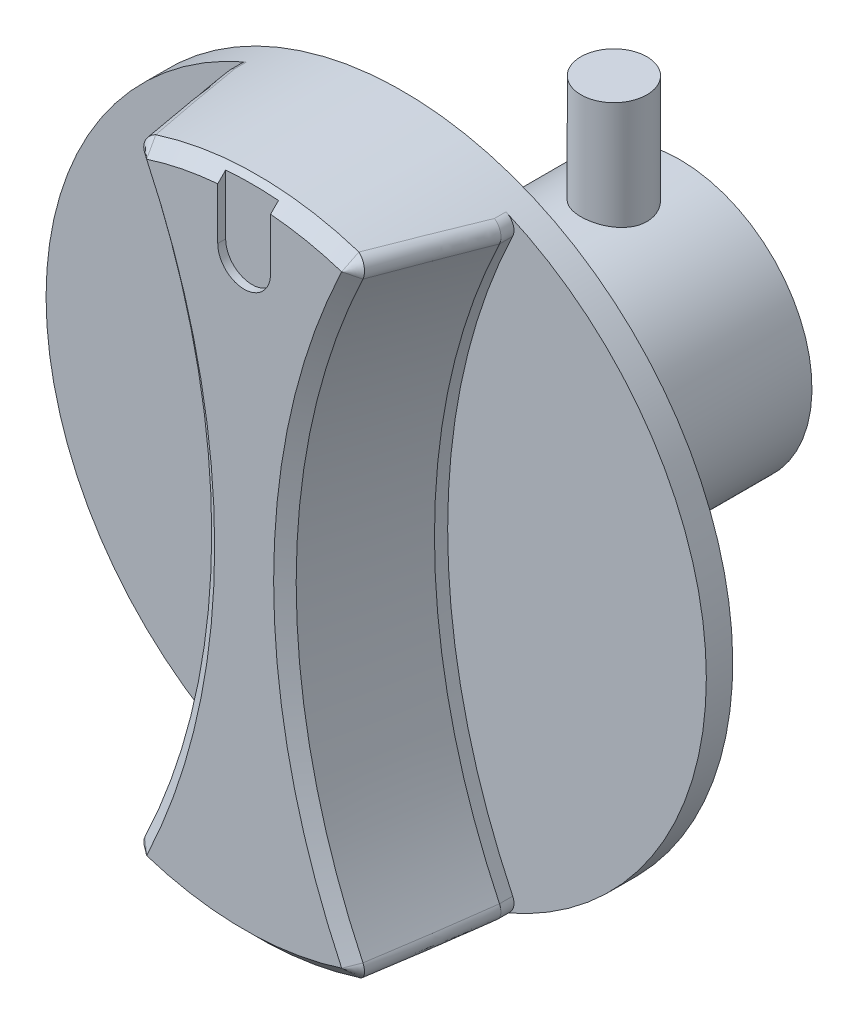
ISO-10303-21;
HEADER;
FILE_DESCRIPTION(('STEP AP214'),'2;1');
FILE_NAME('part.step','',(''),(''),'','','');
FILE_SCHEMA(('AUTOMOTIVE_DESIGN { 1 0 10303 214 1 1 1 1 }'));
ENDSEC;
DATA;
#1=APPLICATION_CONTEXT('core data for automotive mechanical design processes');
#2=APPLICATION_PROTOCOL_DEFINITION('international standard','automotive_design',2000,#1);
#3=PRODUCT_CONTEXT('',#1,'mechanical');
#4=PRODUCT('Part','Part','',(#3));
#5=PRODUCT_RELATED_PRODUCT_CATEGORY('part','',(#4));
#6=PRODUCT_DEFINITION_FORMATION('','',#4);
#7=PRODUCT_DEFINITION_CONTEXT('part definition',#1,'design');
#8=PRODUCT_DEFINITION('design','',#6,#7);
#9=PRODUCT_DEFINITION_SHAPE('','',#8);
#10=(LENGTH_UNIT() NAMED_UNIT(*) SI_UNIT(.MILLI.,.METRE.));
#11=(NAMED_UNIT(*) PLANE_ANGLE_UNIT() SI_UNIT($,.RADIAN.));
#12=(NAMED_UNIT(*) SI_UNIT($,.STERADIAN.) SOLID_ANGLE_UNIT());
#13=UNCERTAINTY_MEASURE_WITH_UNIT(LENGTH_MEASURE(1.E-05),#10,'distance_accuracy_value','');
#14=(GEOMETRIC_REPRESENTATION_CONTEXT(3) GLOBAL_UNCERTAINTY_ASSIGNED_CONTEXT((#13)) GLOBAL_UNIT_ASSIGNED_CONTEXT((#10,
#11,#12)) REPRESENTATION_CONTEXT('',''));
#15=CARTESIAN_POINT('',(0.,0.,0.));
#16=DIRECTION('',(0.,0.,1.));
#17=DIRECTION('',(1.,0.,0.));
#18=AXIS2_PLACEMENT_3D('',#15,#16,#17);
#19=CARTESIAN_POINT('',(0.,-9.,-14.));
#20=DIRECTION('',(0.,1.,0.));
#21=DIRECTION('',(0.0702897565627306,0.,-0.997526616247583));
#22=AXIS2_PLACEMENT_3D('',#19,#20,#21);
#23=CYLINDRICAL_SURFACE('',#22,1.25);
#24=CARTESIAN_POINT('',(0.0878621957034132,4.99922796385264,-15.2469082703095));
#25=CARTESIAN_POINT('',(0.0192638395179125,5.00043247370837,-15.2517401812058));
#26=CARTESIAN_POINT('',(-0.0497792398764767,5.00022067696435,-15.2508993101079));
#27=CARTESIAN_POINT('',(-0.186741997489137,4.99698181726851,-15.2378870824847));
#28=CARTESIAN_POINT('',(-0.254661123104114,4.99395340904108,-15.2257103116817));
#29=CARTESIAN_POINT('',(-0.387362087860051,4.98541561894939,-15.1904449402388));
#30=CARTESIAN_POINT('',(-0.452146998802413,4.97990872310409,-15.1673672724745));
#31=CARTESIAN_POINT('',(-0.576908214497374,4.9670026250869,-15.1110192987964));
#32=CARTESIAN_POINT('',(-0.63688431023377,4.95960334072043,-15.0777485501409));
#33=CARTESIAN_POINT('',(-0.751426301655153,4.94355749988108,-15.0013365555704));
#34=CARTESIAN_POINT('',(-0.805888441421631,4.93489262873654,-14.9580436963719));
#35=CARTESIAN_POINT('',(-0.906882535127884,4.91733633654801,-14.8630591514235));
#36=CARTESIAN_POINT('',(-0.953413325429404,4.90844488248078,-14.8113662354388));
#37=CARTESIAN_POINT('',(-1.03819940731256,4.89122244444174,-14.6997528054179));
#38=CARTESIAN_POINT('',(-1.0762622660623,4.88290698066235,-14.6396834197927));
#39=CARTESIAN_POINT('',(-1.1417307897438,4.86801640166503,-14.513792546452));
#40=CARTESIAN_POINT('',(-1.16913752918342,4.86144111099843,-14.4479716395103));
#41=CARTESIAN_POINT('',(-1.21212725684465,4.85090041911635,-14.3133291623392));
#42=CARTESIAN_POINT('',(-1.22786090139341,4.84690185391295,-14.2445583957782));
#43=CARTESIAN_POINT('',(-1.24754502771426,4.8418733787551,-14.1052493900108));
#44=CARTESIAN_POINT('',(-1.25149788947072,4.84084286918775,-14.0347115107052));
#45=CARTESIAN_POINT('',(-1.24754135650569,4.84186351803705,-13.8959590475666));
#46=CARTESIAN_POINT('',(-1.23995782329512,4.84383002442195,-13.8277342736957));
#47=CARTESIAN_POINT('',(-1.21378409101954,4.85045440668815,-13.6935689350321));
#48=CARTESIAN_POINT('',(-1.19519360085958,4.85511235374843,-13.6276284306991));
#49=CARTESIAN_POINT('',(-1.14755656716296,4.86659128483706,-13.4997194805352));
#50=CARTESIAN_POINT('',(-1.11849196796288,4.87341600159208,-13.4377581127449));
#51=CARTESIAN_POINT('',(-1.05075530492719,4.88846733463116,-13.3195165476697));
#52=CARTESIAN_POINT('',(-1.01208162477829,4.89669418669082,-13.2632373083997));
#53=CARTESIAN_POINT('',(-0.924928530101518,4.91391195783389,-13.1562579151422));
#54=CARTESIAN_POINT('',(-0.876202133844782,4.92291792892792,-13.1057612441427));
#55=CARTESIAN_POINT('',(-0.770951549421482,4.94049348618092,-13.013578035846));
#56=CARTESIAN_POINT('',(-0.714426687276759,4.94906303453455,-12.971892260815));
#57=CARTESIAN_POINT('',(-0.594367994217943,4.96491985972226,-12.8980708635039));
#58=CARTESIAN_POINT('',(-0.530761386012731,4.97219134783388,-12.8660499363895));
#59=CARTESIAN_POINT('',(-0.398851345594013,4.98450590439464,-12.8132130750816));
#60=CARTESIAN_POINT('',(-0.330548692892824,4.98954934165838,-12.7923952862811));
#61=CARTESIAN_POINT('',(-0.19277748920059,4.99674787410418,-12.7629918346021));
#62=CARTESIAN_POINT('',(-0.123367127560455,4.99896373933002,-12.7541485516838));
#63=CARTESIAN_POINT('',(0.015983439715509,5.00045968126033,-12.7481587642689));
#64=CARTESIAN_POINT('',(0.0859235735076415,4.99974014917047,-12.7510107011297));
#65=CARTESIAN_POINT('',(0.222825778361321,4.99549250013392,-12.7681273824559));
#66=CARTESIAN_POINT('',(0.289819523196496,4.99202271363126,-12.7821551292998));
#67=CARTESIAN_POINT('',(0.420475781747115,4.98271941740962,-12.8208716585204));
#68=CARTESIAN_POINT('',(0.484138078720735,4.9768857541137,-12.8455611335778));
#69=CARTESIAN_POINT('',(0.607146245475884,4.96339085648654,-12.905194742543));
#70=CARTESIAN_POINT('',(0.666435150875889,4.95570969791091,-12.9402517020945));
#71=CARTESIAN_POINT('',(0.77838456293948,4.93936463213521,-13.0195287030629));
#72=CARTESIAN_POINT('',(0.831043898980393,4.93070055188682,-13.0637503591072));
#73=CARTESIAN_POINT('',(0.929719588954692,4.91306467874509,-13.1615059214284));
#74=CARTESIAN_POINT('',(0.975520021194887,4.90409086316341,-13.2152576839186));
#75=CARTESIAN_POINT('',(1.05749188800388,4.88707161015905,-13.3297981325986));
#76=CARTESIAN_POINT('',(1.09366307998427,4.87902619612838,-13.3905869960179));
#77=CARTESIAN_POINT('',(1.15538262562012,4.86478175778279,-13.5177200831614));
#78=CARTESIAN_POINT('',(1.18090695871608,4.85858691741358,-13.5840764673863));
#79=CARTESIAN_POINT('',(1.22037386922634,4.84882521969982,-13.7203299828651));
#80=CARTESIAN_POINT('',(1.23431897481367,4.84525778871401,-13.7902263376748));
#81=CARTESIAN_POINT('',(1.24992404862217,4.84125534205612,-13.9295231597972));
#82=CARTESIAN_POINT('',(1.25190985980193,4.84073725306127,-13.998884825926));
#83=CARTESIAN_POINT('',(1.24439791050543,4.84267369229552,-14.1369368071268));
#84=CARTESIAN_POINT('',(1.23490100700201,4.84512799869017,-14.2056271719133));
#85=CARTESIAN_POINT('',(1.20496405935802,4.85265827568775,-14.3394043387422));
#86=CARTESIAN_POINT('',(1.18467918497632,4.85769703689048,-14.4045281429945));
#87=CARTESIAN_POINT('',(1.13389734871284,4.86980021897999,-14.5304600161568));
#88=CARTESIAN_POINT('',(1.10339922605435,4.87686487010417,-14.5912675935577));
#89=CARTESIAN_POINT('',(1.03229650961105,4.89241371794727,-14.7082730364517));
#90=CARTESIAN_POINT('',(0.991489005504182,4.90092513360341,-14.7643439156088));
#91=CARTESIAN_POINT('',(0.90120926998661,4.91832602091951,-14.8689635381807));
#92=CARTESIAN_POINT('',(0.851734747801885,4.92721559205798,-14.9175102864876));
#93=CARTESIAN_POINT('',(0.744121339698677,4.94462541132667,-15.0068717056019));
#94=CARTESIAN_POINT('',(0.685804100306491,4.9531318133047,-15.0474745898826));
#95=CARTESIAN_POINT('',(0.563003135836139,4.96858580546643,-15.118277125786));
#96=CARTESIAN_POINT('',(0.498523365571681,4.97553438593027,-15.1484833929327));
#97=CARTESIAN_POINT('',(0.376752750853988,4.98609314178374,-15.1933195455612));
#98=CARTESIAN_POINT('',(0.320146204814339,4.9900727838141,-15.2097394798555));
#99=CARTESIAN_POINT('',(0.20508921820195,4.99612407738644,-15.2344634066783));
#100=CARTESIAN_POINT('',(0.146638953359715,4.99819591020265,-15.2427681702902));
#101=CARTESIAN_POINT('',(0.0878621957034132,4.99922796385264,-15.2469082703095));
#102=B_SPLINE_CURVE_WITH_KNOTS('',3,(#24,#25,#26,#27,#28,#29,#30,#31,#32,#33,#34,#35,#36,#37,
#38,#39,#40,#41,#42,#43,#44,#45,#46,#47,#48,#49,#50,#51,#52,#53,#54,#55,#56,#57,#58,#59,#60,#61,
#62,#63,#64,#65,#66,#67,#68,#69,#70,#71,#72,#73,#74,#75,#76,#77,#78,#79,#80,#81,#82,#83,#84,#85,
#86,#87,#88,#89,#90,#91,#92,#93,#94,#95,#96,#97,#98,#99,#100,#101),.UNSPECIFIED.,.T.,.F.,(4,2,2,
2,2,2,2,2,2,2,2,2,2,2,2,2,2,2,2,2,2,2,2,2,2,2,2,2,2,2,2,2,2,2,2,2,2,2,4),(0.,0.206122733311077,
0.412343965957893,0.618358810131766,0.824382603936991,1.0337543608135,1.24315680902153,
1.45691834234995,1.67065831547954,1.88158927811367,2.09247762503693,2.29751874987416,
2.50256529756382,2.70796701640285,2.91340330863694,3.12466566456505,3.33594629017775,
3.54964368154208,3.76330568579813,3.9722937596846,4.18125398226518,4.38589723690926,
4.59055378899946,4.79752508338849,5.00453287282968,5.21708995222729,5.4296523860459,
5.64269182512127,5.85568473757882,6.06284719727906,6.26999419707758,6.47423920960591,
6.67850744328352,6.88716091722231,7.09586962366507,7.30955108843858,7.52309633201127,
7.69972414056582,7.87633516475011),.UNSPECIFIED.);
#103=CARTESIAN_POINT('',(0.0878621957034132,4.99922796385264,-15.2469082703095));
#104=VERTEX_POINT('',#103);
#105=EDGE_CURVE('E28',#104,#104,#102,.T.);
#106=ORIENTED_EDGE('',*,*,#105,.T.);
#107=EDGE_LOOP('',(#106));
#108=FACE_BOUND('',#107,.T.);
#109=CARTESIAN_POINT('',(0.,9.,-14.));
#110=DIRECTION('',(0.,1.,0.));
#111=DIRECTION('',(0.,0.,1.));
#112=AXIS2_PLACEMENT_3D('',#109,#110,#111);
#113=CIRCLE('',#112,1.25);
#114=CARTESIAN_POINT('',(0.,9.,-12.75));
#115=VERTEX_POINT('',#114);
#116=EDGE_CURVE('E483',#115,#115,#113,.T.);
#117=ORIENTED_EDGE('',*,*,#116,.F.);
#118=EDGE_LOOP('',(#117));
#119=FACE_BOUND('',#118,.T.);
#120=ADVANCED_FACE('F14',(#108,#119),#23,.T.);
#121=CARTESIAN_POINT('',(0.,-9.,-14.));
#122=DIRECTION('',(0.,-1.,0.));
#123=DIRECTION('',(0.,0.,-1.));
#124=AXIS2_PLACEMENT_3D('',#121,#122,#123);
#125=CIRCLE('',#124,1.25);
#126=CARTESIAN_POINT('',(0.,-9.,-15.25));
#127=VERTEX_POINT('',#126);
#128=EDGE_CURVE('E487',#127,#127,#125,.T.);
#129=ORIENTED_EDGE('',*,*,#128,.F.);
#130=EDGE_LOOP('',(#129));
#131=FACE_BOUND('',#130,.T.);
#132=CARTESIAN_POINT('',(0.0878621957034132,-4.99922796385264,-15.2469082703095));
#133=CARTESIAN_POINT('',(0.1570836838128,-4.99801018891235,-15.242028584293));
#134=CARTESIAN_POINT('',(0.225895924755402,-4.9953495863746,-15.2313694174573));
#135=CARTESIAN_POINT('',(0.360687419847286,-4.98743158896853,-15.1988404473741));
#136=CARTESIAN_POINT('',(0.426664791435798,-4.98217249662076,-15.1769633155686));
#137=CARTESIAN_POINT('',(0.553845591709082,-4.96964137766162,-15.1227321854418));
#138=CARTESIAN_POINT('',(0.615055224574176,-4.96237202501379,-15.0903920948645));
#139=CARTESIAN_POINT('',(0.731197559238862,-4.94659378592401,-15.0161699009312));
#140=CARTESIAN_POINT('',(0.786130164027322,-4.93808488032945,-14.9742876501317));
#141=CARTESIAN_POINT('',(0.889325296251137,-4.92055854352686,-14.8812043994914));
#142=CARTESIAN_POINT('',(0.937438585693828,-4.91153446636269,-14.8298391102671));
#143=CARTESIAN_POINT('',(1.02442857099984,-4.89413110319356,-14.7197018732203));
#144=CARTESIAN_POINT('',(1.06330467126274,-4.88575185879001,-14.6609294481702));
#145=CARTESIAN_POINT('',(1.13096482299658,-4.87053747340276,-14.5370612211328));
#146=CARTESIAN_POINT('',(1.15967112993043,-4.86371436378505,-14.4719213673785));
#147=CARTESIAN_POINT('',(1.20565975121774,-4.85251998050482,-14.3375289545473));
#148=CARTESIAN_POINT('',(1.22294436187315,-4.84814821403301,-14.2682772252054));
#149=CARTESIAN_POINT('',(1.24520885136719,-4.84247713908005,-14.1294952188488));
#150=CARTESIAN_POINT('',(1.25048798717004,-4.84110314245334,-14.0600159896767));
#151=CARTESIAN_POINT('',(1.24944111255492,-4.84137353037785,-13.9211559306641));
#152=CARTESIAN_POINT('',(1.24311639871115,-4.84301757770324,-13.8517750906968));
#153=CARTESIAN_POINT('',(1.21931063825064,-4.84906441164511,-13.7164209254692));
#154=CARTESIAN_POINT('',(1.20203872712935,-4.85341545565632,-13.6504082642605));
#155=CARTESIAN_POINT('',(1.15708476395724,-4.86432792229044,-13.5222246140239));
#156=CARTESIAN_POINT('',(1.12940157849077,-4.87088958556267,-13.4600540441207));
#157=CARTESIAN_POINT('',(1.06385807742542,-4.88562681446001,-13.3401070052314));
#158=CARTESIAN_POINT('',(1.02582771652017,-4.89382867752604,-13.2824267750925));
#159=CARTESIAN_POINT('',(0.940858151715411,-4.91087155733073,-13.1741527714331));
#160=CARTESIAN_POINT('',(0.893917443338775,-4.91971268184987,-13.1235601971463));
#161=CARTESIAN_POINT('',(0.790991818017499,-4.93731944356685,-13.029527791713));
#162=CARTESIAN_POINT('',(0.734801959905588,-4.94607701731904,-12.9863103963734));
#163=CARTESIAN_POINT('',(0.615796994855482,-4.96229734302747,-12.9099114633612));
#164=CARTESIAN_POINT('',(0.552982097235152,-4.96976013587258,-12.8767296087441));
#165=CARTESIAN_POINT('',(0.42276282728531,-4.9825221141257,-12.8215488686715));
#166=CARTESIAN_POINT('',(0.355381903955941,-4.98783150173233,-12.7994971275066));
#167=CARTESIAN_POINT('',(0.217715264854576,-4.99573297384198,-12.767077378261));
#168=CARTESIAN_POINT('',(0.14743012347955,-4.9983255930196,-12.7567070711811));
#169=CARTESIAN_POINT('',(0.00799106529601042,-5.00046672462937,-12.7481280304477));
#170=CARTESIAN_POINT('',(-0.0611419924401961,-5.00009571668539,-12.7495977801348));
#171=CARTESIAN_POINT('',(-0.198147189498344,-4.99654217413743,-12.7638847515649));
#172=CARTESIAN_POINT('',(-0.266019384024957,-4.99335976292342,-12.7767014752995));
#173=CARTESIAN_POINT('',(-0.398061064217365,-4.98456574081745,-12.8131123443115));
#174=CARTESIAN_POINT('',(-0.462255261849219,-4.97897323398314,-12.8366218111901));
#175=CARTESIAN_POINT('',(-0.585814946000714,-4.96595254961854,-12.8936758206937));
#176=CARTESIAN_POINT('',(-0.645179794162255,-4.95852412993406,-12.927221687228));
#177=CARTESIAN_POINT('',(-0.758865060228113,-4.9424182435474,-13.0042860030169));
#178=CARTESIAN_POINT('',(-0.813039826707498,-4.93371618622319,-13.0480141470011));
#179=CARTESIAN_POINT('',(-0.913388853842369,-4.9161286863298,-13.1438254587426));
#180=CARTESIAN_POINT('',(-0.959561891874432,-4.90724321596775,-13.1959099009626));
#181=CARTESIAN_POINT('',(-1.0435326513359,-4.89008362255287,-13.3082244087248));
#182=CARTESIAN_POINT('',(-1.08114244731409,-4.88182546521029,-13.3685977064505));
#183=CARTESIAN_POINT('',(-1.14565616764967,-4.86709077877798,-13.4950185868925));
#184=CARTESIAN_POINT('',(-1.17256130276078,-4.86061404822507,-13.5610655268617));
#185=CARTESIAN_POINT('',(-1.2145023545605,-4.85030388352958,-13.6960158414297));
#186=CARTESIAN_POINT('',(-1.22969816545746,-4.84643493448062,-13.764866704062));
#187=CARTESIAN_POINT('',(-1.24830686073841,-4.84167587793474,-13.904238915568));
#188=CARTESIAN_POINT('',(-1.25172204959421,-4.84078518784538,-13.9747599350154));
#189=CARTESIAN_POINT('',(-1.24672367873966,-4.84207436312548,-14.1134023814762));
#190=CARTESIAN_POINT('',(-1.2386326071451,-4.84417051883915,-14.1815364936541));
#191=CARTESIAN_POINT('',(-1.21147294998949,-4.8510335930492,-14.3154371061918));
#192=CARTESIAN_POINT('',(-1.19240403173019,-4.85580059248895,-14.3812035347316));
#193=CARTESIAN_POINT('',(-1.14382929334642,-4.86747117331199,-14.5087480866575));
#194=CARTESIAN_POINT('',(-1.11429624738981,-4.8743803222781,-14.5705153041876));
#195=CARTESIAN_POINT('',(-1.0456567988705,-4.88956369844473,-14.6882947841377));
#196=CARTESIAN_POINT('',(-1.00654891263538,-4.89783813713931,-14.7443061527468));
#197=CARTESIAN_POINT('',(-0.9185550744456,-4.91511126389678,-14.8506792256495));
#198=CARTESIAN_POINT('',(-0.869422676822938,-4.9241238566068,-14.9008349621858));
#199=CARTESIAN_POINT('',(-0.763406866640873,-4.94166894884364,-14.992275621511));
#200=CARTESIAN_POINT('',(-0.706521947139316,-4.95020135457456,-15.0335588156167));
#201=CARTESIAN_POINT('',(-0.585840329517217,-4.96593701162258,-15.1064879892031));
#202=CARTESIAN_POINT('',(-0.521975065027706,-4.9731247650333,-15.1380240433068));
#203=CARTESIAN_POINT('',(-0.389658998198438,-4.98523470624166,-15.1898340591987));
#204=CARTESIAN_POINT('',(-0.321211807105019,-4.99015865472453,-15.2101167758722));
#205=CARTESIAN_POINT('',(-0.195836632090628,-4.99647511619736,-15.2358726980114));
#206=CARTESIAN_POINT('',(-0.139368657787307,-4.99837948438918,-15.243507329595));
#207=CARTESIAN_POINT('',(-0.0258880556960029,-5.00025493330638,-15.2510247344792));
#208=CARTESIAN_POINT('',(0.0311245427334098,-5.00022611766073,-15.2509079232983));
#209=CARTESIAN_POINT('',(0.0878621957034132,-4.99922796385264,-15.2469082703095));
#210=B_SPLINE_CURVE_WITH_KNOTS('',3,(#132,#133,#134,#135,#136,#137,#138,#139,#140,#141,#142,
#143,#144,#145,#146,#147,#148,#149,#150,#151,#152,#153,#154,#155,#156,#157,#158,#159,#160,#161,
#162,#163,#164,#165,#166,#167,#168,#169,#170,#171,#172,#173,#174,#175,#176,#177,#178,#179,#180,
#181,#182,#183,#184,#185,#186,#187,#188,#189,#190,#191,#192,#193,#194,#195,#196,#197,#198,#199,
#200,#201,#202,#203,#204,#205,#206,#207,#208,#209),.UNSPECIFIED.,.T.,.F.,(4,2,2,2,2,2,2,2,2,2,2,
2,2,2,2,2,2,2,2,2,2,2,2,2,2,2,2,2,2,2,2,2,2,2,2,2,2,2,4),(0.,0.20800176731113,0.416139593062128,
0.624001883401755,0.831867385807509,1.04374572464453,1.25563772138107,1.46911627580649,
1.68255189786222,1.89060606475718,2.09863698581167,2.30280876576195,2.50700277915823,
2.71477958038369,2.92259149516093,3.13585454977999,3.34911086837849,3.56134469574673,
3.77353674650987,3.97998654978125,4.18642729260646,4.3912609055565,4.5961215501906,
4.80564715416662,5.01520474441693,5.22899342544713,5.44275791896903,5.65354896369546,
5.86429877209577,6.06925693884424,6.27422131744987,6.4797229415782,6.68525642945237,
6.89663499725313,7.10805471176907,7.3217783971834,7.53533557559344,7.7058341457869,
7.876323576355),.UNSPECIFIED.);
#211=CARTESIAN_POINT('',(0.0878621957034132,-4.99922796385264,-15.2469082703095));
#212=VERTEX_POINT('',#211);
#213=EDGE_CURVE('E9',#212,#212,#210,.T.);
#214=ORIENTED_EDGE('',*,*,#213,.T.);
#215=EDGE_LOOP('',(#214));
#216=FACE_BOUND('',#215,.T.);
#217=ADVANCED_FACE('F369',(#131,#216),#23,.T.);
#218=CARTESIAN_POINT('',(0.,10.,-0.3));
#219=DIRECTION('',(0.,0.,1.));
#220=DIRECTION('',(0.,-1.,0.));
#221=AXIS2_PLACEMENT_3D('',#218,#219,#220);
#222=CYLINDRICAL_SURFACE('',#221,1.);
#223=CARTESIAN_POINT('',(0.,10.,0.));
#224=DIRECTION('',(0.,0.,1.));
#225=DIRECTION('',(0.,1.,0.));
#226=AXIS2_PLACEMENT_3D('',#223,#224,#225);
#227=CIRCLE('',#226,1.);
#228=CARTESIAN_POINT('',(-1.,10.,0.));
#229=VERTEX_POINT('',#228);
#230=CARTESIAN_POINT('',(1.,10.,0.));
#231=VERTEX_POINT('',#230);
#232=EDGE_CURVE('E168',#229,#231,#227,.T.);
#233=ORIENTED_EDGE('',*,*,#232,.T.);
#234=DIRECTION('',(0.,0.,1.));
#235=VECTOR('',#234,1.);
#236=CARTESIAN_POINT('',(1.,10.,-0.3));
#237=LINE('',#236,#235);
#238=CARTESIAN_POINT('',(1.,10.,-0.3));
#239=VERTEX_POINT('',#238);
#240=EDGE_CURVE('E161',#239,#231,#237,.T.);
#241=ORIENTED_EDGE('',*,*,#240,.F.);
#242=CARTESIAN_POINT('',(0.,10.,-0.3));
#243=DIRECTION('',(0.,0.,1.));
#244=DIRECTION('',(0.,1.,0.));
#245=AXIS2_PLACEMENT_3D('',#242,#243,#244);
#246=CIRCLE('',#245,1.);
#247=CARTESIAN_POINT('',(-1.,10.,-0.3));
#248=VERTEX_POINT('',#247);
#249=EDGE_CURVE('E166',#248,#239,#246,.T.);
#250=ORIENTED_EDGE('',*,*,#249,.F.);
#251=DIRECTION('',(0.,0.,1.));
#252=VECTOR('',#251,1.);
#253=CARTESIAN_POINT('',(-1.,10.,-0.3));
#254=LINE('',#253,#252);
#255=EDGE_CURVE('E172',#248,#229,#254,.T.);
#256=ORIENTED_EDGE('',*,*,#255,.T.);
#257=EDGE_LOOP('',(#233,#241,#250,#256));
#258=FACE_BOUND('',#257,.T.);
#259=ADVANCED_FACE('F163',(#258),#222,.F.);
#260=CARTESIAN_POINT('',(27.70577136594,0.,-0.370590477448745));
#261=DIRECTION('',(0.,0.,1.));
#262=DIRECTION('',(0.,-1.,0.));
#263=AXIS2_PLACEMENT_3D('',#260,#261,#262);
#264=CONICAL_SURFACE('',#263,26.106471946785,0.916297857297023);
#265=CARTESIAN_POINT('',(4.12875170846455,-11.2103533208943,-0.370590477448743));
#266=CARTESIAN_POINT('',(3.69258300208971,-11.4177419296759,0.));
#267=B_SPLINE_CURVE_WITH_KNOTS('',1,(#265,#266),.UNSPECIFIED.,.F.,.F.,(2,2),(0.,1.),.UNSPECIFIED.);
#268=CARTESIAN_POINT('',(3.69258300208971,-11.4177419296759,0.));
#269=VERTEX_POINT('',#268);
#270=CARTESIAN_POINT('',(4.12875170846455,-11.2103533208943,-0.370590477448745));
#271=VERTEX_POINT('',#270);
#272=EDGE_CURVE('E951',#269,#271,#267,.F.);
#273=ORIENTED_EDGE('',*,*,#272,.T.);
#274=CARTESIAN_POINT('',(27.70577136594,0.,-0.370590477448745));
#275=DIRECTION('',(0.,0.,1.));
#276=DIRECTION('',(0.,-1.,0.));
#277=AXIS2_PLACEMENT_3D('',#274,#275,#276);
#278=CIRCLE('',#277,26.106471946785);
#279=CARTESIAN_POINT('',(4.12875170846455,11.2103533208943,-0.370590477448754));
#280=VERTEX_POINT('',#279);
#281=EDGE_CURVE('E36',#280,#271,#278,.T.);
#282=ORIENTED_EDGE('',*,*,#281,.F.);
#283=CARTESIAN_POINT('',(3.69258300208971,11.4177419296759,0.));
#284=CARTESIAN_POINT('',(4.1287517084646,11.2103533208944,-0.370590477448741));
#285=B_SPLINE_CURVE_WITH_KNOTS('',1,(#283,#284),.UNSPECIFIED.,.F.,.F.,(2,2),(0.,1.),.UNSPECIFIED.);
#286=CARTESIAN_POINT('',(3.69258300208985,11.4177419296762,0.));
#287=VERTEX_POINT('',#286);
#288=EDGE_CURVE('E884',#287,#280,#285,.T.);
#289=ORIENTED_EDGE('',*,*,#288,.F.);
#290=CARTESIAN_POINT('',(27.70577136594,0.,0.));
#291=DIRECTION('',(0.,0.,1.));
#292=DIRECTION('',(0.,-1.,0.));
#293=AXIS2_PLACEMENT_3D('',#290,#291,#292);
#294=CIRCLE('',#293,26.5894348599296);
#295=EDGE_CURVE('E1010',#269,#287,#294,.F.);
#296=ORIENTED_EDGE('',*,*,#295,.F.);
#297=EDGE_LOOP('',(#273,#282,#289,#296));
#298=FACE_BOUND('',#297,.T.);
#299=ADVANCED_FACE('F368',(#298),#264,.F.);
#300=CARTESIAN_POINT('',(-27.70577136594,0.,0.));
#301=DIRECTION('',(0.,0.,1.));
#302=DIRECTION('',(0.,-1.,0.));
#303=AXIS2_PLACEMENT_3D('',#300,#301,#302);
#304=CONICAL_SURFACE('',#303,26.5894348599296,0.916297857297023);
#305=CARTESIAN_POINT('',(-3.69258300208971,-11.4177419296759,0.));
#306=CARTESIAN_POINT('',(-4.12875170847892,-11.2103533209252,-0.370590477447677));
#307=B_SPLINE_CURVE_WITH_KNOTS('',1,(#305,#306),.UNSPECIFIED.,.F.,.F.,(2,2),(0.,1.),.UNSPECIFIED.);
#308=CARTESIAN_POINT('',(-4.12875170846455,-11.2103533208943,-0.370590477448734));
#309=VERTEX_POINT('',#308);
#310=CARTESIAN_POINT('',(-3.69258300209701,-11.4177419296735,0.));
#311=VERTEX_POINT('',#310);
#312=EDGE_CURVE('E1137',#309,#311,#307,.F.);
#313=ORIENTED_EDGE('',*,*,#312,.T.);
#314=CARTESIAN_POINT('',(-27.70577136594,0.,0.));
#315=DIRECTION('',(0.,0.,1.));
#316=DIRECTION('',(0.,-1.,0.));
#317=AXIS2_PLACEMENT_3D('',#314,#315,#316);
#318=CIRCLE('',#317,26.5894348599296);
#319=CARTESIAN_POINT('',(-3.6925830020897,11.4177419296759,0.));
#320=VERTEX_POINT('',#319);
#321=EDGE_CURVE('E1008',#320,#311,#318,.F.);
#322=ORIENTED_EDGE('',*,*,#321,.F.);
#323=CARTESIAN_POINT('',(-4.12875170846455,11.2103533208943,-0.370590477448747));
#324=CARTESIAN_POINT('',(-3.69258300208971,11.4177419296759,0.));
#325=B_SPLINE_CURVE_WITH_KNOTS('',1,(#323,#324),.UNSPECIFIED.,.F.,.F.,(2,2),(0.,1.),.UNSPECIFIED.);
#326=CARTESIAN_POINT('',(-4.12875170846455,11.2103533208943,-0.370590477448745));
#327=VERTEX_POINT('',#326);
#328=EDGE_CURVE('E778',#327,#320,#325,.T.);
#329=ORIENTED_EDGE('',*,*,#328,.F.);
#330=CARTESIAN_POINT('',(-27.70577136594,0.,-0.370590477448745));
#331=DIRECTION('',(0.,0.,1.));
#332=DIRECTION('',(0.,-1.,0.));
#333=AXIS2_PLACEMENT_3D('',#330,#331,#332);
#334=CIRCLE('',#333,26.106471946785);
#335=EDGE_CURVE('E1025',#309,#327,#334,.T.);
#336=ORIENTED_EDGE('',*,*,#335,.F.);
#337=EDGE_LOOP('',(#313,#322,#329,#336));
#338=FACE_BOUND('',#337,.T.);
#339=ADVANCED_FACE('F336',(#338),#304,.F.);
#340=CARTESIAN_POINT('',(-27.70577136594,0.,-6.));
#341=DIRECTION('',(0.,0.,-1.));
#342=DIRECTION('',(0.,1.,0.));
#343=AXIS2_PLACEMENT_3D('',#340,#341,#342);
#344=CYLINDRICAL_SURFACE('',#343,25.);
#345=CARTESIAN_POINT('',(-27.70577136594,0.,-5.));
#346=DIRECTION('',(0.,0.,-1.));
#347=DIRECTION('',(0.,1.,0.));
#348=AXIS2_PLACEMENT_3D('',#345,#346,#347);
#349=CIRCLE('',#348,25.);
#350=CARTESIAN_POINT('',(-5.16746864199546,10.8178052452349,-5.));
#351=VERTEX_POINT('',#350);
#352=CARTESIAN_POINT('',(-5.16746864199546,-10.8178052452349,-5.));
#353=VERTEX_POINT('',#352);
#354=EDGE_CURVE('E214',#351,#353,#349,.T.);
#355=ORIENTED_EDGE('',*,*,#354,.T.);
#356=DIRECTION('',(0.,0.,-1.));
#357=VECTOR('',#356,1.);
#358=CARTESIAN_POINT('',(-5.16746864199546,-10.8178052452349,-6.));
#359=LINE('',#358,#357);
#360=CARTESIAN_POINT('',(-5.16746864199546,-10.8178052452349,-4.5));
#361=VERTEX_POINT('',#360);
#362=EDGE_CURVE('E1081',#353,#361,#359,.F.);
#363=ORIENTED_EDGE('',*,*,#362,.T.);
#364=CARTESIAN_POINT('',(-27.70577136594,0.,-4.5));
#365=DIRECTION('',(0.,0.,-1.));
#366=DIRECTION('',(0.,1.,0.));
#367=AXIS2_PLACEMENT_3D('',#364,#365,#366);
#368=CIRCLE('',#367,25.);
#369=CARTESIAN_POINT('',(-5.16746864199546,10.8178052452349,-4.5));
#370=VERTEX_POINT('',#369);
#371=EDGE_CURVE('E212',#370,#361,#368,.T.);
#372=ORIENTED_EDGE('',*,*,#371,.F.);
#373=DIRECTION('',(0.,0.,-1.));
#374=VECTOR('',#373,1.);
#375=CARTESIAN_POINT('',(-5.16746864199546,10.8178052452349,-6.));
#376=LINE('',#375,#374);
#377=EDGE_CURVE('E1045',#370,#351,#376,.T.);
#378=ORIENTED_EDGE('',*,*,#377,.T.);
#379=EDGE_LOOP('',(#355,#363,#372,#378));
#380=FACE_BOUND('',#379,.T.);
#381=ADVANCED_FACE('F466',(#380),#344,.F.);
#382=CARTESIAN_POINT('',(-3.84644062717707,-11.8934811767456,-0.499999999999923));
#383=CARTESIAN_POINT('',(-3.88766707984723,-11.8801482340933,-0.488289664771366));
#384=CARTESIAN_POINT('',(-3.93034938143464,-11.8603581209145,-0.47566794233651));
#385=CARTESIAN_POINT('',(-4.01723598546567,-11.7984634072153,-0.448177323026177));
#386=CARTESIAN_POINT('',(-4.06206486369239,-11.7558477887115,-0.433105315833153));
#387=CARTESIAN_POINT('',(-4.13830695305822,-11.635273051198,-0.403471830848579));
#388=CARTESIAN_POINT('',(-4.16861696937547,-11.5555042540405,-0.389043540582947));
#389=CARTESIAN_POINT('',(-4.17881824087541,-11.423287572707,-0.375424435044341));
#390=CARTESIAN_POINT('',(-4.1763839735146,-11.377656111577,-0.372255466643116));
#391=CARTESIAN_POINT('',(-4.16008298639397,-11.2900184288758,-0.369158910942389));
#392=CARTESIAN_POINT('',(-4.14626666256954,-11.2480443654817,-0.369221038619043));
#393=CARTESIAN_POINT('',(-4.12875170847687,-11.2103533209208,-0.370590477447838));
#394=CARTESIAN_POINT('',(-3.69258300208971,-11.4177419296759,0.));
#395=CARTESIAN_POINT('',(-3.69258300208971,-11.4177419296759,0.));
#396=CARTESIAN_POINT('',(-3.69258300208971,-11.4177419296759,0.));
#397=CARTESIAN_POINT('',(-3.69258300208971,-11.4177419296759,0.));
#398=CARTESIAN_POINT('',(-3.69258300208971,-11.4177419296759,0.));
#399=CARTESIAN_POINT('',(-3.69258300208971,-11.4177419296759,0.));
#400=CARTESIAN_POINT('',(-3.69258300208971,-11.4177419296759,0.));
#401=CARTESIAN_POINT('',(-3.69258300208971,-11.4177419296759,0.));
#402=CARTESIAN_POINT('',(-3.69258300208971,-11.4177419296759,0.));
#403=CARTESIAN_POINT('',(-3.69258300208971,-11.4177419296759,0.));
#404=CARTESIAN_POINT('',(-3.69258300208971,-11.4177419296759,0.));
#405=CARTESIAN_POINT('',(-3.69258300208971,-11.4177419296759,0.));
#406=B_SPLINE_SURFACE_WITH_KNOTS('',1,3,((#382,#383,#384,#385,#386,#387,#388,#389,#390,#391,
#392,#393),(#394,#395,#396,#397,#398,#399,#400,#401,#402,#403,#404,#405)),.UNSPECIFIED.,.F.,.F.,
.F.,(2,2),(4,2,2,2,2,4),(0.,1.),(3.36641043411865,3.73471010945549,4.10300978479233,
4.47130946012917,4.65545929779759,4.83960913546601),.UNSPECIFIED.);
#407=CARTESIAN_POINT('',(-4.12875170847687,-11.2103533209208,-0.370590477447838));
#408=CARTESIAN_POINT('',(-4.14626666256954,-11.2480443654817,-0.369221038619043));
#409=CARTESIAN_POINT('',(-4.16008298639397,-11.2900184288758,-0.369158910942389));
#410=CARTESIAN_POINT('',(-4.1763839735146,-11.377656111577,-0.372255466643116));
#411=CARTESIAN_POINT('',(-4.17881824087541,-11.423287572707,-0.375424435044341));
#412=CARTESIAN_POINT('',(-4.16861696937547,-11.5555042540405,-0.389043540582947));
#413=CARTESIAN_POINT('',(-4.13830695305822,-11.635273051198,-0.403471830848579));
#414=CARTESIAN_POINT('',(-4.06206486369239,-11.7558477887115,-0.433105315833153));
#415=CARTESIAN_POINT('',(-4.01723598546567,-11.7984634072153,-0.448177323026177));
#416=CARTESIAN_POINT('',(-3.93034938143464,-11.8603581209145,-0.47566794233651));
#417=CARTESIAN_POINT('',(-3.88766707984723,-11.8801482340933,-0.488289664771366));
#418=CARTESIAN_POINT('',(-3.84644062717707,-11.8934811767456,-0.499999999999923));
#419=B_SPLINE_CURVE_WITH_KNOTS('',3,(#407,#408,#409,#410,#411,#412,#413,#414,#415,#416,#417,
#418),.UNSPECIFIED.,.F.,.F.,(4,2,2,2,2,4),(3.36641043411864,3.55056027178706,3.73471010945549,
4.10300978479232,4.47130946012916,4.83960913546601),.UNSPECIFIED.);
#420=CARTESIAN_POINT('',(-3.84644062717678,-11.8934811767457,-0.5));
#421=VERTEX_POINT('',#420);
#422=EDGE_CURVE('E482',#421,#309,#419,.F.);
#423=CARTESIAN_POINT('',(-3.84644062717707,-11.8934811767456,-0.499999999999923));
#424=CARTESIAN_POINT('',(-3.69258300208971,-11.4177419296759,0.));
#425=B_SPLINE_CURVE_WITH_KNOTS('',1,(#423,#424),.UNSPECIFIED.,.F.,.F.,(2,2),(0.,1.),.UNSPECIFIED.);
#426=EDGE_CURVE('E939',#421,#311,#425,.T.);
#427=ORIENTED_EDGE('',*,*,#422,.F.);
#428=ORIENTED_EDGE('',*,*,#426,.T.);
#429=ORIENTED_EDGE('',*,*,#312,.F.);
#430=EDGE_LOOP('',(#427,#428,#429));
#431=FACE_BOUND('',#430,.T.);
#432=ADVANCED_FACE('F569',(#431),#406,.T.);
#433=CARTESIAN_POINT('',(4.12875170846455,-11.2103533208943,-0.370590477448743));
#434=CARTESIAN_POINT('',(4.1517232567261,-11.259786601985,-0.368794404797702));
#435=CARTESIAN_POINT('',(4.16745736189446,-11.3134754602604,-0.369213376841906));
#436=CARTESIAN_POINT('',(4.18028696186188,-11.430620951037,-0.375656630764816));
#437=CARTESIAN_POINT('',(4.17736322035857,-11.4945694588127,-0.381726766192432));
#438=CARTESIAN_POINT('',(4.14094954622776,-11.6282338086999,-0.402206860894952));
#439=CARTESIAN_POINT('',(4.10647013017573,-11.6982663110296,-0.416897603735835));
#440=CARTESIAN_POINT('',(3.998808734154,-11.8190770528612,-0.454630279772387));
#441=CARTESIAN_POINT('',(3.92554498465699,-11.8678982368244,-0.477530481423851));
#442=CARTESIAN_POINT('',(3.84644062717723,-11.8934811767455,-0.500000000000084));
#443=CARTESIAN_POINT('',(3.69258300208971,-11.4177419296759,0.));
#444=CARTESIAN_POINT('',(3.69258300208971,-11.4177419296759,0.));
#445=CARTESIAN_POINT('',(3.69258300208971,-11.4177419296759,0.));
#446=CARTESIAN_POINT('',(3.69258300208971,-11.4177419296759,0.));
#447=CARTESIAN_POINT('',(3.69258300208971,-11.4177419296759,0.));
#448=CARTESIAN_POINT('',(3.69258300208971,-11.4177419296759,0.));
#449=CARTESIAN_POINT('',(3.69258300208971,-11.4177419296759,0.));
#450=CARTESIAN_POINT('',(3.69258300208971,-11.4177419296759,0.));
#451=CARTESIAN_POINT('',(3.69258300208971,-11.4177419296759,0.));
#452=CARTESIAN_POINT('',(3.69258300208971,-11.4177419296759,0.));
#453=B_SPLINE_SURFACE_WITH_KNOTS('',1,3,((#433,#434,#435,#436,#437,#438,#439,#440,#441,#442),
(#443,#444,#445,#446,#447,#448,#449,#450,#451,#452)),.UNSPECIFIED.,.F.,.F.,.F.,(2,2),(4,2,2,2,
4),(0.,1.),(-0.281752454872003,0.130962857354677,0.543678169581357,0.956393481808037,
1.36910879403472),.UNSPECIFIED.);
#454=CARTESIAN_POINT('',(3.69258300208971,-11.4177419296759,0.));
#455=CARTESIAN_POINT('',(3.84644062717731,-11.8934811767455,-0.500000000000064));
#456=B_SPLINE_CURVE_WITH_KNOTS('',1,(#454,#455),.UNSPECIFIED.,.F.,.F.,(2,2),(0.,1.),.UNSPECIFIED.);
#457=CARTESIAN_POINT('',(3.84644062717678,-11.8934811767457,-0.500000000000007));
#458=VERTEX_POINT('',#457);
#459=EDGE_CURVE('E973',#458,#269,#456,.F.);
#460=CARTESIAN_POINT('',(3.84644062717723,-11.8934811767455,-0.500000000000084));
#461=CARTESIAN_POINT('',(3.92554498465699,-11.8678982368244,-0.477530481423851));
#462=CARTESIAN_POINT('',(3.998808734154,-11.8190770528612,-0.454630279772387));
#463=CARTESIAN_POINT('',(4.10647013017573,-11.6982663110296,-0.416897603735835));
#464=CARTESIAN_POINT('',(4.14094954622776,-11.6282338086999,-0.402206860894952));
#465=CARTESIAN_POINT('',(4.17736322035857,-11.4945694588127,-0.381726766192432));
#466=CARTESIAN_POINT('',(4.18028696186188,-11.430620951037,-0.375656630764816));
#467=CARTESIAN_POINT('',(4.16745736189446,-11.3134754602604,-0.369213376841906));
#468=CARTESIAN_POINT('',(4.1517232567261,-11.259786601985,-0.368794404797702));
#469=CARTESIAN_POINT('',(4.12875170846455,-11.2103533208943,-0.370590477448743));
#470=B_SPLINE_CURVE_WITH_KNOTS('',3,(#460,#461,#462,#463,#464,#465,#466,#467,#468,#469),
.UNSPECIFIED.,.F.,.F.,(4,2,2,2,4),(-0.281752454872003,0.130962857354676,0.543678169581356,
0.956393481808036,1.36910879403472),.UNSPECIFIED.);
#471=EDGE_CURVE('E992',#271,#458,#470,.F.);
#472=ORIENTED_EDGE('',*,*,#272,.F.);
#473=ORIENTED_EDGE('',*,*,#459,.F.);
#474=ORIENTED_EDGE('',*,*,#471,.F.);
#475=EDGE_LOOP('',(#472,#473,#474));
#476=FACE_BOUND('',#475,.T.);
#477=ADVANCED_FACE('F16',(#476),#453,.T.);
#478=CARTESIAN_POINT('',(27.70577136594,0.,-6.));
#479=DIRECTION('',(0.,0.,-1.));
#480=DIRECTION('',(0.,1.,0.));
#481=AXIS2_PLACEMENT_3D('',#478,#479,#480);
#482=CYLINDRICAL_SURFACE('',#481,25.);
#483=CARTESIAN_POINT('',(27.70577136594,0.,-5.));
#484=DIRECTION('',(0.,0.,1.));
#485=DIRECTION('',(0.,1.,0.));
#486=AXIS2_PLACEMENT_3D('',#483,#484,#485);
#487=CIRCLE('',#486,25.);
#488=CARTESIAN_POINT('',(5.16746864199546,10.8178052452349,-5.));
#489=VERTEX_POINT('',#488);
#490=CARTESIAN_POINT('',(5.16746864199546,-10.8178052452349,-5.));
#491=VERTEX_POINT('',#490);
#492=EDGE_CURVE('E207',#489,#491,#487,.T.);
#493=ORIENTED_EDGE('',*,*,#492,.F.);
#494=DIRECTION('',(0.,0.,-1.));
#495=VECTOR('',#494,1.);
#496=CARTESIAN_POINT('',(5.16746864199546,10.8178052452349,-6.));
#497=LINE('',#496,#495);
#498=CARTESIAN_POINT('',(5.16746864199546,10.8178052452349,-4.5));
#499=VERTEX_POINT('',#498);
#500=EDGE_CURVE('E1057',#489,#499,#497,.F.);
#501=ORIENTED_EDGE('',*,*,#500,.T.);
#502=CARTESIAN_POINT('',(27.70577136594,0.,-4.5));
#503=DIRECTION('',(0.,0.,1.));
#504=DIRECTION('',(0.,1.,0.));
#505=AXIS2_PLACEMENT_3D('',#502,#503,#504);
#506=CIRCLE('',#505,25.);
#507=CARTESIAN_POINT('',(5.16746864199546,-10.8178052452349,-4.5));
#508=VERTEX_POINT('',#507);
#509=EDGE_CURVE('E205',#499,#508,#506,.T.);
#510=ORIENTED_EDGE('',*,*,#509,.T.);
#511=DIRECTION('',(0.,0.,-1.));
#512=VECTOR('',#511,1.);
#513=CARTESIAN_POINT('',(5.16746864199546,-10.8178052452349,-6.));
#514=LINE('',#513,#512);
#515=EDGE_CURVE('E1156',#508,#491,#514,.T.);
#516=ORIENTED_EDGE('',*,*,#515,.T.);
#517=EDGE_LOOP('',(#493,#501,#510,#516));
#518=FACE_BOUND('',#517,.T.);
#519=ADVANCED_FACE('F373',(#518),#482,.F.);
#520=CARTESIAN_POINT('',(27.70577136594,0.,-4.5));
#521=DIRECTION('',(0.,0.,1.));
#522=DIRECTION('',(0.,-1.,0.));
#523=AXIS2_PLACEMENT_3D('',#520,#521,#522);
#524=CONICAL_SURFACE('',#523,25.,0.26179938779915);
#525=CARTESIAN_POINT('',(-1.91309147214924,11.5890929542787,20.8981362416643));
#526=CARTESIAN_POINT('',(-1.8193646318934,11.8627803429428,20.9445684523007));
#527=CARTESIAN_POINT('',(-2.00347931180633,12.0865175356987,20.9011068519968));
#528=CARTESIAN_POINT('',(-2.18759399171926,12.3102547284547,20.857645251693));
#529=CARTESIAN_POINT('',(-2.46130397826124,12.2552838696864,20.768726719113));
#530=CARTESIAN_POINT('',(-1.61441642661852,11.6468812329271,19.9387944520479));
#531=CARTESIAN_POINT('',(-1.52053994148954,11.9170390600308,19.9853894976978));
#532=CARTESIAN_POINT('',(-1.69827666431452,12.1412531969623,19.9394774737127));
#533=CARTESIAN_POINT('',(-1.877720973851,12.3651960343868,19.8989585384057));
#534=CARTESIAN_POINT('',(-2.14924640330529,12.3178757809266,19.809384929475));
#535=CARTESIAN_POINT('',(-1.31877058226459,11.6924359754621,18.9777756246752));
#536=CARTESIAN_POINT('',(-1.22402288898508,11.9592939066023,19.0219145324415));
#537=CARTESIAN_POINT('',(-1.39642465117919,12.1835927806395,18.9763191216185));
#538=CARTESIAN_POINT('',(-1.57044600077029,12.4077334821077,18.9359616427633));
#539=CARTESIAN_POINT('',(-1.84037579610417,12.3675912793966,18.8483661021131));
#540=CARTESIAN_POINT('',(-0.73378235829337,11.7609579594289,17.0530178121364));
#541=CARTESIAN_POINT('',(-0.637665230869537,12.0211724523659,17.0926604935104));
#542=CARTESIAN_POINT('',(-0.799614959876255,12.2453996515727,17.0475298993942));
#543=CARTESIAN_POINT('',(-0.963186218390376,12.4694494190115,17.0076361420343));
#544=CARTESIAN_POINT('',(-1.22927043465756,12.4432384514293,16.923608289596));
#545=CARTESIAN_POINT('',(-0.444439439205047,11.7839271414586,16.0892790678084));
#546=CARTESIAN_POINT('',(-0.347733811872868,12.0409260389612,16.1267157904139));
#547=CARTESIAN_POINT('',(-0.504656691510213,12.2648689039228,16.0818992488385));
#548=CARTESIAN_POINT('',(-0.663105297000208,12.488761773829,16.0421421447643));
#549=CARTESIAN_POINT('',(-0.927035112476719,12.4691721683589,15.9598695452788));
#550=CARTESIAN_POINT('',(0.12762753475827,11.8091614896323,14.1599608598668));
#551=CARTESIAN_POINT('',(0.225169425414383,12.0596842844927,14.1933554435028));
#552=CARTESIAN_POINT('',(0.0781009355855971,12.2828598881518,14.1489967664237));
#553=CARTESIAN_POINT('',(-0.0704810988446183,12.5059916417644,14.1096593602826));
#554=CARTESIAN_POINT('',(-0.3295356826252,12.4992284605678,14.0305513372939));
#555=CARTESIAN_POINT('',(0.410354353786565,11.8114354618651,13.1943823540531));
#556=CARTESIAN_POINT('',(0.508223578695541,12.0588067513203,13.2258019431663));
#557=CARTESIAN_POINT('',(0.365903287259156,12.2813905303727,13.1817258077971));
#558=CARTESIAN_POINT('',(0.222149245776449,12.5040304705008,13.1425329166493));
#559=CARTESIAN_POINT('',(-0.0342686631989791,12.5033603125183,13.064972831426));
#560=CARTESIAN_POINT('',(0.969159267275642,11.7967347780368,11.2613849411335));
#561=CARTESIAN_POINT('',(1.06737897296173,12.0377758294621,11.2891546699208));
#562=CARTESIAN_POINT('',(0.934360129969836,12.2589830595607,11.2455085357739));
#563=CARTESIAN_POINT('',(0.799915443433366,12.4802468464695,11.2067191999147));
#564=CARTESIAN_POINT('',(0.5492563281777,12.4913348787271,11.1319754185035));
#565=CARTESIAN_POINT('',(1.24523719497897,11.7797596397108,10.2939659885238));
#566=CARTESIAN_POINT('',(1.34355176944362,12.0177170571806,10.3199406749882));
#567=CARTESIAN_POINT('',(1.21501444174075,12.2380444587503,10.2765621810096));
#568=CARTESIAN_POINT('',(1.0851267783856,12.4585217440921,10.2379118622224));
#569=CARTESIAN_POINT('',(0.837514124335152,12.4751770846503,10.1645564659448));
#570=CARTESIAN_POINT('',(2.06045402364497,11.7021026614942,7.39957064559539));
#571=CARTESIAN_POINT('',(2.15667156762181,11.9310041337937,7.42753897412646));
#572=CARTESIAN_POINT('',(2.04321522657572,12.1482377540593,7.37780514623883));
#573=CARTESIAN_POINT('',(1.9244364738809,12.3660416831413,7.34669633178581));
#574=CARTESIAN_POINT('',(1.68858542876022,12.3984892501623,7.27016112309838));
#575=CARTESIAN_POINT('',(2.58957079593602,11.6147932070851,5.47035647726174));
#576=CARTESIAN_POINT('',(2.6855172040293,11.8379607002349,5.49493262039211));
#577=CARTESIAN_POINT('',(2.5800495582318,12.0524443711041,5.445959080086));
#578=CARTESIAN_POINT('',(2.46975690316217,12.2681063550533,5.41484670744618));
#579=CARTESIAN_POINT('',(2.2408249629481,12.3098726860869,5.34094695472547));
#580=CARTESIAN_POINT('',(3.62021166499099,11.3758926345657,1.60821125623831));
#581=CARTESIAN_POINT('',(3.71441096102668,11.5871804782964,1.62709632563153));
#582=CARTESIAN_POINT('',(3.62445411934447,11.7958419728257,1.57893891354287));
#583=CARTESIAN_POINT('',(3.52972119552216,12.0056840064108,1.54846937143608));
#584=CARTESIAN_POINT('',(3.31613380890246,12.0647085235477,1.47880173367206));
#585=CARTESIAN_POINT('',(4.12173115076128,11.2242908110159,-0.324720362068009));
#586=CARTESIAN_POINT('',(4.21487110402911,11.4299848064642,-0.308690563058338));
#587=CARTESIAN_POINT('',(4.13201945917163,11.6350221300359,-0.35623568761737));
#588=CARTESIAN_POINT('',(4.04479855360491,11.8417529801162,-0.38661458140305));
#589=CARTESIAN_POINT('',(3.83919824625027,11.9081496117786,-0.45412988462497));
#590=CARTESIAN_POINT('',(5.09634212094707,10.8609307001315,-4.19121957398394));
#591=CARTESIAN_POINT('',(5.18628813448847,11.0550224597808,-4.1801487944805));
#592=CARTESIAN_POINT('',(5.1171480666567,11.2524689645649,-4.22692999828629));
#593=CARTESIAN_POINT('',(5.04368110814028,11.4515988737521,-4.25670916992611));
#594=CARTESIAN_POINT('',(4.85520266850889,11.5312913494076,-4.3206290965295));
#595=CARTESIAN_POINT('',(5.56944687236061,10.6492007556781,-6.12478644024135));
#596=CARTESIAN_POINT('',(5.6576021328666,10.8377808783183,-6.1161611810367));
#597=CARTESIAN_POINT('',(5.59472534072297,11.030764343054,-6.16244911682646));
#598=CARTESIAN_POINT('',(5.52786212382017,11.2259154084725,-6.19206034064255));
#599=CARTESIAN_POINT('',(5.34815671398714,11.311022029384,-6.2541959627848));
#600=CARTESIAN_POINT('',(6.25758976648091,10.2873144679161,-9.02446001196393));
#601=CARTESIAN_POINT('',(6.34377105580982,10.466441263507,-9.02535468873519));
#602=CARTESIAN_POINT('',(6.28843273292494,10.653248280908,-9.06488570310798));
#603=CARTESIAN_POINT('',(6.23210688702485,10.8405936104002,-9.10028383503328));
#604=CARTESIAN_POINT('',(6.064715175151,10.9335211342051,-9.1538695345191));
#605=CARTESIAN_POINT('',(6.48337401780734,10.1593114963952,-9.99085562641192));
#606=CARTESIAN_POINT('',(6.56833551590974,10.3355792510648,-9.99281383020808));
#607=CARTESIAN_POINT('',(6.51588104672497,10.5199243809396,-10.0321747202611));
#608=CARTESIAN_POINT('',(6.46247576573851,10.7048688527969,-10.0674242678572));
#609=CARTESIAN_POINT('',(6.29974444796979,10.7998460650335,-10.1202651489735));
#610=CARTESIAN_POINT('',(6.92774592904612,9.8883092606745,-11.9232024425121));
#611=CARTESIAN_POINT('',(7.01005821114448,10.0587653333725,-11.9272214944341));
#612=CARTESIAN_POINT('',(6.96320044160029,10.2380270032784,-11.9662598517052));
#613=CARTESIAN_POINT('',(6.91539506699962,10.4178857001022,-12.0012013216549));
#614=CARTESIAN_POINT('',(6.76213685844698,10.5165151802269,-12.0526119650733));
#615=CARTESIAN_POINT('',(7.14633351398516,9.74530984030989,-12.889153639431));
#616=CARTESIAN_POINT('',(7.22724992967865,9.91287562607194,-12.8941820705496));
#617=CARTESIAN_POINT('',(7.18307144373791,10.0894533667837,-12.9330559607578));
#618=CARTESIAN_POINT('',(7.13798076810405,10.2666913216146,-12.9678499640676));
#619=CARTESIAN_POINT('',(6.98949991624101,10.3668591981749,-13.0185631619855));
#620=CARTESIAN_POINT('',(7.57737949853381,9.44307786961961,-14.8252773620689));
#621=CARTESIAN_POINT('',(7.65527988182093,9.604728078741,-14.8322548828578));
#622=CARTESIAN_POINT('',(7.6163076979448,9.77575024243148,-14.8708312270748));
#623=CARTESIAN_POINT('',(7.5764178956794,9.94743714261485,-14.9053031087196));
#624=CARTESIAN_POINT('',(7.43765234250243,10.0502238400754,-14.9546868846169));
#625=CARTESIAN_POINT('',(7.78979982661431,9.28376426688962,-15.7954455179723));
#626=CARTESIAN_POINT('',(7.86611517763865,9.44245145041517,-15.8033866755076));
#627=CARTESIAN_POINT('',(7.82963287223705,9.61053816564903,-15.8418057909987));
#628=CARTESIAN_POINT('',(7.79226608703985,9.77935796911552,-15.87612716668));
#629=CARTESIAN_POINT('',(7.65840107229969,9.8831578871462,-15.9248550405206));
#630=CARTESIAN_POINT('',(8.20724480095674,8.94868401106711,-17.7344434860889));
#631=CARTESIAN_POINT('',(8.28017262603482,9.10128040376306,-17.7442734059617));
#632=CARTESIAN_POINT('',(8.24849643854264,9.2633085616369,-17.782378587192));
#633=CARTESIAN_POINT('',(8.21593951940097,9.42606695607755,-17.8164033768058));
#634=CARTESIAN_POINT('',(8.09198612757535,9.53140631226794,-17.8638530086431));
#635=CARTESIAN_POINT('',(8.41226964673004,8.77291780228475,-18.7032733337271));
#636=CARTESIAN_POINT('',(8.48342442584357,8.9224582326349,-18.7140224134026));
#637=CARTESIAN_POINT('',(8.45403504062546,9.08129148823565,-18.7519768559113));
#638=CARTESIAN_POINT('',(8.42379608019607,9.24092961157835,-18.7858495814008));
#639=CARTESIAN_POINT('',(8.30482266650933,9.34672116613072,-18.8326828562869));
#640=CARTESIAN_POINT('',(8.81490882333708,8.40351306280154,-20.6392556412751));
#641=CARTESIAN_POINT('',(8.88229341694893,8.54672291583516,-20.6518167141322));
#642=CARTESIAN_POINT('',(8.85730311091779,8.69895203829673,-20.6894626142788));
#643=CARTESIAN_POINT('',(8.83146646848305,8.8519841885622,-20.7230422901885));
#644=CARTESIAN_POINT('',(8.72254560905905,8.95816150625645,-20.7686651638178));
#645=CARTESIAN_POINT('',(9.01252123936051,8.20986995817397,-21.6064076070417));
#646=CARTESIAN_POINT('',(9.07793658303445,8.34988474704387,-21.6198490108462));
#647=CARTESIAN_POINT('',(9.05503056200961,8.49862497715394,-21.6573496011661));
#648=CARTESIAN_POINT('',(9.03130778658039,8.64825350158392,-21.6907757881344));
#649=CARTESIAN_POINT('',(8.92742995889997,8.75428208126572,-21.7358171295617));
#650=CARTESIAN_POINT('',(9.30326360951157,7.9043852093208,-23.0550279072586));
#651=CARTESIAN_POINT('',(9.36585356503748,8.03905948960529,-23.0713020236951));
#652=CARTESIAN_POINT('',(9.34563844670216,8.18270501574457,-23.1070500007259));
#653=CARTESIAN_POINT('',(9.32521979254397,8.32657160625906,-23.141782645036));
#654=CARTESIAN_POINT('',(9.2286522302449,8.43229220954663,-23.1844374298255));
#655=CARTESIAN_POINT('',(9.39923607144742,7.80004834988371,-23.5375727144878));
#656=CARTESIAN_POINT('',(9.46075920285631,7.93303169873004,-23.5542764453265));
#657=CARTESIAN_POINT('',(9.44151489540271,8.07482136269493,-23.5899511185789));
#658=CARTESIAN_POINT('',(9.42207063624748,8.21684472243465,-23.6246089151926));
#659=CARTESIAN_POINT('',(9.3280468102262,8.32226157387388,-23.6669822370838));
#660=CARTESIAN_POINT('',(9.58926929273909,7.58595366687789,-24.5017972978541));
#661=CARTESIAN_POINT('',(9.64860304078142,7.71547830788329,-24.5193553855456));
#662=CARTESIAN_POINT('',(9.63125214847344,7.85347642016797,-24.5548812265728));
#663=CARTESIAN_POINT('',(9.61370172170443,7.99170687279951,-24.5893923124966));
#664=CARTESIAN_POINT('',(9.5247774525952,8.09635643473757,-24.6312068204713));
#665=CARTESIAN_POINT('',(9.68333001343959,7.47619573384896,-24.9834770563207));
#666=CARTESIAN_POINT('',(9.74154449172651,7.60396512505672,-25.0014573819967));
#667=CARTESIAN_POINT('',(9.72511291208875,7.74001501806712,-25.0369101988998));
#668=CARTESIAN_POINT('',(9.70848541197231,7.87630874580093,-25.0713469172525));
#669=CARTESIAN_POINT('',(9.62211347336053,7.98048181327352,-25.1128865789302));
#670=CARTESIAN_POINT('',(9.77642481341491,7.3635210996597,-25.4646409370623));
#671=CARTESIAN_POINT('',(9.83358839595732,7.48937219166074,-25.483548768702));
#672=CARTESIAN_POINT('',(9.81795499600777,7.62354848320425,-25.5184199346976));
#673=CARTESIAN_POINT('',(9.80232159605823,7.75772477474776,-25.5532911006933));
#674=CARTESIAN_POINT('',(9.71840808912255,7.86145942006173,-25.5940504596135));
#675=(BOUNDED_SURFACE() B_SPLINE_SURFACE(3,2,((#525,#526,#527,#528,#529),(#530,#531,#532,#533,
#534),(#535,#536,#537,#538,#539),(#540,#541,#542,#543,#544),(#545,#546,#547,#548,#549),(#550,
#551,#552,#553,#554),(#555,#556,#557,#558,#559),(#560,#561,#562,#563,#564),(#565,#566,#567,#568,
#569),(#570,#571,#572,#573,#574),(#575,#576,#577,#578,#579),(#580,#581,#582,#583,#584),(#585,
#586,#587,#588,#589),(#590,#591,#592,#593,#594),(#595,#596,#597,#598,#599),(#600,#601,#602,#603,
#604),(#605,#606,#607,#608,#609),(#610,#611,#612,#613,#614),(#615,#616,#617,#618,#619),(#620,
#621,#622,#623,#624),(#625,#626,#627,#628,#629),(#630,#631,#632,#633,#634),(#635,#636,#637,#638,
#639),(#640,#641,#642,#643,#644),(#645,#646,#647,#648,#649),(#650,#651,#652,#653,#654),(#655,
#656,#657,#658,#659),(#660,#661,#662,#663,#664),(#665,#666,#667,#668,#669),(#670,#671,#672,#673,
#674)),.UNSPECIFIED.,.F.,.F.,.F.) B_SPLINE_SURFACE_WITH_KNOTS((4,2,2,2,2,2,2,2,2,2,2,2,2,2,4),
(3,2,3),(0.,3.02031314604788,6.04036675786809,9.05913523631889,12.0779793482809,
18.0840787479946,24.0911786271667,30.0954515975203,33.0972807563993,36.0991411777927,
39.116714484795,42.1342063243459,45.1524723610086,46.661747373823,48.1710528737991),(0.,0.5,1.),
.UNSPECIFIED.) GEOMETRIC_REPRESENTATION_ITEM() RATIONAL_B_SPLINE_SURFACE(((1.,0.862780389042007,
1.,0.862780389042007,1.),(1.,0.865230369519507,1.,0.865230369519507,1.),(1.,0.86763345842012,1.,
0.86763345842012,1.),(1.,0.872358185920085,1.,0.872358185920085,1.),(1.,0.874679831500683,1.,
0.874679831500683,1.),(1.,0.879253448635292,1.,0.879253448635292,1.),(1.,0.881505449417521,1.,
0.881505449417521,1.),(1.,0.885950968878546,1.,0.885950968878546,1.),(1.,0.888144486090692,1.,
0.888144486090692,1.),(1.,0.894628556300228,1.,0.894628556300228,1.),(1.,0.898846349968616,1.,
0.898846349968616,1.),(1.,0.907147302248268,1.,0.907147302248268,1.),(1.,0.911230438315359,1.,
0.911230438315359,1.),(1.,0.919309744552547,1.,0.919309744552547,1.),(1.,0.923305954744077,1.,
0.923305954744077,1.),(1.,0.929269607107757,1.,0.929269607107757,1.),(1.,0.931252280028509,1.,
0.931252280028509,1.),(1.,0.935212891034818,1.,0.935212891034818,1.),(1.,0.937190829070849,1.,
0.937190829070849,1.),(1.,0.941157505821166,1.,0.941157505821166,1.),(1.,0.943146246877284,1.,
0.943146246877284,1.),(1.,0.947129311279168,1.,0.947129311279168,1.),(1.,0.949123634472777,1.,
0.949123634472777,1.),(1.,0.953123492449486,1.,0.953123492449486,1.),(1.,0.955129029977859,1.,
0.955129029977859,1.),(1.,0.9581489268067,1.,0.9581489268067,1.),(1.,0.959157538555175,1.,
0.959157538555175,1.),(1.,0.96117914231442,1.,0.96117914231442,1.),(1.,0.96219213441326,1.,
0.96219213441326,1.),(1.,0.96320757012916,1.,0.96320757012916,1.))) REPRESENTATION_ITEM('') SURFACE());
#676=CARTESIAN_POINT('',(9.77642481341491,7.3635210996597,-25.4646409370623));
#677=CARTESIAN_POINT('',(9.68333001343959,7.47619573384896,-24.9834770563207));
#678=CARTESIAN_POINT('',(9.58926929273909,7.58595366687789,-24.5017972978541));
#679=CARTESIAN_POINT('',(9.39923607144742,7.80004834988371,-23.5375727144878));
#680=CARTESIAN_POINT('',(9.30326360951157,7.9043852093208,-23.0550279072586));
#681=CARTESIAN_POINT('',(9.01252123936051,8.20986995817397,-21.6064076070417));
#682=CARTESIAN_POINT('',(8.81490882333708,8.40351306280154,-20.6392556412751));
#683=CARTESIAN_POINT('',(8.41226964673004,8.77291780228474,-18.7032733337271));
#684=CARTESIAN_POINT('',(8.20724480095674,8.94868401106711,-17.7344434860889));
#685=CARTESIAN_POINT('',(7.78979982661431,9.28376426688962,-15.7954455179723));
#686=CARTESIAN_POINT('',(7.57737949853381,9.44307786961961,-14.8252773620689));
#687=CARTESIAN_POINT('',(7.14633351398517,9.74530984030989,-12.889153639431));
#688=CARTESIAN_POINT('',(6.92774592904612,9.8883092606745,-11.9232024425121));
#689=CARTESIAN_POINT('',(6.48337401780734,10.1593114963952,-9.99085562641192));
#690=CARTESIAN_POINT('',(6.25758976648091,10.2873144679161,-9.02446001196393));
#691=CARTESIAN_POINT('',(5.56944687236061,10.6492007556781,-6.12478644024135));
#692=CARTESIAN_POINT('',(5.09634212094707,10.8609307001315,-4.19121957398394));
#693=CARTESIAN_POINT('',(4.12173115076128,11.2242908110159,-0.324720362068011));
#694=CARTESIAN_POINT('',(3.62021166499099,11.3758926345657,1.60821125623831));
#695=CARTESIAN_POINT('',(2.58957079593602,11.6147932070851,5.47035647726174));
#696=CARTESIAN_POINT('',(2.06045402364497,11.7021026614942,7.39957064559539));
#697=CARTESIAN_POINT('',(1.24523719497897,11.7797596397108,10.2939659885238));
#698=CARTESIAN_POINT('',(0.969159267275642,11.7967347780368,11.2613849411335));
#699=CARTESIAN_POINT('',(0.410354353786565,11.8114354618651,13.1943823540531));
#700=CARTESIAN_POINT('',(0.12762753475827,11.8091614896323,14.1599608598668));
#701=CARTESIAN_POINT('',(-0.444439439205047,11.7839271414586,16.0892790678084));
#702=CARTESIAN_POINT('',(-0.73378235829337,11.7609579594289,17.0530178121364));
#703=CARTESIAN_POINT('',(-1.31877058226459,11.6924359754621,18.9777756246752));
#704=CARTESIAN_POINT('',(-1.61441642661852,11.6468812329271,19.9387944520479));
#705=CARTESIAN_POINT('',(-1.91309147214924,11.5890929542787,20.8981362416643));
#706=B_SPLINE_CURVE_WITH_KNOTS('',3,(#676,#677,#678,#679,#680,#681,#682,#683,#684,#685,#686,
#687,#688,#689,#690,#691,#692,#693,#694,#695,#696,#697,#698,#699,#700,#701,#702,#703,#704,#705),
.UNSPECIFIED.,.F.,.F.,(4,2,2,2,2,2,2,2,2,2,2,2,2,2,4),(0.,1.50930549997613,3.01858051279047,
6.03684654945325,9.05433838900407,12.0719116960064,15.0737721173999,18.0756012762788,
24.0798742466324,30.0869741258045,36.0930735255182,39.1119176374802,42.130686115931,
45.1507397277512,48.1710528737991),.UNSPECIFIED.);
#707=CARTESIAN_POINT('',(5.16777862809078,10.8184510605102,-4.5));
#708=VERTEX_POINT('',#707);
#709=EDGE_CURVE('E1039',#708,#280,#706,.T.);
#710=ORIENTED_EDGE('',*,*,#709,.T.);
#711=ORIENTED_EDGE('',*,*,#281,.T.);
#712=CARTESIAN_POINT('',(9.77642481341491,-7.3635210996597,-25.4646409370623));
#713=CARTESIAN_POINT('',(9.83358839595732,-7.48937219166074,-25.483548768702));
#714=CARTESIAN_POINT('',(9.81795499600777,-7.62354848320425,-25.5184199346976));
#715=CARTESIAN_POINT('',(9.80232159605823,-7.75772477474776,-25.5532911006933));
#716=CARTESIAN_POINT('',(9.71840808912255,-7.86145942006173,-25.5940504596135));
#717=CARTESIAN_POINT('',(9.68333001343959,-7.47619573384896,-24.9834770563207));
#718=CARTESIAN_POINT('',(9.7415444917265,-7.60396512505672,-25.0014573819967));
#719=CARTESIAN_POINT('',(9.72511291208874,-7.74001501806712,-25.0369101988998));
#720=CARTESIAN_POINT('',(9.70848541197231,-7.87630874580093,-25.0713469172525));
#721=CARTESIAN_POINT('',(9.62211347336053,-7.98048181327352,-25.1128865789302));
#722=CARTESIAN_POINT('',(9.58926929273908,-7.58595366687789,-24.501797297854));
#723=CARTESIAN_POINT('',(9.64860304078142,-7.71547830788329,-24.5193553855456));
#724=CARTESIAN_POINT('',(9.63125214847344,-7.85347642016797,-24.5548812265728));
#725=CARTESIAN_POINT('',(9.61370172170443,-7.99170687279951,-24.5893923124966));
#726=CARTESIAN_POINT('',(9.5247774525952,-8.09635643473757,-24.6312068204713));
#727=CARTESIAN_POINT('',(9.39923607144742,-7.80004834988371,-23.5375727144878));
#728=CARTESIAN_POINT('',(9.46075920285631,-7.93303169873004,-23.5542764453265));
#729=CARTESIAN_POINT('',(9.4415148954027,-8.07482136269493,-23.5899511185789));
#730=CARTESIAN_POINT('',(9.42207063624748,-8.21684472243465,-23.6246089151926));
#731=CARTESIAN_POINT('',(9.3280468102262,-8.32226157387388,-23.6669822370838));
#732=CARTESIAN_POINT('',(9.30326360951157,-7.9043852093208,-23.0550279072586));
#733=CARTESIAN_POINT('',(9.36585356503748,-8.03905948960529,-23.0713020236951));
#734=CARTESIAN_POINT('',(9.34563844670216,-8.18270501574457,-23.1070500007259));
#735=CARTESIAN_POINT('',(9.32521979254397,-8.32657160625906,-23.141782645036));
#736=CARTESIAN_POINT('',(9.22865223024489,-8.43229220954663,-23.1844374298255));
#737=CARTESIAN_POINT('',(9.01252123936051,-8.20986995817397,-21.6064076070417));
#738=CARTESIAN_POINT('',(9.07793658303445,-8.34988474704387,-21.6198490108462));
#739=CARTESIAN_POINT('',(9.0550305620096,-8.49862497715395,-21.6573496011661));
#740=CARTESIAN_POINT('',(9.03130778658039,-8.64825350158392,-21.6907757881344));
#741=CARTESIAN_POINT('',(8.92742995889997,-8.75428208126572,-21.7358171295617));
#742=CARTESIAN_POINT('',(8.81490882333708,-8.40351306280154,-20.6392556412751));
#743=CARTESIAN_POINT('',(8.88229341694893,-8.54672291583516,-20.6518167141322));
#744=CARTESIAN_POINT('',(8.85730311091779,-8.69895203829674,-20.6894626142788));
#745=CARTESIAN_POINT('',(8.83146646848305,-8.8519841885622,-20.7230422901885));
#746=CARTESIAN_POINT('',(8.72254560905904,-8.95816150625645,-20.7686651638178));
#747=CARTESIAN_POINT('',(8.41226964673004,-8.77291780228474,-18.7032733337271));
#748=CARTESIAN_POINT('',(8.48342442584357,-8.9224582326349,-18.7140224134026));
#749=CARTESIAN_POINT('',(8.45403504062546,-9.08129148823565,-18.7519768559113));
#750=CARTESIAN_POINT('',(8.42379608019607,-9.24092961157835,-18.7858495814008));
#751=CARTESIAN_POINT('',(8.30482266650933,-9.34672116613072,-18.8326828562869));
#752=CARTESIAN_POINT('',(8.20724480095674,-8.94868401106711,-17.7344434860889));
#753=CARTESIAN_POINT('',(8.28017262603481,-9.10128040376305,-17.7442734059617));
#754=CARTESIAN_POINT('',(8.24849643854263,-9.2633085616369,-17.782378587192));
#755=CARTESIAN_POINT('',(8.21593951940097,-9.42606695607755,-17.8164033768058));
#756=CARTESIAN_POINT('',(8.09198612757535,-9.53140631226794,-17.8638530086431));
#757=CARTESIAN_POINT('',(7.78979982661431,-9.28376426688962,-15.7954455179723));
#758=CARTESIAN_POINT('',(7.86611517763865,-9.44245145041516,-15.8033866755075));
#759=CARTESIAN_POINT('',(7.82963287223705,-9.61053816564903,-15.8418057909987));
#760=CARTESIAN_POINT('',(7.79226608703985,-9.77935796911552,-15.8761271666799));
#761=CARTESIAN_POINT('',(7.65840107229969,-9.8831578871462,-15.9248550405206));
#762=CARTESIAN_POINT('',(7.57737949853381,-9.44307786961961,-14.8252773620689));
#763=CARTESIAN_POINT('',(7.65527988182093,-9.60472807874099,-14.8322548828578));
#764=CARTESIAN_POINT('',(7.6163076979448,-9.77575024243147,-14.8708312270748));
#765=CARTESIAN_POINT('',(7.5764178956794,-9.94743714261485,-14.9053031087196));
#766=CARTESIAN_POINT('',(7.43765234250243,-10.0502238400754,-14.9546868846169));
#767=CARTESIAN_POINT('',(7.14633351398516,-9.74530984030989,-12.889153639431));
#768=CARTESIAN_POINT('',(7.22724992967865,-9.91287562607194,-12.8941820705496));
#769=CARTESIAN_POINT('',(7.18307144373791,-10.0894533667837,-12.9330559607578));
#770=CARTESIAN_POINT('',(7.13798076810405,-10.2666913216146,-12.9678499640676));
#771=CARTESIAN_POINT('',(6.98949991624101,-10.3668591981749,-13.0185631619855));
#772=CARTESIAN_POINT('',(6.92774592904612,-9.88830926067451,-11.923202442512));
#773=CARTESIAN_POINT('',(7.01005821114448,-10.0587653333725,-11.9272214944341));
#774=CARTESIAN_POINT('',(6.96320044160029,-10.2380270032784,-11.9662598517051));
#775=CARTESIAN_POINT('',(6.91539506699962,-10.4178857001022,-12.0012013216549));
#776=CARTESIAN_POINT('',(6.76213685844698,-10.5165151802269,-12.0526119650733));
#777=CARTESIAN_POINT('',(6.48337401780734,-10.1593114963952,-9.99085562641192));
#778=CARTESIAN_POINT('',(6.56833551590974,-10.3355792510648,-9.99281383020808));
#779=CARTESIAN_POINT('',(6.51588104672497,-10.5199243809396,-10.0321747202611));
#780=CARTESIAN_POINT('',(6.4624757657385,-10.7048688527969,-10.0674242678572));
#781=CARTESIAN_POINT('',(6.29974444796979,-10.7998460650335,-10.1202651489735));
#782=CARTESIAN_POINT('',(6.25758976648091,-10.2873144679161,-9.02446001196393));
#783=CARTESIAN_POINT('',(6.34377105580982,-10.466441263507,-9.02535468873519));
#784=CARTESIAN_POINT('',(6.28843273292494,-10.653248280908,-9.06488570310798));
#785=CARTESIAN_POINT('',(6.23210688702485,-10.8405936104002,-9.10028383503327));
#786=CARTESIAN_POINT('',(6.064715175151,-10.9335211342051,-9.15386953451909));
#787=CARTESIAN_POINT('',(5.5694468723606,-10.6492007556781,-6.12478644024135));
#788=CARTESIAN_POINT('',(5.6576021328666,-10.8377808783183,-6.11616118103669));
#789=CARTESIAN_POINT('',(5.59472534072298,-11.030764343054,-6.16244911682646));
#790=CARTESIAN_POINT('',(5.52786212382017,-11.2259154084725,-6.19206034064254));
#791=CARTESIAN_POINT('',(5.34815671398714,-11.311022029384,-6.2541959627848));
#792=CARTESIAN_POINT('',(5.09634212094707,-10.8609307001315,-4.19121957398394));
#793=CARTESIAN_POINT('',(5.18628813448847,-11.0550224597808,-4.1801487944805));
#794=CARTESIAN_POINT('',(5.1171480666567,-11.2524689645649,-4.22692999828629));
#795=CARTESIAN_POINT('',(5.04368110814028,-11.4515988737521,-4.2567091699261));
#796=CARTESIAN_POINT('',(4.85520266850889,-11.5312913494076,-4.3206290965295));
#797=CARTESIAN_POINT('',(4.12173115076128,-11.2242908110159,-0.324720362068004));
#798=CARTESIAN_POINT('',(4.21487110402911,-11.4299848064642,-0.308690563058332));
#799=CARTESIAN_POINT('',(4.13201945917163,-11.6350221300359,-0.356235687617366));
#800=CARTESIAN_POINT('',(4.04479855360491,-11.8417529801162,-0.386614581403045));
#801=CARTESIAN_POINT('',(3.83919824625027,-11.9081496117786,-0.454129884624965));
#802=CARTESIAN_POINT('',(3.62021166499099,-11.3758926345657,1.60821125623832));
#803=CARTESIAN_POINT('',(3.71441096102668,-11.5871804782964,1.62709632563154));
#804=CARTESIAN_POINT('',(3.62445411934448,-11.7958419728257,1.57893891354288));
#805=CARTESIAN_POINT('',(3.52972119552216,-12.0056840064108,1.54846937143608));
#806=CARTESIAN_POINT('',(3.31613380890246,-12.0647085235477,1.47880173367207));
#807=CARTESIAN_POINT('',(2.58957079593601,-11.6147932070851,5.47035647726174));
#808=CARTESIAN_POINT('',(2.6855172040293,-11.8379607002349,5.49493262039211));
#809=CARTESIAN_POINT('',(2.5800495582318,-12.0524443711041,5.445959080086));
#810=CARTESIAN_POINT('',(2.46975690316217,-12.2681063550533,5.41484670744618));
#811=CARTESIAN_POINT('',(2.2408249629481,-12.3098726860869,5.34094695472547));
#812=CARTESIAN_POINT('',(2.06045402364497,-11.7021026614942,7.39957064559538));
#813=CARTESIAN_POINT('',(2.15667156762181,-11.9310041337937,7.42753897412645));
#814=CARTESIAN_POINT('',(2.04321522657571,-12.1482377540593,7.37780514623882));
#815=CARTESIAN_POINT('',(1.9244364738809,-12.3660416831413,7.34669633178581));
#816=CARTESIAN_POINT('',(1.68858542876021,-12.3984892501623,7.27016112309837));
#817=CARTESIAN_POINT('',(1.24523719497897,-11.7797596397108,10.2939659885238));
#818=CARTESIAN_POINT('',(1.34355176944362,-12.0177170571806,10.3199406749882));
#819=CARTESIAN_POINT('',(1.21501444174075,-12.2380444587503,10.2765621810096));
#820=CARTESIAN_POINT('',(1.08512677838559,-12.4585217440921,10.2379118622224));
#821=CARTESIAN_POINT('',(0.837514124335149,-12.4751770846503,10.1645564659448));
#822=CARTESIAN_POINT('',(0.969159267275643,-11.7967347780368,11.2613849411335));
#823=CARTESIAN_POINT('',(1.06737897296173,-12.0377758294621,11.2891546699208));
#824=CARTESIAN_POINT('',(0.934360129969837,-12.2589830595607,11.2455085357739));
#825=CARTESIAN_POINT('',(0.799915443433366,-12.4802468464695,11.2067191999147));
#826=CARTESIAN_POINT('',(0.549256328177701,-12.4913348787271,11.1319754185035));
#827=CARTESIAN_POINT('',(0.410354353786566,-11.8114354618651,13.1943823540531));
#828=CARTESIAN_POINT('',(0.508223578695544,-12.0588067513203,13.2258019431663));
#829=CARTESIAN_POINT('',(0.365903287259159,-12.2813905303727,13.1817258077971));
#830=CARTESIAN_POINT('',(0.222149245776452,-12.5040304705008,13.1425329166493));
#831=CARTESIAN_POINT('',(-0.0342686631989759,-12.5033603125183,13.064972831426));
#832=CARTESIAN_POINT('',(0.127627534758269,-11.8091614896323,14.1599608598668));
#833=CARTESIAN_POINT('',(0.225169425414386,-12.0596842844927,14.1933554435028));
#834=CARTESIAN_POINT('',(0.0781009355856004,-12.2828598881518,14.1489967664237));
#835=CARTESIAN_POINT('',(-0.0704810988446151,-12.5059916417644,14.1096593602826));
#836=CARTESIAN_POINT('',(-0.329535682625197,-12.4992284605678,14.0305513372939));
#837=CARTESIAN_POINT('',(-0.444439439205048,-11.7839271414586,16.0892790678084));
#838=CARTESIAN_POINT('',(-0.347733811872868,-12.0409260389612,16.1267157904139));
#839=CARTESIAN_POINT('',(-0.504656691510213,-12.2648689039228,16.0818992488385));
#840=CARTESIAN_POINT('',(-0.663105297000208,-12.488761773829,16.0421421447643));
#841=CARTESIAN_POINT('',(-0.927035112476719,-12.4691721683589,15.9598695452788));
#842=CARTESIAN_POINT('',(-0.73378235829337,-11.7609579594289,17.0530178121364));
#843=CARTESIAN_POINT('',(-0.63766523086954,-12.0211724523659,17.0926604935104));
#844=CARTESIAN_POINT('',(-0.799614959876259,-12.2453996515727,17.0475298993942));
#845=CARTESIAN_POINT('',(-0.96318621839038,-12.4694494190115,17.0076361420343));
#846=CARTESIAN_POINT('',(-1.22927043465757,-12.4432384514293,16.923608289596));
#847=CARTESIAN_POINT('',(-1.31877058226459,-11.6924359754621,18.9777756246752));
#848=CARTESIAN_POINT('',(-1.22402288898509,-11.9592939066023,19.0219145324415));
#849=CARTESIAN_POINT('',(-1.3964246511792,-12.1835927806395,18.9763191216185));
#850=CARTESIAN_POINT('',(-1.5704460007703,-12.4077334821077,18.9359616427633));
#851=CARTESIAN_POINT('',(-1.84037579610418,-12.3675912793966,18.8483661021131));
#852=CARTESIAN_POINT('',(-1.61441642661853,-11.6468812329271,19.9387944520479));
#853=CARTESIAN_POINT('',(-1.52053994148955,-11.9170390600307,19.9853894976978));
#854=CARTESIAN_POINT('',(-1.69827666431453,-12.1412531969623,19.9394774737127));
#855=CARTESIAN_POINT('',(-1.87772097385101,-12.3651960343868,19.8989585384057));
#856=CARTESIAN_POINT('',(-2.1492464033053,-12.3178757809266,19.809384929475));
#857=CARTESIAN_POINT('',(-1.91309147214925,-11.5890929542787,20.8981362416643));
#858=CARTESIAN_POINT('',(-1.81936463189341,-11.8627803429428,20.9445684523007));
#859=CARTESIAN_POINT('',(-2.00347931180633,-12.0865175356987,20.9011068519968));
#860=CARTESIAN_POINT('',(-2.18759399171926,-12.3102547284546,20.857645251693));
#861=CARTESIAN_POINT('',(-2.46130397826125,-12.2552838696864,20.768726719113));
#862=(BOUNDED_SURFACE() B_SPLINE_SURFACE(3,2,((#712,#713,#714,#715,#716),(#717,#718,#719,#720,
#721),(#722,#723,#724,#725,#726),(#727,#728,#729,#730,#731),(#732,#733,#734,#735,#736),(#737,
#738,#739,#740,#741),(#742,#743,#744,#745,#746),(#747,#748,#749,#750,#751),(#752,#753,#754,#755,
#756),(#757,#758,#759,#760,#761),(#762,#763,#764,#765,#766),(#767,#768,#769,#770,#771),(#772,
#773,#774,#775,#776),(#777,#778,#779,#780,#781),(#782,#783,#784,#785,#786),(#787,#788,#789,#790,
#791),(#792,#793,#794,#795,#796),(#797,#798,#799,#800,#801),(#802,#803,#804,#805,#806),(#807,
#808,#809,#810,#811),(#812,#813,#814,#815,#816),(#817,#818,#819,#820,#821),(#822,#823,#824,#825,
#826),(#827,#828,#829,#830,#831),(#832,#833,#834,#835,#836),(#837,#838,#839,#840,#841),(#842,
#843,#844,#845,#846),(#847,#848,#849,#850,#851),(#852,#853,#854,#855,#856),(#857,#858,#859,#860,
#861)),.UNSPECIFIED.,.F.,.F.,.F.) B_SPLINE_SURFACE_WITH_KNOTS((4,2,2,2,2,2,2,2,2,2,2,2,2,2,4),
(3,2,3),(0.,1.50930549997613,3.01858051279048,6.03684654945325,9.05433838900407,
12.0719116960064,15.0737721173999,18.0756012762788,24.0798742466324,30.0869741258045,
36.0930735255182,39.1119176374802,42.130686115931,45.1507397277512,48.1710528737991),(0.,0.5,
1.),.UNSPECIFIED.) GEOMETRIC_REPRESENTATION_ITEM() RATIONAL_B_SPLINE_SURFACE(((1.,
0.96320757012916,1.,0.96320757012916,1.),(1.,0.96219213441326,1.,0.96219213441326,1.),(1.,
0.96117914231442,1.,0.96117914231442,1.),(1.,0.959157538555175,1.,0.959157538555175,1.),(1.,
0.9581489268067,1.,0.9581489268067,1.),(1.,0.955129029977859,1.,0.955129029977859,1.),(1.,
0.953123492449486,1.,0.953123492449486,1.),(1.,0.949123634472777,1.,0.949123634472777,1.),(1.,
0.947129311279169,1.,0.947129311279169,1.),(1.,0.943146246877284,1.,0.943146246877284,1.),(1.,
0.941157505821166,1.,0.941157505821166,1.),(1.,0.937190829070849,1.,0.937190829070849,1.),(1.,
0.935212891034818,1.,0.935212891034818,1.),(1.,0.931252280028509,1.,0.931252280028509,1.),(1.,
0.929269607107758,1.,0.929269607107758,1.),(1.,0.923305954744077,1.,0.923305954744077,1.),(1.,
0.919309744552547,1.,0.919309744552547,1.),(1.,0.911230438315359,1.,0.911230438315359,1.),(1.,
0.907147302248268,1.,0.907147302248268,1.),(1.,0.898846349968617,1.,0.898846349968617,1.),(1.,
0.894628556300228,1.,0.894628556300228,1.),(1.,0.888144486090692,1.,0.888144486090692,1.),(1.,
0.885950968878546,1.,0.885950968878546,1.),(1.,0.881505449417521,1.,0.881505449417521,1.),(1.,
0.879253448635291,1.,0.879253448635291,1.),(1.,0.874679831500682,1.,0.874679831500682,1.),(1.,
0.872358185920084,1.,0.872358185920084,1.),(1.,0.867633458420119,1.,0.867633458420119,1.),(1.,
0.865230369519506,1.,0.865230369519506,1.),(1.,0.862780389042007,1.,0.862780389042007,1.))) REPRESENTATION_ITEM('') SURFACE());
#863=CARTESIAN_POINT('',(-1.91309147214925,-11.5890929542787,20.8981362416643));
#864=CARTESIAN_POINT('',(-1.61441642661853,-11.6468812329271,19.9387944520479));
#865=CARTESIAN_POINT('',(-1.31877058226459,-11.6924359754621,18.9777756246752));
#866=CARTESIAN_POINT('',(-0.73378235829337,-11.7609579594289,17.0530178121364));
#867=CARTESIAN_POINT('',(-0.444439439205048,-11.7839271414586,16.0892790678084));
#868=CARTESIAN_POINT('',(0.127627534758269,-11.8091614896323,14.1599608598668));
#869=CARTESIAN_POINT('',(0.410354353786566,-11.8114354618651,13.1943823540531));
#870=CARTESIAN_POINT('',(0.969159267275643,-11.7967347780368,11.2613849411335));
#871=CARTESIAN_POINT('',(1.24523719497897,-11.7797596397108,10.2939659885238));
#872=CARTESIAN_POINT('',(2.06045402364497,-11.7021026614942,7.39957064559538));
#873=CARTESIAN_POINT('',(2.58957079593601,-11.6147932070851,5.47035647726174));
#874=CARTESIAN_POINT('',(3.62021166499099,-11.3758926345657,1.60821125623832));
#875=CARTESIAN_POINT('',(4.12173115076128,-11.2242908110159,-0.324720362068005));
#876=CARTESIAN_POINT('',(5.09634212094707,-10.8609307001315,-4.19121957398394));
#877=CARTESIAN_POINT('',(5.5694468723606,-10.6492007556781,-6.12478644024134));
#878=CARTESIAN_POINT('',(6.25758976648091,-10.2873144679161,-9.02446001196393));
#879=CARTESIAN_POINT('',(6.48337401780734,-10.1593114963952,-9.99085562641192));
#880=CARTESIAN_POINT('',(6.92774592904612,-9.88830926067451,-11.923202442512));
#881=CARTESIAN_POINT('',(7.14633351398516,-9.74530984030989,-12.889153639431));
#882=CARTESIAN_POINT('',(7.57737949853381,-9.44307786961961,-14.8252773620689));
#883=CARTESIAN_POINT('',(7.78979982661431,-9.28376426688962,-15.7954455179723));
#884=CARTESIAN_POINT('',(8.20724480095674,-8.94868401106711,-17.7344434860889));
#885=CARTESIAN_POINT('',(8.41226964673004,-8.77291780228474,-18.7032733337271));
#886=CARTESIAN_POINT('',(8.81490882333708,-8.40351306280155,-20.6392556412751));
#887=CARTESIAN_POINT('',(9.01252123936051,-8.20986995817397,-21.6064076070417));
#888=CARTESIAN_POINT('',(9.30326360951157,-7.9043852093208,-23.0550279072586));
#889=CARTESIAN_POINT('',(9.39923607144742,-7.80004834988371,-23.5375727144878));
#890=CARTESIAN_POINT('',(9.58926929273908,-7.58595366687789,-24.5017972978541));
#891=CARTESIAN_POINT('',(9.68333001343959,-7.47619573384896,-24.9834770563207));
#892=CARTESIAN_POINT('',(9.77642481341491,-7.3635210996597,-25.4646409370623));
#893=B_SPLINE_CURVE_WITH_KNOTS('',3,(#863,#864,#865,#866,#867,#868,#869,#870,#871,#872,#873,
#874,#875,#876,#877,#878,#879,#880,#881,#882,#883,#884,#885,#886,#887,#888,#889,#890,#891,#892),
.UNSPECIFIED.,.F.,.F.,(4,2,2,2,2,2,2,2,2,2,2,2,2,2,4),(0.,3.02031314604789,6.04036675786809,
9.0591352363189,12.0779793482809,18.0840787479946,24.0911786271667,30.0954515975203,
33.0972807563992,36.0991411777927,39.116714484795,42.1342063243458,45.1524723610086,
46.661747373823,48.1710528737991),.UNSPECIFIED.);
#894=CARTESIAN_POINT('',(5.16777862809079,-10.8184510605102,-4.5));
#895=VERTEX_POINT('',#894);
#896=EDGE_CURVE('E1046',#271,#895,#893,.T.);
#897=ORIENTED_EDGE('',*,*,#896,.T.);
#898=EDGE_CURVE('E201',#508,#895,#506,.T.);
#899=ORIENTED_EDGE('',*,*,#898,.F.);
#900=ORIENTED_EDGE('',*,*,#509,.F.);
#901=EDGE_CURVE('E206',#708,#499,#506,.T.);
#902=ORIENTED_EDGE('',*,*,#901,.F.);
#903=EDGE_LOOP('',(#710,#711,#897,#899,#900,#902));
#904=FACE_BOUND('',#903,.T.);
#905=ADVANCED_FACE('F365',(#904),#524,.F.);
#906=CARTESIAN_POINT('',(1.,12.4599357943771,-0.3));
#907=DIRECTION('',(1.,0.,0.));
#908=DIRECTION('',(0.,1.,0.));
#909=AXIS2_PLACEMENT_3D('',#906,#907,#908);
#910=PLANE('',#909);
#911=DIRECTION('',(0.,1.,0.));
#912=VECTOR('',#911,1.);
#913=CARTESIAN_POINT('',(1.,12.4599357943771,0.));
#914=LINE('',#913,#912);
#915=CARTESIAN_POINT('',(1.,11.9582607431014,0.));
#916=VERTEX_POINT('',#915);
#917=EDGE_CURVE('E188',#231,#916,#914,.T.);
#918=ORIENTED_EDGE('',*,*,#917,.T.);
#919=CARTESIAN_POINT('',(1.,11.9582607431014,0.));
#920=CARTESIAN_POINT('',(1.,12.0084330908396,-0.0499978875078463));
#921=CARTESIAN_POINT('',(1.,12.0586043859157,-0.0999968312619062));
#922=CARTESIAN_POINT('',(1.,12.1589448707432,-0.199996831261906));
#923=CARTESIAN_POINT('',(1.,12.2091140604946,-0.249997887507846));
#924=CARTESIAN_POINT('',(1.,12.259282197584,-0.3));
#925=B_SPLINE_CURVE_WITH_KNOTS('',3,(#919,#920,#921,#922,#923,#924),.UNSPECIFIED.,.F.,.F.,(4,2,
4),(0.,0.212493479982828,0.424986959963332),.UNSPECIFIED.);
#926=CARTESIAN_POINT('',(1.,12.259282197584,-0.3));
#927=VERTEX_POINT('',#926);
#928=EDGE_CURVE('E179',#916,#927,#925,.T.);
#929=ORIENTED_EDGE('',*,*,#928,.T.);
#930=DIRECTION('',(0.,1.,0.));
#931=VECTOR('',#930,1.);
#932=CARTESIAN_POINT('',(1.,12.4599357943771,-0.3));
#933=LINE('',#932,#931);
#934=EDGE_CURVE('E176',#239,#927,#933,.T.);
#935=ORIENTED_EDGE('',*,*,#934,.F.);
#936=ORIENTED_EDGE('',*,*,#240,.T.);
#937=EDGE_LOOP('',(#918,#929,#935,#936));
#938=FACE_BOUND('',#937,.T.);
#939=ADVANCED_FACE('F177',(#938),#910,.F.);
#940=CARTESIAN_POINT('',(0.,10.,-0.3));
#941=DIRECTION('',(0.,0.,-1.));
#942=DIRECTION('',(0.,1.,0.));
#943=AXIS2_PLACEMENT_3D('',#940,#941,#942);
#944=PLANE('',#943);
#945=CARTESIAN_POINT('',(0.,0.,-0.3));
#946=DIRECTION('',(0.,0.,-1.));
#947=DIRECTION('',(0.,1.,0.));
#948=AXIS2_PLACEMENT_3D('',#945,#946,#947);
#949=CIRCLE('',#948,12.3);
#950=CARTESIAN_POINT('',(-1.,12.259282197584,-0.3));
#951=VERTEX_POINT('',#950);
#952=EDGE_CURVE('E348',#927,#951,#949,.F.);
#953=ORIENTED_EDGE('',*,*,#952,.T.);
#954=DIRECTION('',(0.,-1.,0.));
#955=VECTOR('',#954,1.);
#956=CARTESIAN_POINT('',(-1.,12.4599357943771,-0.3));
#957=LINE('',#956,#955);
#958=EDGE_CURVE('E173',#951,#248,#957,.T.);
#959=ORIENTED_EDGE('',*,*,#958,.T.);
#960=ORIENTED_EDGE('',*,*,#249,.T.);
#961=ORIENTED_EDGE('',*,*,#934,.T.);
#962=EDGE_LOOP('',(#953,#959,#960,#961));
#963=FACE_BOUND('',#962,.T.);
#964=ADVANCED_FACE('F183',(#963),#944,.F.);
#965=CARTESIAN_POINT('',(-1.,12.4599357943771,-0.3));
#966=DIRECTION('',(-1.,0.,0.));
#967=DIRECTION('',(0.,-1.,0.));
#968=AXIS2_PLACEMENT_3D('',#965,#966,#967);
#969=PLANE('',#968);
#970=ORIENTED_EDGE('',*,*,#958,.F.);
#971=CARTESIAN_POINT('',(-1.,12.259282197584,-0.3));
#972=CARTESIAN_POINT('',(-1.,12.2091140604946,-0.249997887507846));
#973=CARTESIAN_POINT('',(-1.,12.1589448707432,-0.199996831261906));
#974=CARTESIAN_POINT('',(-1.,12.0586043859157,-0.0999968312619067));
#975=CARTESIAN_POINT('',(-1.,12.0084330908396,-0.0499978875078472));
#976=CARTESIAN_POINT('',(-1.,11.9582607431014,0.));
#977=B_SPLINE_CURVE_WITH_KNOTS('',3,(#971,#972,#973,#974,#975,#976),.UNSPECIFIED.,.F.,.F.,(4,2,
4),(0.,0.212493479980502,0.424986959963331),.UNSPECIFIED.);
#978=CARTESIAN_POINT('',(-1.,11.9582607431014,0.));
#979=VERTEX_POINT('',#978);
#980=EDGE_CURVE('E340',#951,#979,#977,.T.);
#981=ORIENTED_EDGE('',*,*,#980,.T.);
#982=DIRECTION('',(0.,-1.,0.));
#983=VECTOR('',#982,1.);
#984=CARTESIAN_POINT('',(-1.,12.4599357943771,0.));
#985=LINE('',#984,#983);
#986=EDGE_CURVE('E186',#979,#229,#985,.T.);
#987=ORIENTED_EDGE('',*,*,#986,.T.);
#988=ORIENTED_EDGE('',*,*,#255,.F.);
#989=EDGE_LOOP('',(#970,#981,#987,#988));
#990=FACE_BOUND('',#989,.T.);
#991=ADVANCED_FACE('F356',(#990),#969,.F.);
#992=CARTESIAN_POINT('',(0.,0.,0.));
#993=DIRECTION('',(0.,0.,1.));
#994=DIRECTION('',(0.,-1.,0.));
#995=AXIS2_PLACEMENT_3D('',#992,#993,#994);
#996=PLANE('',#995);
#997=ORIENTED_EDGE('',*,*,#986,.F.);
#998=CARTESIAN_POINT('',(0.,0.,0.));
#999=DIRECTION('',(0.,0.,1.));
#1000=DIRECTION('',(0.,-1.,0.));
#1001=AXIS2_PLACEMENT_3D('',#998,#999,#1000);
#1002=CIRCLE('',#1001,12.);
#1003=EDGE_CURVE('E996',#979,#320,#1002,.T.);
#1004=ORIENTED_EDGE('',*,*,#1003,.T.);
#1005=ORIENTED_EDGE('',*,*,#321,.T.);
#1006=CARTESIAN_POINT('',(0.,0.,0.));
#1007=DIRECTION('',(0.,0.,1.));
#1008=DIRECTION('',(0.,-1.,0.));
#1009=AXIS2_PLACEMENT_3D('',#1006,#1007,#1008);
#1010=CIRCLE('',#1009,12.);
#1011=EDGE_CURVE('E1013',#311,#269,#1010,.T.);
#1012=ORIENTED_EDGE('',*,*,#1011,.T.);
#1013=ORIENTED_EDGE('',*,*,#295,.T.);
#1014=CARTESIAN_POINT('',(0.,0.,0.));
#1015=DIRECTION('',(0.,0.,1.));
#1016=DIRECTION('',(0.,-1.,0.));
#1017=AXIS2_PLACEMENT_3D('',#1014,#1015,#1016);
#1018=CIRCLE('',#1017,12.);
#1019=EDGE_CURVE('E1005',#287,#916,#1018,.T.);
#1020=ORIENTED_EDGE('',*,*,#1019,.T.);
#1021=ORIENTED_EDGE('',*,*,#917,.F.);
#1022=ORIENTED_EDGE('',*,*,#232,.F.);
#1023=EDGE_LOOP('',(#997,#1004,#1005,#1012,#1013,#1020,#1021,#1022));
#1024=FACE_BOUND('',#1023,.T.);
#1025=ADVANCED_FACE('F360',(#1024),#996,.T.);
#1026=CARTESIAN_POINT('',(3.84644062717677,11.8934811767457,-0.500000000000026));
#1027=CARTESIAN_POINT('',(3.92554498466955,11.8678982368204,-0.477530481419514));
#1028=CARTESIAN_POINT('',(3.99880873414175,11.8190770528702,-0.454630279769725));
#1029=CARTESIAN_POINT('',(4.10647013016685,11.6982663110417,-0.416897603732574));
#1030=CARTESIAN_POINT('',(4.14094954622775,11.6282338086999,-0.402206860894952));
#1031=CARTESIAN_POINT('',(4.17736322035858,11.4945694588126,-0.381726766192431));
#1032=CARTESIAN_POINT('',(4.18028694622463,11.4306208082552,-0.37565662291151));
#1033=CARTESIAN_POINT('',(4.16745737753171,11.3134756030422,-0.369213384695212));
#1034=CARTESIAN_POINT('',(4.15172321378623,11.2597865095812,-0.368794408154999));
#1035=CARTESIAN_POINT('',(4.12875170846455,11.2103533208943,-0.370590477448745));
#1036=CARTESIAN_POINT('',(3.69258300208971,11.4177419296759,0.));
#1037=CARTESIAN_POINT('',(3.69258300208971,11.4177419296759,0.));
#1038=CARTESIAN_POINT('',(3.69258300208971,11.4177419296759,0.));
#1039=CARTESIAN_POINT('',(3.69258300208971,11.4177419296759,0.));
#1040=CARTESIAN_POINT('',(3.69258300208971,11.4177419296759,0.));
#1041=CARTESIAN_POINT('',(3.69258300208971,11.4177419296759,0.));
#1042=CARTESIAN_POINT('',(3.69258300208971,11.4177419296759,0.));
#1043=CARTESIAN_POINT('',(3.69258300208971,11.4177419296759,0.));
#1044=CARTESIAN_POINT('',(3.69258300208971,11.4177419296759,0.));
#1045=CARTESIAN_POINT('',(3.69258300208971,11.4177419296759,0.));
#1046=B_SPLINE_SURFACE_WITH_KNOTS('',1,3,((#1026,#1027,#1028,#1029,#1030,#1031,#1032,#1033,
#1034,#1035),(#1036,#1037,#1038,#1039,#1040,#1041,#1042,#1043,#1044,#1045)),.UNSPECIFIED.,.F.,
.F.,.F.,(2,2),(4,2,2,2,4),(0.,1.),(-1.3691087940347,-0.956393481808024,-0.54367816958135,
-0.130962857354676,0.281752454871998),.UNSPECIFIED.);
#1047=CARTESIAN_POINT('',(4.12875170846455,11.2103533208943,-0.370590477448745));
#1048=CARTESIAN_POINT('',(4.15172321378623,11.2597865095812,-0.368794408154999));
#1049=CARTESIAN_POINT('',(4.16745737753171,11.3134756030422,-0.369213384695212));
#1050=CARTESIAN_POINT('',(4.18028694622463,11.4306208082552,-0.37565662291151));
#1051=CARTESIAN_POINT('',(4.17736322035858,11.4945694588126,-0.381726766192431));
#1052=CARTESIAN_POINT('',(4.14094954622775,11.6282338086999,-0.402206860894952));
#1053=CARTESIAN_POINT('',(4.10647013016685,11.6982663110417,-0.416897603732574));
#1054=CARTESIAN_POINT('',(3.99880873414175,11.8190770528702,-0.454630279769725));
#1055=CARTESIAN_POINT('',(3.92554498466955,11.8678982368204,-0.477530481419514));
#1056=CARTESIAN_POINT('',(3.84644062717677,11.8934811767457,-0.500000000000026));
#1057=B_SPLINE_CURVE_WITH_KNOTS('',3,(#1047,#1048,#1049,#1050,#1051,#1052,#1053,#1054,#1055,
#1056),.UNSPECIFIED.,.F.,.F.,(4,2,2,2,4),(-1.3691087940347,-0.956393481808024,-0.54367816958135,
-0.130962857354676,0.281752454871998),.UNSPECIFIED.);
#1058=CARTESIAN_POINT('',(3.84644062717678,11.8934811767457,-0.5));
#1059=VERTEX_POINT('',#1058);
#1060=EDGE_CURVE('E44',#1059,#280,#1057,.F.);
#1061=CARTESIAN_POINT('',(3.84644062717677,11.8934811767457,-0.500000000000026));
#1062=CARTESIAN_POINT('',(3.84002989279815,11.8736587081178,-0.479166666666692));
#1063=CARTESIAN_POINT('',(3.83361915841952,11.8538362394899,-0.458333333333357));
#1064=CARTESIAN_POINT('',(3.82079768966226,11.8141913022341,-0.416666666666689));
#1065=CARTESIAN_POINT('',(3.81438695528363,11.7943688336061,-0.395833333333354));
#1066=CARTESIAN_POINT('',(3.80156548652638,11.7547238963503,-0.354166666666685));
#1067=CARTESIAN_POINT('',(3.79515475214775,11.7349014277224,-0.333333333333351));
#1068=CARTESIAN_POINT('',(3.7823332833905,11.6952564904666,-0.291666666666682));
#1069=CARTESIAN_POINT('',(3.77592254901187,11.6754340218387,-0.270833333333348));
#1070=CARTESIAN_POINT('',(3.76310108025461,11.6357890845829,-0.229166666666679));
#1071=CARTESIAN_POINT('',(3.75669034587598,11.615966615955,-0.208333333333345));
#1072=CARTESIAN_POINT('',(3.74386887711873,11.5763216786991,-0.166666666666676));
#1073=CARTESIAN_POINT('',(3.7374581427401,11.5564992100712,-0.145833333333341));
#1074=CARTESIAN_POINT('',(3.72463667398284,11.5168542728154,-0.104166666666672));
#1075=CARTESIAN_POINT('',(3.71822593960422,11.4970318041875,-0.0833333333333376));
#1076=CARTESIAN_POINT('',(3.70540447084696,11.4573868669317,-0.0416666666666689));
#1077=CARTESIAN_POINT('',(3.69899373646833,11.4375643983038,-0.0208333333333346));
#1078=CARTESIAN_POINT('',(3.69258300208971,11.4177419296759,0.));
#1079=B_SPLINE_CURVE_WITH_KNOTS('',3,(#1061,#1062,#1063,#1064,#1065,#1066,#1067,#1068,#1069,
#1070,#1071,#1072,#1073,#1074,#1075,#1076,#1077,#1078),.UNSPECIFIED.,.F.,.F.,(4,2,2,2,2,2,2,2,
4),(0.,0.0883883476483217,0.176776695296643,0.265165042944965,0.353553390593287,
0.441941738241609,0.530330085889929,0.618718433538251,0.707106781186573),.UNSPECIFIED.);
#1080=EDGE_CURVE('E836',#287,#1059,#1079,.F.);
#1081=ORIENTED_EDGE('',*,*,#288,.T.);
#1082=ORIENTED_EDGE('',*,*,#1060,.F.);
#1083=ORIENTED_EDGE('',*,*,#1080,.F.);
#1084=EDGE_LOOP('',(#1081,#1082,#1083));
#1085=FACE_BOUND('',#1084,.T.);
#1086=ADVANCED_FACE('F579',(#1085),#1046,.T.);
#1087=CARTESIAN_POINT('',(-4.12875170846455,11.2103533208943,-0.370590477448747));
#1088=CARTESIAN_POINT('',(-4.15172321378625,11.2597865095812,-0.368794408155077));
#1089=CARTESIAN_POINT('',(-4.16745737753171,11.3134756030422,-0.369213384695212));
#1090=CARTESIAN_POINT('',(-4.18028694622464,11.4306208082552,-0.375656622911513));
#1091=CARTESIAN_POINT('',(-4.17736322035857,11.4945694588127,-0.381726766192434));
#1092=CARTESIAN_POINT('',(-4.14094954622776,11.6282338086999,-0.402206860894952));
#1093=CARTESIAN_POINT('',(-4.10647593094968,11.6982598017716,-0.416895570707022));
#1094=CARTESIAN_POINT('',(-3.99880293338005,11.8190835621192,-0.454632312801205));
#1095=CARTESIAN_POINT('',(-3.92555036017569,11.8678964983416,-0.477528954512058));
#1096=CARTESIAN_POINT('',(-3.84644062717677,11.8934811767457,-0.500000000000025));
#1097=CARTESIAN_POINT('',(-3.69258300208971,11.4177419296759,0.));
#1098=CARTESIAN_POINT('',(-3.69258300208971,11.4177419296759,0.));
#1099=CARTESIAN_POINT('',(-3.69258300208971,11.4177419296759,0.));
#1100=CARTESIAN_POINT('',(-3.69258300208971,11.4177419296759,0.));
#1101=CARTESIAN_POINT('',(-3.69258300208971,11.4177419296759,0.));
#1102=CARTESIAN_POINT('',(-3.69258300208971,11.4177419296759,0.));
#1103=CARTESIAN_POINT('',(-3.69258300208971,11.4177419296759,0.));
#1104=CARTESIAN_POINT('',(-3.69258300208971,11.4177419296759,0.));
#1105=CARTESIAN_POINT('',(-3.69258300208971,11.4177419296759,0.));
#1106=CARTESIAN_POINT('',(-3.69258300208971,11.4177419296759,0.));
#1107=B_SPLINE_SURFACE_WITH_KNOTS('',1,3,((#1087,#1088,#1089,#1090,#1091,#1092,#1093,#1094,
#1095,#1096),(#1097,#1098,#1099,#1100,#1101,#1102,#1103,#1104,#1105,#1106)),.UNSPECIFIED.,.F.,
.F.,.F.,(2,2),(4,2,2,2,4),(0.,1.),(2.85984019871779,3.27255551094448,3.68527082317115,
4.09798613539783,4.51070144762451),.UNSPECIFIED.);
#1108=CARTESIAN_POINT('',(-3.84644062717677,11.8934811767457,-0.500000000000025));
#1109=CARTESIAN_POINT('',(-3.92555036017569,11.8678964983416,-0.477528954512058));
#1110=CARTESIAN_POINT('',(-3.99880293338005,11.8190835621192,-0.454632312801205));
#1111=CARTESIAN_POINT('',(-4.10647593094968,11.6982598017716,-0.416895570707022));
#1112=CARTESIAN_POINT('',(-4.14094954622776,11.6282338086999,-0.402206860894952));
#1113=CARTESIAN_POINT('',(-4.17736322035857,11.4945694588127,-0.381726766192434));
#1114=CARTESIAN_POINT('',(-4.18028694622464,11.4306208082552,-0.375656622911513));
#1115=CARTESIAN_POINT('',(-4.16745737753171,11.3134756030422,-0.369213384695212));
#1116=CARTESIAN_POINT('',(-4.15172321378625,11.2597865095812,-0.368794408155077));
#1117=CARTESIAN_POINT('',(-4.12875170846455,11.2103533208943,-0.370590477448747));
#1118=B_SPLINE_CURVE_WITH_KNOTS('',3,(#1108,#1109,#1110,#1111,#1112,#1113,#1114,#1115,#1116,
#1117),.UNSPECIFIED.,.F.,.F.,(4,2,2,2,4),(2.8598401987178,3.27255551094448,3.68527082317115,
4.09798613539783,4.51070144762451),.UNSPECIFIED.);
#1119=CARTESIAN_POINT('',(-3.84644062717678,11.8934811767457,-0.500000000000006));
#1120=VERTEX_POINT('',#1119);
#1121=EDGE_CURVE('E775',#327,#1120,#1118,.F.);
#1122=CARTESIAN_POINT('',(-3.69258300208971,11.4177419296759,0.));
#1123=CARTESIAN_POINT('',(-3.84644062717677,11.8934811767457,-0.500000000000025));
#1124=B_SPLINE_CURVE_WITH_KNOTS('',1,(#1122,#1123),.UNSPECIFIED.,.F.,.F.,(2,2),(0.,1.),.UNSPECIFIED.);
#1125=EDGE_CURVE('E486',#1120,#320,#1124,.F.);
#1126=ORIENTED_EDGE('',*,*,#1121,.F.);
#1127=ORIENTED_EDGE('',*,*,#328,.T.);
#1128=ORIENTED_EDGE('',*,*,#1125,.F.);
#1129=EDGE_LOOP('',(#1126,#1127,#1128));
#1130=FACE_BOUND('',#1129,.T.);
#1131=ADVANCED_FACE('F448',(#1130),#1107,.T.);
#1132=CARTESIAN_POINT('',(-27.70577136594,0.,-4.5));
#1133=DIRECTION('',(0.,0.,1.));
#1134=DIRECTION('',(0.,-1.,0.));
#1135=AXIS2_PLACEMENT_3D('',#1132,#1133,#1134);
#1136=CONICAL_SURFACE('',#1135,25.,0.26179938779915);
#1137=CARTESIAN_POINT('',(1.91309147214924,-11.5890929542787,20.8981362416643));
#1138=CARTESIAN_POINT('',(1.8193646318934,-11.8627803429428,20.9445684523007));
#1139=CARTESIAN_POINT('',(2.00347931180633,-12.0865175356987,20.9011068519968));
#1140=CARTESIAN_POINT('',(2.18759399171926,-12.3102547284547,20.857645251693));
#1141=CARTESIAN_POINT('',(2.46130397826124,-12.2552838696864,20.768726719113));
#1142=CARTESIAN_POINT('',(1.61441642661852,-11.6468812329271,19.9387944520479));
#1143=CARTESIAN_POINT('',(1.52053994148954,-11.9170390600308,19.9853894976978));
#1144=CARTESIAN_POINT('',(1.69827666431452,-12.1412531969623,19.9394774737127));
#1145=CARTESIAN_POINT('',(1.877720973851,-12.3651960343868,19.8989585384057));
#1146=CARTESIAN_POINT('',(2.14924640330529,-12.3178757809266,19.809384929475));
#1147=CARTESIAN_POINT('',(1.31877058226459,-11.6924359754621,18.9777756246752));
#1148=CARTESIAN_POINT('',(1.22402288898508,-11.9592939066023,19.0219145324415));
#1149=CARTESIAN_POINT('',(1.39642465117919,-12.1835927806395,18.9763191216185));
#1150=CARTESIAN_POINT('',(1.57044600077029,-12.4077334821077,18.9359616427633));
#1151=CARTESIAN_POINT('',(1.84037579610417,-12.3675912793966,18.8483661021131));
#1152=CARTESIAN_POINT('',(0.73378235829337,-11.7609579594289,17.0530178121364));
#1153=CARTESIAN_POINT('',(0.637665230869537,-12.0211724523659,17.0926604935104));
#1154=CARTESIAN_POINT('',(0.799614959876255,-12.2453996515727,17.0475298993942));
#1155=CARTESIAN_POINT('',(0.963186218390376,-12.4694494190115,17.0076361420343));
#1156=CARTESIAN_POINT('',(1.22927043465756,-12.4432384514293,16.923608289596));
#1157=CARTESIAN_POINT('',(0.444439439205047,-11.7839271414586,16.0892790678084));
#1158=CARTESIAN_POINT('',(0.347733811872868,-12.0409260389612,16.1267157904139));
#1159=CARTESIAN_POINT('',(0.504656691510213,-12.2648689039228,16.0818992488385));
#1160=CARTESIAN_POINT('',(0.663105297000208,-12.488761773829,16.0421421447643));
#1161=CARTESIAN_POINT('',(0.927035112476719,-12.4691721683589,15.9598695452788));
#1162=CARTESIAN_POINT('',(-0.12762753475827,-11.8091614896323,14.1599608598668));
#1163=CARTESIAN_POINT('',(-0.225169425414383,-12.0596842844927,14.1933554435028));
#1164=CARTESIAN_POINT('',(-0.0781009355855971,-12.2828598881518,14.1489967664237));
#1165=CARTESIAN_POINT('',(0.0704810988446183,-12.5059916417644,14.1096593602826));
#1166=CARTESIAN_POINT('',(0.3295356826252,-12.4992284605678,14.0305513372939));
#1167=CARTESIAN_POINT('',(-0.410354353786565,-11.8114354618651,13.1943823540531));
#1168=CARTESIAN_POINT('',(-0.508223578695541,-12.0588067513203,13.2258019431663));
#1169=CARTESIAN_POINT('',(-0.365903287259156,-12.2813905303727,13.1817258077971));
#1170=CARTESIAN_POINT('',(-0.222149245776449,-12.5040304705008,13.1425329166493));
#1171=CARTESIAN_POINT('',(0.0342686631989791,-12.5033603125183,13.064972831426));
#1172=CARTESIAN_POINT('',(-0.969159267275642,-11.7967347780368,11.2613849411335));
#1173=CARTESIAN_POINT('',(-1.06737897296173,-12.0377758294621,11.2891546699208));
#1174=CARTESIAN_POINT('',(-0.934360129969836,-12.2589830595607,11.2455085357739));
#1175=CARTESIAN_POINT('',(-0.799915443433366,-12.4802468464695,11.2067191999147));
#1176=CARTESIAN_POINT('',(-0.5492563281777,-12.4913348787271,11.1319754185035));
#1177=CARTESIAN_POINT('',(-1.24523719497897,-11.7797596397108,10.2939659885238));
#1178=CARTESIAN_POINT('',(-1.34355176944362,-12.0177170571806,10.3199406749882));
#1179=CARTESIAN_POINT('',(-1.21501444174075,-12.2380444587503,10.2765621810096));
#1180=CARTESIAN_POINT('',(-1.0851267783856,-12.4585217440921,10.2379118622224));
#1181=CARTESIAN_POINT('',(-0.837514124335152,-12.4751770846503,10.1645564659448));
#1182=CARTESIAN_POINT('',(-2.06045402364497,-11.7021026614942,7.39957064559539));
#1183=CARTESIAN_POINT('',(-2.15667156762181,-11.9310041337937,7.42753897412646));
#1184=CARTESIAN_POINT('',(-2.04321522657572,-12.1482377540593,7.37780514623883));
#1185=CARTESIAN_POINT('',(-1.9244364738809,-12.3660416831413,7.34669633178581));
#1186=CARTESIAN_POINT('',(-1.68858542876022,-12.3984892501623,7.27016112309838));
#1187=CARTESIAN_POINT('',(-2.58957079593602,-11.6147932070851,5.47035647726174));
#1188=CARTESIAN_POINT('',(-2.6855172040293,-11.8379607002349,5.49493262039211));
#1189=CARTESIAN_POINT('',(-2.5800495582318,-12.0524443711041,5.445959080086));
#1190=CARTESIAN_POINT('',(-2.46975690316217,-12.2681063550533,5.41484670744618));
#1191=CARTESIAN_POINT('',(-2.2408249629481,-12.3098726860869,5.34094695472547));
#1192=CARTESIAN_POINT('',(-3.62021166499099,-11.3758926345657,1.60821125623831));
#1193=CARTESIAN_POINT('',(-3.71441096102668,-11.5871804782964,1.62709632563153));
#1194=CARTESIAN_POINT('',(-3.62445411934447,-11.7958419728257,1.57893891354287));
#1195=CARTESIAN_POINT('',(-3.52972119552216,-12.0056840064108,1.54846937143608));
#1196=CARTESIAN_POINT('',(-3.31613380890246,-12.0647085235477,1.47880173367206));
#1197=CARTESIAN_POINT('',(-4.12173115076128,-11.2242908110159,-0.324720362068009));
#1198=CARTESIAN_POINT('',(-4.21487110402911,-11.4299848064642,-0.308690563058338));
#1199=CARTESIAN_POINT('',(-4.13201945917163,-11.6350221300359,-0.35623568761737));
#1200=CARTESIAN_POINT('',(-4.04479855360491,-11.8417529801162,-0.38661458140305));
#1201=CARTESIAN_POINT('',(-3.83919824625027,-11.9081496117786,-0.45412988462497));
#1202=CARTESIAN_POINT('',(-5.09634212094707,-10.8609307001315,-4.19121957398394));
#1203=CARTESIAN_POINT('',(-5.18628813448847,-11.0550224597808,-4.1801487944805));
#1204=CARTESIAN_POINT('',(-5.1171480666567,-11.2524689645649,-4.22692999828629));
#1205=CARTESIAN_POINT('',(-5.04368110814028,-11.4515988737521,-4.25670916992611));
#1206=CARTESIAN_POINT('',(-4.85520266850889,-11.5312913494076,-4.3206290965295));
#1207=CARTESIAN_POINT('',(-5.56944687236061,-10.6492007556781,-6.12478644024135));
#1208=CARTESIAN_POINT('',(-5.6576021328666,-10.8377808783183,-6.1161611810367));
#1209=CARTESIAN_POINT('',(-5.59472534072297,-11.030764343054,-6.16244911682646));
#1210=CARTESIAN_POINT('',(-5.52786212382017,-11.2259154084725,-6.19206034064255));
#1211=CARTESIAN_POINT('',(-5.34815671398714,-11.311022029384,-6.2541959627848));
#1212=CARTESIAN_POINT('',(-6.25758976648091,-10.2873144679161,-9.02446001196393));
#1213=CARTESIAN_POINT('',(-6.34377105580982,-10.466441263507,-9.02535468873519));
#1214=CARTESIAN_POINT('',(-6.28843273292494,-10.653248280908,-9.06488570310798));
#1215=CARTESIAN_POINT('',(-6.23210688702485,-10.8405936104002,-9.10028383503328));
#1216=CARTESIAN_POINT('',(-6.064715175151,-10.9335211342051,-9.1538695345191));
#1217=CARTESIAN_POINT('',(-6.48337401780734,-10.1593114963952,-9.99085562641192));
#1218=CARTESIAN_POINT('',(-6.56833551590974,-10.3355792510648,-9.99281383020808));
#1219=CARTESIAN_POINT('',(-6.51588104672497,-10.5199243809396,-10.0321747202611));
#1220=CARTESIAN_POINT('',(-6.46247576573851,-10.7048688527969,-10.0674242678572));
#1221=CARTESIAN_POINT('',(-6.29974444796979,-10.7998460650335,-10.1202651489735));
#1222=CARTESIAN_POINT('',(-6.92774592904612,-9.8883092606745,-11.9232024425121));
#1223=CARTESIAN_POINT('',(-7.01005821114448,-10.0587653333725,-11.9272214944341));
#1224=CARTESIAN_POINT('',(-6.96320044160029,-10.2380270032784,-11.9662598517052));
#1225=CARTESIAN_POINT('',(-6.91539506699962,-10.4178857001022,-12.0012013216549));
#1226=CARTESIAN_POINT('',(-6.76213685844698,-10.5165151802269,-12.0526119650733));
#1227=CARTESIAN_POINT('',(-7.14633351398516,-9.74530984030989,-12.889153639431));
#1228=CARTESIAN_POINT('',(-7.22724992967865,-9.91287562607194,-12.8941820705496));
#1229=CARTESIAN_POINT('',(-7.18307144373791,-10.0894533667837,-12.9330559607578));
#1230=CARTESIAN_POINT('',(-7.13798076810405,-10.2666913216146,-12.9678499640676));
#1231=CARTESIAN_POINT('',(-6.98949991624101,-10.3668591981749,-13.0185631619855));
#1232=CARTESIAN_POINT('',(-7.57737949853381,-9.44307786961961,-14.8252773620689));
#1233=CARTESIAN_POINT('',(-7.65527988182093,-9.604728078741,-14.8322548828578));
#1234=CARTESIAN_POINT('',(-7.6163076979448,-9.77575024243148,-14.8708312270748));
#1235=CARTESIAN_POINT('',(-7.5764178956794,-9.94743714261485,-14.9053031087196));
#1236=CARTESIAN_POINT('',(-7.43765234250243,-10.0502238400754,-14.9546868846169));
#1237=CARTESIAN_POINT('',(-7.78979982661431,-9.28376426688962,-15.7954455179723));
#1238=CARTESIAN_POINT('',(-7.86611517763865,-9.44245145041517,-15.8033866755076));
#1239=CARTESIAN_POINT('',(-7.82963287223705,-9.61053816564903,-15.8418057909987));
#1240=CARTESIAN_POINT('',(-7.79226608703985,-9.77935796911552,-15.87612716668));
#1241=CARTESIAN_POINT('',(-7.65840107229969,-9.8831578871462,-15.9248550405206));
#1242=CARTESIAN_POINT('',(-8.20724480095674,-8.94868401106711,-17.7344434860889));
#1243=CARTESIAN_POINT('',(-8.28017262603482,-9.10128040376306,-17.7442734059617));
#1244=CARTESIAN_POINT('',(-8.24849643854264,-9.2633085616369,-17.782378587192));
#1245=CARTESIAN_POINT('',(-8.21593951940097,-9.42606695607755,-17.8164033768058));
#1246=CARTESIAN_POINT('',(-8.09198612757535,-9.53140631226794,-17.8638530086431));
#1247=CARTESIAN_POINT('',(-8.41226964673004,-8.77291780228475,-18.7032733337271));
#1248=CARTESIAN_POINT('',(-8.48342442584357,-8.9224582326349,-18.7140224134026));
#1249=CARTESIAN_POINT('',(-8.45403504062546,-9.08129148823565,-18.7519768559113));
#1250=CARTESIAN_POINT('',(-8.42379608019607,-9.24092961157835,-18.7858495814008));
#1251=CARTESIAN_POINT('',(-8.30482266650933,-9.34672116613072,-18.8326828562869));
#1252=CARTESIAN_POINT('',(-8.81490882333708,-8.40351306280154,-20.6392556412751));
#1253=CARTESIAN_POINT('',(-8.88229341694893,-8.54672291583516,-20.6518167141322));
#1254=CARTESIAN_POINT('',(-8.85730311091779,-8.69895203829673,-20.6894626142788));
#1255=CARTESIAN_POINT('',(-8.83146646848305,-8.8519841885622,-20.7230422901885));
#1256=CARTESIAN_POINT('',(-8.72254560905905,-8.95816150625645,-20.7686651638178));
#1257=CARTESIAN_POINT('',(-9.01252123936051,-8.20986995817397,-21.6064076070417));
#1258=CARTESIAN_POINT('',(-9.07793658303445,-8.34988474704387,-21.6198490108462));
#1259=CARTESIAN_POINT('',(-9.05503056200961,-8.49862497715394,-21.6573496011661));
#1260=CARTESIAN_POINT('',(-9.03130778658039,-8.64825350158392,-21.6907757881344));
#1261=CARTESIAN_POINT('',(-8.92742995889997,-8.75428208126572,-21.7358171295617));
#1262=CARTESIAN_POINT('',(-9.30326360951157,-7.9043852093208,-23.0550279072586));
#1263=CARTESIAN_POINT('',(-9.36585356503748,-8.03905948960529,-23.0713020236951));
#1264=CARTESIAN_POINT('',(-9.34563844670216,-8.18270501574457,-23.1070500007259));
#1265=CARTESIAN_POINT('',(-9.32521979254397,-8.32657160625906,-23.141782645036));
#1266=CARTESIAN_POINT('',(-9.2286522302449,-8.43229220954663,-23.1844374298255));
#1267=CARTESIAN_POINT('',(-9.39923607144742,-7.80004834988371,-23.5375727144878));
#1268=CARTESIAN_POINT('',(-9.46075920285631,-7.93303169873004,-23.5542764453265));
#1269=CARTESIAN_POINT('',(-9.44151489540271,-8.07482136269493,-23.5899511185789));
#1270=CARTESIAN_POINT('',(-9.42207063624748,-8.21684472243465,-23.6246089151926));
#1271=CARTESIAN_POINT('',(-9.3280468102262,-8.32226157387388,-23.6669822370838));
#1272=CARTESIAN_POINT('',(-9.58926929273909,-7.58595366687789,-24.5017972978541));
#1273=CARTESIAN_POINT('',(-9.64860304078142,-7.71547830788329,-24.5193553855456));
#1274=CARTESIAN_POINT('',(-9.63125214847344,-7.85347642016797,-24.5548812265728));
#1275=CARTESIAN_POINT('',(-9.61370172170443,-7.99170687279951,-24.5893923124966));
#1276=CARTESIAN_POINT('',(-9.5247774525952,-8.09635643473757,-24.6312068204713));
#1277=CARTESIAN_POINT('',(-9.68333001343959,-7.47619573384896,-24.9834770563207));
#1278=CARTESIAN_POINT('',(-9.74154449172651,-7.60396512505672,-25.0014573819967));
#1279=CARTESIAN_POINT('',(-9.72511291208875,-7.74001501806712,-25.0369101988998));
#1280=CARTESIAN_POINT('',(-9.70848541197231,-7.87630874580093,-25.0713469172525));
#1281=CARTESIAN_POINT('',(-9.62211347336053,-7.98048181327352,-25.1128865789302));
#1282=CARTESIAN_POINT('',(-9.77642481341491,-7.3635210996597,-25.4646409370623));
#1283=CARTESIAN_POINT('',(-9.83358839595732,-7.48937219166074,-25.483548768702));
#1284=CARTESIAN_POINT('',(-9.81795499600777,-7.62354848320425,-25.5184199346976));
#1285=CARTESIAN_POINT('',(-9.80232159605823,-7.75772477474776,-25.5532911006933));
#1286=CARTESIAN_POINT('',(-9.71840808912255,-7.86145942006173,-25.5940504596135));
#1287=(BOUNDED_SURFACE() B_SPLINE_SURFACE(3,2,((#1137,#1138,#1139,#1140,#1141),(#1142,#1143,
#1144,#1145,#1146),(#1147,#1148,#1149,#1150,#1151),(#1152,#1153,#1154,#1155,#1156),(#1157,#1158,
#1159,#1160,#1161),(#1162,#1163,#1164,#1165,#1166),(#1167,#1168,#1169,#1170,#1171),(#1172,#1173,
#1174,#1175,#1176),(#1177,#1178,#1179,#1180,#1181),(#1182,#1183,#1184,#1185,#1186),(#1187,#1188,
#1189,#1190,#1191),(#1192,#1193,#1194,#1195,#1196),(#1197,#1198,#1199,#1200,#1201),(#1202,#1203,
#1204,#1205,#1206),(#1207,#1208,#1209,#1210,#1211),(#1212,#1213,#1214,#1215,#1216),(#1217,#1218,
#1219,#1220,#1221),(#1222,#1223,#1224,#1225,#1226),(#1227,#1228,#1229,#1230,#1231),(#1232,#1233,
#1234,#1235,#1236),(#1237,#1238,#1239,#1240,#1241),(#1242,#1243,#1244,#1245,#1246),(#1247,#1248,
#1249,#1250,#1251),(#1252,#1253,#1254,#1255,#1256),(#1257,#1258,#1259,#1260,#1261),(#1262,#1263,
#1264,#1265,#1266),(#1267,#1268,#1269,#1270,#1271),(#1272,#1273,#1274,#1275,#1276),(#1277,#1278,
#1279,#1280,#1281),(#1282,#1283,#1284,#1285,#1286)),.UNSPECIFIED.,.F.,.F.,
.F.) B_SPLINE_SURFACE_WITH_KNOTS((4,2,2,2,2,2,2,2,2,2,2,2,2,2,4),(3,2,3),(0.,3.02031314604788,
6.04036675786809,9.05913523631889,12.0779793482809,18.0840787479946,24.0911786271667,
30.0954515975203,33.0972807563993,36.0991411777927,39.116714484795,42.1342063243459,
45.1524723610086,46.661747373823,48.1710528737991),(0.,0.5,1.),
.UNSPECIFIED.) GEOMETRIC_REPRESENTATION_ITEM() RATIONAL_B_SPLINE_SURFACE(((1.,0.862780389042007,
1.,0.862780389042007,1.),(1.,0.865230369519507,1.,0.865230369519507,1.),(1.,0.86763345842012,1.,
0.86763345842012,1.),(1.,0.872358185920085,1.,0.872358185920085,1.),(1.,0.874679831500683,1.,
0.874679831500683,1.),(1.,0.879253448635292,1.,0.879253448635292,1.),(1.,0.881505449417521,1.,
0.881505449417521,1.),(1.,0.885950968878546,1.,0.885950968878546,1.),(1.,0.888144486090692,1.,
0.888144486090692,1.),(1.,0.894628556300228,1.,0.894628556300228,1.),(1.,0.898846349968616,1.,
0.898846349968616,1.),(1.,0.907147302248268,1.,0.907147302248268,1.),(1.,0.911230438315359,1.,
0.911230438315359,1.),(1.,0.919309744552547,1.,0.919309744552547,1.),(1.,0.923305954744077,1.,
0.923305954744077,1.),(1.,0.929269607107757,1.,0.929269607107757,1.),(1.,0.931252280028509,1.,
0.931252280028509,1.),(1.,0.935212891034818,1.,0.935212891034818,1.),(1.,0.937190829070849,1.,
0.937190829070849,1.),(1.,0.941157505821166,1.,0.941157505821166,1.),(1.,0.943146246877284,1.,
0.943146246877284,1.),(1.,0.947129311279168,1.,0.947129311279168,1.),(1.,0.949123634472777,1.,
0.949123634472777,1.),(1.,0.953123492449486,1.,0.953123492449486,1.),(1.,0.955129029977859,1.,
0.955129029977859,1.),(1.,0.9581489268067,1.,0.9581489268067,1.),(1.,0.959157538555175,1.,
0.959157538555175,1.),(1.,0.96117914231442,1.,0.96117914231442,1.),(1.,0.96219213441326,1.,
0.96219213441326,1.),(1.,0.96320757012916,1.,0.96320757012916,1.))) REPRESENTATION_ITEM('') SURFACE());
#1288=CARTESIAN_POINT('',(-9.77642481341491,-7.3635210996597,-25.4646409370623));
#1289=CARTESIAN_POINT('',(-9.68333001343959,-7.47619573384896,-24.9834770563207));
#1290=CARTESIAN_POINT('',(-9.58926929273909,-7.58595366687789,-24.5017972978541));
#1291=CARTESIAN_POINT('',(-9.39923607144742,-7.80004834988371,-23.5375727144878));
#1292=CARTESIAN_POINT('',(-9.30326360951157,-7.9043852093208,-23.0550279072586));
#1293=CARTESIAN_POINT('',(-9.01252123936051,-8.20986995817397,-21.6064076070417));
#1294=CARTESIAN_POINT('',(-8.81490882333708,-8.40351306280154,-20.6392556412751));
#1295=CARTESIAN_POINT('',(-8.41226964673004,-8.77291780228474,-18.7032733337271));
#1296=CARTESIAN_POINT('',(-8.20724480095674,-8.94868401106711,-17.7344434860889));
#1297=CARTESIAN_POINT('',(-7.78979982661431,-9.28376426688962,-15.7954455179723));
#1298=CARTESIAN_POINT('',(-7.57737949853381,-9.44307786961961,-14.8252773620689));
#1299=CARTESIAN_POINT('',(-7.14633351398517,-9.74530984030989,-12.889153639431));
#1300=CARTESIAN_POINT('',(-6.92774592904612,-9.8883092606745,-11.9232024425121));
#1301=CARTESIAN_POINT('',(-6.48337401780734,-10.1593114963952,-9.99085562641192));
#1302=CARTESIAN_POINT('',(-6.25758976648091,-10.2873144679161,-9.02446001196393));
#1303=CARTESIAN_POINT('',(-5.56944687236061,-10.6492007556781,-6.12478644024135));
#1304=CARTESIAN_POINT('',(-5.09634212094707,-10.8609307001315,-4.19121957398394));
#1305=CARTESIAN_POINT('',(-4.12173115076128,-11.2242908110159,-0.324720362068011));
#1306=CARTESIAN_POINT('',(-3.62021166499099,-11.3758926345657,1.60821125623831));
#1307=CARTESIAN_POINT('',(-2.58957079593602,-11.6147932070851,5.47035647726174));
#1308=CARTESIAN_POINT('',(-2.06045402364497,-11.7021026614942,7.39957064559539));
#1309=CARTESIAN_POINT('',(-1.24523719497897,-11.7797596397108,10.2939659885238));
#1310=CARTESIAN_POINT('',(-0.969159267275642,-11.7967347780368,11.2613849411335));
#1311=CARTESIAN_POINT('',(-0.410354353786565,-11.8114354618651,13.1943823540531));
#1312=CARTESIAN_POINT('',(-0.12762753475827,-11.8091614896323,14.1599608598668));
#1313=CARTESIAN_POINT('',(0.444439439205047,-11.7839271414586,16.0892790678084));
#1314=CARTESIAN_POINT('',(0.73378235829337,-11.7609579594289,17.0530178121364));
#1315=CARTESIAN_POINT('',(1.31877058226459,-11.6924359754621,18.9777756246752));
#1316=CARTESIAN_POINT('',(1.61441642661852,-11.6468812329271,19.9387944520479));
#1317=CARTESIAN_POINT('',(1.91309147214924,-11.5890929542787,20.8981362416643));
#1318=B_SPLINE_CURVE_WITH_KNOTS('',3,(#1288,#1289,#1290,#1291,#1292,#1293,#1294,#1295,#1296,
#1297,#1298,#1299,#1300,#1301,#1302,#1303,#1304,#1305,#1306,#1307,#1308,#1309,#1310,#1311,#1312,
#1313,#1314,#1315,#1316,#1317),.UNSPECIFIED.,.F.,.F.,(4,2,2,2,2,2,2,2,2,2,2,2,2,2,4),(0.,
1.50930549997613,3.01858051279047,6.03684654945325,9.05433838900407,12.0719116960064,
15.0737721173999,18.0756012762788,24.0798742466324,30.0869741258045,36.0930735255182,
39.1119176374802,42.130686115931,45.1507397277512,48.1710528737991),.UNSPECIFIED.);
#1319=CARTESIAN_POINT('',(-5.16777862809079,-10.8184510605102,-4.5));
#1320=VERTEX_POINT('',#1319);
#1321=EDGE_CURVE('E1031',#1320,#309,#1318,.T.);
#1322=ORIENTED_EDGE('',*,*,#1321,.T.);
#1323=ORIENTED_EDGE('',*,*,#335,.T.);
#1324=CARTESIAN_POINT('',(-9.77642481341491,7.3635210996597,-25.4646409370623));
#1325=CARTESIAN_POINT('',(-9.83358839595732,7.48937219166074,-25.483548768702));
#1326=CARTESIAN_POINT('',(-9.81795499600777,7.62354848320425,-25.5184199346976));
#1327=CARTESIAN_POINT('',(-9.80232159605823,7.75772477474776,-25.5532911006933));
#1328=CARTESIAN_POINT('',(-9.71840808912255,7.86145942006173,-25.5940504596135));
#1329=CARTESIAN_POINT('',(-9.68333001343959,7.47619573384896,-24.9834770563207));
#1330=CARTESIAN_POINT('',(-9.7415444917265,7.60396512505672,-25.0014573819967));
#1331=CARTESIAN_POINT('',(-9.72511291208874,7.74001501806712,-25.0369101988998));
#1332=CARTESIAN_POINT('',(-9.70848541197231,7.87630874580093,-25.0713469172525));
#1333=CARTESIAN_POINT('',(-9.62211347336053,7.98048181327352,-25.1128865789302));
#1334=CARTESIAN_POINT('',(-9.58926929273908,7.58595366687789,-24.501797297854));
#1335=CARTESIAN_POINT('',(-9.64860304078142,7.71547830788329,-24.5193553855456));
#1336=CARTESIAN_POINT('',(-9.63125214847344,7.85347642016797,-24.5548812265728));
#1337=CARTESIAN_POINT('',(-9.61370172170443,7.99170687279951,-24.5893923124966));
#1338=CARTESIAN_POINT('',(-9.5247774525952,8.09635643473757,-24.6312068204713));
#1339=CARTESIAN_POINT('',(-9.39923607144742,7.80004834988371,-23.5375727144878));
#1340=CARTESIAN_POINT('',(-9.46075920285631,7.93303169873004,-23.5542764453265));
#1341=CARTESIAN_POINT('',(-9.4415148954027,8.07482136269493,-23.5899511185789));
#1342=CARTESIAN_POINT('',(-9.42207063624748,8.21684472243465,-23.6246089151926));
#1343=CARTESIAN_POINT('',(-9.3280468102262,8.32226157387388,-23.6669822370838));
#1344=CARTESIAN_POINT('',(-9.30326360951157,7.9043852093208,-23.0550279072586));
#1345=CARTESIAN_POINT('',(-9.36585356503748,8.03905948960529,-23.0713020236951));
#1346=CARTESIAN_POINT('',(-9.34563844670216,8.18270501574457,-23.1070500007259));
#1347=CARTESIAN_POINT('',(-9.32521979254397,8.32657160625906,-23.141782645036));
#1348=CARTESIAN_POINT('',(-9.22865223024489,8.43229220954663,-23.1844374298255));
#1349=CARTESIAN_POINT('',(-9.01252123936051,8.20986995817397,-21.6064076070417));
#1350=CARTESIAN_POINT('',(-9.07793658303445,8.34988474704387,-21.6198490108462));
#1351=CARTESIAN_POINT('',(-9.0550305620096,8.49862497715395,-21.6573496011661));
#1352=CARTESIAN_POINT('',(-9.03130778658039,8.64825350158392,-21.6907757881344));
#1353=CARTESIAN_POINT('',(-8.92742995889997,8.75428208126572,-21.7358171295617));
#1354=CARTESIAN_POINT('',(-8.81490882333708,8.40351306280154,-20.6392556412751));
#1355=CARTESIAN_POINT('',(-8.88229341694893,8.54672291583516,-20.6518167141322));
#1356=CARTESIAN_POINT('',(-8.85730311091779,8.69895203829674,-20.6894626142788));
#1357=CARTESIAN_POINT('',(-8.83146646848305,8.8519841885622,-20.7230422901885));
#1358=CARTESIAN_POINT('',(-8.72254560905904,8.95816150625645,-20.7686651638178));
#1359=CARTESIAN_POINT('',(-8.41226964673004,8.77291780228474,-18.7032733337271));
#1360=CARTESIAN_POINT('',(-8.48342442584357,8.9224582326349,-18.7140224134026));
#1361=CARTESIAN_POINT('',(-8.45403504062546,9.08129148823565,-18.7519768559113));
#1362=CARTESIAN_POINT('',(-8.42379608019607,9.24092961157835,-18.7858495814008));
#1363=CARTESIAN_POINT('',(-8.30482266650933,9.34672116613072,-18.8326828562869));
#1364=CARTESIAN_POINT('',(-8.20724480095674,8.94868401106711,-17.7344434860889));
#1365=CARTESIAN_POINT('',(-8.28017262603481,9.10128040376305,-17.7442734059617));
#1366=CARTESIAN_POINT('',(-8.24849643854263,9.2633085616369,-17.782378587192));
#1367=CARTESIAN_POINT('',(-8.21593951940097,9.42606695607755,-17.8164033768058));
#1368=CARTESIAN_POINT('',(-8.09198612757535,9.53140631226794,-17.8638530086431));
#1369=CARTESIAN_POINT('',(-7.78979982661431,9.28376426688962,-15.7954455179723));
#1370=CARTESIAN_POINT('',(-7.86611517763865,9.44245145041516,-15.8033866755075));
#1371=CARTESIAN_POINT('',(-7.82963287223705,9.61053816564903,-15.8418057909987));
#1372=CARTESIAN_POINT('',(-7.79226608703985,9.77935796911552,-15.8761271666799));
#1373=CARTESIAN_POINT('',(-7.65840107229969,9.8831578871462,-15.9248550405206));
#1374=CARTESIAN_POINT('',(-7.57737949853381,9.44307786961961,-14.8252773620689));
#1375=CARTESIAN_POINT('',(-7.65527988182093,9.60472807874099,-14.8322548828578));
#1376=CARTESIAN_POINT('',(-7.6163076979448,9.77575024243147,-14.8708312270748));
#1377=CARTESIAN_POINT('',(-7.5764178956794,9.94743714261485,-14.9053031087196));
#1378=CARTESIAN_POINT('',(-7.43765234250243,10.0502238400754,-14.9546868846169));
#1379=CARTESIAN_POINT('',(-7.14633351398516,9.74530984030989,-12.889153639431));
#1380=CARTESIAN_POINT('',(-7.22724992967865,9.91287562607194,-12.8941820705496));
#1381=CARTESIAN_POINT('',(-7.18307144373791,10.0894533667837,-12.9330559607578));
#1382=CARTESIAN_POINT('',(-7.13798076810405,10.2666913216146,-12.9678499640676));
#1383=CARTESIAN_POINT('',(-6.98949991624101,10.3668591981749,-13.0185631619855));
#1384=CARTESIAN_POINT('',(-6.92774592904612,9.88830926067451,-11.923202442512));
#1385=CARTESIAN_POINT('',(-7.01005821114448,10.0587653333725,-11.9272214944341));
#1386=CARTESIAN_POINT('',(-6.96320044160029,10.2380270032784,-11.9662598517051));
#1387=CARTESIAN_POINT('',(-6.91539506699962,10.4178857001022,-12.0012013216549));
#1388=CARTESIAN_POINT('',(-6.76213685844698,10.5165151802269,-12.0526119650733));
#1389=CARTESIAN_POINT('',(-6.48337401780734,10.1593114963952,-9.99085562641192));
#1390=CARTESIAN_POINT('',(-6.56833551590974,10.3355792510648,-9.99281383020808));
#1391=CARTESIAN_POINT('',(-6.51588104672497,10.5199243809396,-10.0321747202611));
#1392=CARTESIAN_POINT('',(-6.4624757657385,10.7048688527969,-10.0674242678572));
#1393=CARTESIAN_POINT('',(-6.29974444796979,10.7998460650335,-10.1202651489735));
#1394=CARTESIAN_POINT('',(-6.25758976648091,10.2873144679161,-9.02446001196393));
#1395=CARTESIAN_POINT('',(-6.34377105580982,10.466441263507,-9.02535468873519));
#1396=CARTESIAN_POINT('',(-6.28843273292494,10.653248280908,-9.06488570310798));
#1397=CARTESIAN_POINT('',(-6.23210688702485,10.8405936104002,-9.10028383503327));
#1398=CARTESIAN_POINT('',(-6.064715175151,10.9335211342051,-9.15386953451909));
#1399=CARTESIAN_POINT('',(-5.5694468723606,10.6492007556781,-6.12478644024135));
#1400=CARTESIAN_POINT('',(-5.6576021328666,10.8377808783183,-6.11616118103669));
#1401=CARTESIAN_POINT('',(-5.59472534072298,11.030764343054,-6.16244911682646));
#1402=CARTESIAN_POINT('',(-5.52786212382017,11.2259154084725,-6.19206034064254));
#1403=CARTESIAN_POINT('',(-5.34815671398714,11.311022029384,-6.2541959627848));
#1404=CARTESIAN_POINT('',(-5.09634212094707,10.8609307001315,-4.19121957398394));
#1405=CARTESIAN_POINT('',(-5.18628813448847,11.0550224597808,-4.1801487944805));
#1406=CARTESIAN_POINT('',(-5.1171480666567,11.2524689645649,-4.22692999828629));
#1407=CARTESIAN_POINT('',(-5.04368110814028,11.4515988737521,-4.2567091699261));
#1408=CARTESIAN_POINT('',(-4.85520266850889,11.5312913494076,-4.3206290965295));
#1409=CARTESIAN_POINT('',(-4.12173115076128,11.2242908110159,-0.324720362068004));
#1410=CARTESIAN_POINT('',(-4.21487110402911,11.4299848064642,-0.308690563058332));
#1411=CARTESIAN_POINT('',(-4.13201945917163,11.6350221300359,-0.356235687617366));
#1412=CARTESIAN_POINT('',(-4.04479855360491,11.8417529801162,-0.386614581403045));
#1413=CARTESIAN_POINT('',(-3.83919824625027,11.9081496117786,-0.454129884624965));
#1414=CARTESIAN_POINT('',(-3.62021166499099,11.3758926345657,1.60821125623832));
#1415=CARTESIAN_POINT('',(-3.71441096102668,11.5871804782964,1.62709632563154));
#1416=CARTESIAN_POINT('',(-3.62445411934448,11.7958419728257,1.57893891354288));
#1417=CARTESIAN_POINT('',(-3.52972119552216,12.0056840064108,1.54846937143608));
#1418=CARTESIAN_POINT('',(-3.31613380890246,12.0647085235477,1.47880173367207));
#1419=CARTESIAN_POINT('',(-2.58957079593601,11.6147932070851,5.47035647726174));
#1420=CARTESIAN_POINT('',(-2.6855172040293,11.8379607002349,5.49493262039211));
#1421=CARTESIAN_POINT('',(-2.5800495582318,12.0524443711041,5.445959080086));
#1422=CARTESIAN_POINT('',(-2.46975690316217,12.2681063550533,5.41484670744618));
#1423=CARTESIAN_POINT('',(-2.2408249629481,12.3098726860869,5.34094695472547));
#1424=CARTESIAN_POINT('',(-2.06045402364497,11.7021026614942,7.39957064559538));
#1425=CARTESIAN_POINT('',(-2.15667156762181,11.9310041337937,7.42753897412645));
#1426=CARTESIAN_POINT('',(-2.04321522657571,12.1482377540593,7.37780514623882));
#1427=CARTESIAN_POINT('',(-1.9244364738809,12.3660416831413,7.34669633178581));
#1428=CARTESIAN_POINT('',(-1.68858542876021,12.3984892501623,7.27016112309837));
#1429=CARTESIAN_POINT('',(-1.24523719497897,11.7797596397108,10.2939659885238));
#1430=CARTESIAN_POINT('',(-1.34355176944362,12.0177170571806,10.3199406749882));
#1431=CARTESIAN_POINT('',(-1.21501444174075,12.2380444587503,10.2765621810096));
#1432=CARTESIAN_POINT('',(-1.08512677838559,12.4585217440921,10.2379118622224));
#1433=CARTESIAN_POINT('',(-0.837514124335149,12.4751770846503,10.1645564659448));
#1434=CARTESIAN_POINT('',(-0.969159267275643,11.7967347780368,11.2613849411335));
#1435=CARTESIAN_POINT('',(-1.06737897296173,12.0377758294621,11.2891546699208));
#1436=CARTESIAN_POINT('',(-0.934360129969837,12.2589830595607,11.2455085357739));
#1437=CARTESIAN_POINT('',(-0.799915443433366,12.4802468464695,11.2067191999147));
#1438=CARTESIAN_POINT('',(-0.549256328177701,12.4913348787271,11.1319754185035));
#1439=CARTESIAN_POINT('',(-0.410354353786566,11.8114354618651,13.1943823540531));
#1440=CARTESIAN_POINT('',(-0.508223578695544,12.0588067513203,13.2258019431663));
#1441=CARTESIAN_POINT('',(-0.365903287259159,12.2813905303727,13.1817258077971));
#1442=CARTESIAN_POINT('',(-0.222149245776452,12.5040304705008,13.1425329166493));
#1443=CARTESIAN_POINT('',(0.0342686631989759,12.5033603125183,13.064972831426));
#1444=CARTESIAN_POINT('',(-0.127627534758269,11.8091614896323,14.1599608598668));
#1445=CARTESIAN_POINT('',(-0.225169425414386,12.0596842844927,14.1933554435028));
#1446=CARTESIAN_POINT('',(-0.0781009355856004,12.2828598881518,14.1489967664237));
#1447=CARTESIAN_POINT('',(0.0704810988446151,12.5059916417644,14.1096593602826));
#1448=CARTESIAN_POINT('',(0.329535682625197,12.4992284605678,14.0305513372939));
#1449=CARTESIAN_POINT('',(0.444439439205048,11.7839271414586,16.0892790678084));
#1450=CARTESIAN_POINT('',(0.347733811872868,12.0409260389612,16.1267157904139));
#1451=CARTESIAN_POINT('',(0.504656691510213,12.2648689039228,16.0818992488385));
#1452=CARTESIAN_POINT('',(0.663105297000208,12.488761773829,16.0421421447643));
#1453=CARTESIAN_POINT('',(0.927035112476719,12.4691721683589,15.9598695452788));
#1454=CARTESIAN_POINT('',(0.73378235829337,11.7609579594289,17.0530178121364));
#1455=CARTESIAN_POINT('',(0.63766523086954,12.0211724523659,17.0926604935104));
#1456=CARTESIAN_POINT('',(0.799614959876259,12.2453996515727,17.0475298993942));
#1457=CARTESIAN_POINT('',(0.96318621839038,12.4694494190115,17.0076361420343));
#1458=CARTESIAN_POINT('',(1.22927043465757,12.4432384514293,16.923608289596));
#1459=CARTESIAN_POINT('',(1.31877058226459,11.6924359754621,18.9777756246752));
#1460=CARTESIAN_POINT('',(1.22402288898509,11.9592939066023,19.0219145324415));
#1461=CARTESIAN_POINT('',(1.3964246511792,12.1835927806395,18.9763191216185));
#1462=CARTESIAN_POINT('',(1.5704460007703,12.4077334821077,18.9359616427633));
#1463=CARTESIAN_POINT('',(1.84037579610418,12.3675912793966,18.8483661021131));
#1464=CARTESIAN_POINT('',(1.61441642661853,11.6468812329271,19.9387944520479));
#1465=CARTESIAN_POINT('',(1.52053994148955,11.9170390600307,19.9853894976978));
#1466=CARTESIAN_POINT('',(1.69827666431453,12.1412531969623,19.9394774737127));
#1467=CARTESIAN_POINT('',(1.87772097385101,12.3651960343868,19.8989585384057));
#1468=CARTESIAN_POINT('',(2.1492464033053,12.3178757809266,19.809384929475));
#1469=CARTESIAN_POINT('',(1.91309147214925,11.5890929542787,20.8981362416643));
#1470=CARTESIAN_POINT('',(1.81936463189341,11.8627803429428,20.9445684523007));
#1471=CARTESIAN_POINT('',(2.00347931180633,12.0865175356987,20.9011068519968));
#1472=CARTESIAN_POINT('',(2.18759399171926,12.3102547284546,20.857645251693));
#1473=CARTESIAN_POINT('',(2.46130397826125,12.2552838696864,20.768726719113));
#1474=(BOUNDED_SURFACE() B_SPLINE_SURFACE(3,2,((#1324,#1325,#1326,#1327,#1328),(#1329,#1330,
#1331,#1332,#1333),(#1334,#1335,#1336,#1337,#1338),(#1339,#1340,#1341,#1342,#1343),(#1344,#1345,
#1346,#1347,#1348),(#1349,#1350,#1351,#1352,#1353),(#1354,#1355,#1356,#1357,#1358),(#1359,#1360,
#1361,#1362,#1363),(#1364,#1365,#1366,#1367,#1368),(#1369,#1370,#1371,#1372,#1373),(#1374,#1375,
#1376,#1377,#1378),(#1379,#1380,#1381,#1382,#1383),(#1384,#1385,#1386,#1387,#1388),(#1389,#1390,
#1391,#1392,#1393),(#1394,#1395,#1396,#1397,#1398),(#1399,#1400,#1401,#1402,#1403),(#1404,#1405,
#1406,#1407,#1408),(#1409,#1410,#1411,#1412,#1413),(#1414,#1415,#1416,#1417,#1418),(#1419,#1420,
#1421,#1422,#1423),(#1424,#1425,#1426,#1427,#1428),(#1429,#1430,#1431,#1432,#1433),(#1434,#1435,
#1436,#1437,#1438),(#1439,#1440,#1441,#1442,#1443),(#1444,#1445,#1446,#1447,#1448),(#1449,#1450,
#1451,#1452,#1453),(#1454,#1455,#1456,#1457,#1458),(#1459,#1460,#1461,#1462,#1463),(#1464,#1465,
#1466,#1467,#1468),(#1469,#1470,#1471,#1472,#1473)),.UNSPECIFIED.,.F.,.F.,
.F.) B_SPLINE_SURFACE_WITH_KNOTS((4,2,2,2,2,2,2,2,2,2,2,2,2,2,4),(3,2,3),(0.,1.50930549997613,
3.01858051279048,6.03684654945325,9.05433838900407,12.0719116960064,15.0737721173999,
18.0756012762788,24.0798742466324,30.0869741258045,36.0930735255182,39.1119176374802,
42.130686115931,45.1507397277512,48.1710528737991),(0.,0.5,1.),
.UNSPECIFIED.) GEOMETRIC_REPRESENTATION_ITEM() RATIONAL_B_SPLINE_SURFACE(((1.,0.96320757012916,
1.,0.96320757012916,1.),(1.,0.96219213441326,1.,0.96219213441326,1.),(1.,0.96117914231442,1.,
0.96117914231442,1.),(1.,0.959157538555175,1.,0.959157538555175,1.),(1.,0.9581489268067,1.,
0.9581489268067,1.),(1.,0.955129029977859,1.,0.955129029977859,1.),(1.,0.953123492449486,1.,
0.953123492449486,1.),(1.,0.949123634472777,1.,0.949123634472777,1.),(1.,0.947129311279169,1.,
0.947129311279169,1.),(1.,0.943146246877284,1.,0.943146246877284,1.),(1.,0.941157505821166,1.,
0.941157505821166,1.),(1.,0.937190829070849,1.,0.937190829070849,1.),(1.,0.935212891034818,1.,
0.935212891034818,1.),(1.,0.931252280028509,1.,0.931252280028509,1.),(1.,0.929269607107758,1.,
0.929269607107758,1.),(1.,0.923305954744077,1.,0.923305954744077,1.),(1.,0.919309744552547,1.,
0.919309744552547,1.),(1.,0.911230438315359,1.,0.911230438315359,1.),(1.,0.907147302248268,1.,
0.907147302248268,1.),(1.,0.898846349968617,1.,0.898846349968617,1.),(1.,0.894628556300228,1.,
0.894628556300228,1.),(1.,0.888144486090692,1.,0.888144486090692,1.),(1.,0.885950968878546,1.,
0.885950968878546,1.),(1.,0.881505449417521,1.,0.881505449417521,1.),(1.,0.879253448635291,1.,
0.879253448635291,1.),(1.,0.874679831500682,1.,0.874679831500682,1.),(1.,0.872358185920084,1.,
0.872358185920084,1.),(1.,0.867633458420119,1.,0.867633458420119,1.),(1.,0.865230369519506,1.,
0.865230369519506,1.),(1.,0.862780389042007,1.,0.862780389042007,1.))) REPRESENTATION_ITEM('') SURFACE());
#1475=CARTESIAN_POINT('',(1.91309147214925,11.5890929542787,20.8981362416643));
#1476=CARTESIAN_POINT('',(1.61441642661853,11.6468812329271,19.9387944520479));
#1477=CARTESIAN_POINT('',(1.31877058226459,11.6924359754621,18.9777756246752));
#1478=CARTESIAN_POINT('',(0.73378235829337,11.7609579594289,17.0530178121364));
#1479=CARTESIAN_POINT('',(0.444439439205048,11.7839271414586,16.0892790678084));
#1480=CARTESIAN_POINT('',(-0.127627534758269,11.8091614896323,14.1599608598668));
#1481=CARTESIAN_POINT('',(-0.410354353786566,11.8114354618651,13.1943823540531));
#1482=CARTESIAN_POINT('',(-0.969159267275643,11.7967347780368,11.2613849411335));
#1483=CARTESIAN_POINT('',(-1.24523719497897,11.7797596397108,10.2939659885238));
#1484=CARTESIAN_POINT('',(-2.06045402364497,11.7021026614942,7.39957064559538));
#1485=CARTESIAN_POINT('',(-2.58957079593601,11.6147932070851,5.47035647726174));
#1486=CARTESIAN_POINT('',(-3.62021166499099,11.3758926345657,1.60821125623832));
#1487=CARTESIAN_POINT('',(-4.12173115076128,11.2242908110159,-0.324720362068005));
#1488=CARTESIAN_POINT('',(-5.09634212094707,10.8609307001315,-4.19121957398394));
#1489=CARTESIAN_POINT('',(-5.5694468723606,10.6492007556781,-6.12478644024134));
#1490=CARTESIAN_POINT('',(-6.25758976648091,10.2873144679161,-9.02446001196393));
#1491=CARTESIAN_POINT('',(-6.48337401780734,10.1593114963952,-9.99085562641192));
#1492=CARTESIAN_POINT('',(-6.92774592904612,9.88830926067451,-11.923202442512));
#1493=CARTESIAN_POINT('',(-7.14633351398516,9.74530984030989,-12.889153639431));
#1494=CARTESIAN_POINT('',(-7.57737949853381,9.44307786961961,-14.8252773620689));
#1495=CARTESIAN_POINT('',(-7.78979982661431,9.28376426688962,-15.7954455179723));
#1496=CARTESIAN_POINT('',(-8.20724480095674,8.94868401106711,-17.7344434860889));
#1497=CARTESIAN_POINT('',(-8.41226964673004,8.77291780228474,-18.7032733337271));
#1498=CARTESIAN_POINT('',(-8.81490882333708,8.40351306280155,-20.6392556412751));
#1499=CARTESIAN_POINT('',(-9.01252123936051,8.20986995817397,-21.6064076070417));
#1500=CARTESIAN_POINT('',(-9.30326360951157,7.9043852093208,-23.0550279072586));
#1501=CARTESIAN_POINT('',(-9.39923607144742,7.80004834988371,-23.5375727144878));
#1502=CARTESIAN_POINT('',(-9.58926929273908,7.58595366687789,-24.5017972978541));
#1503=CARTESIAN_POINT('',(-9.68333001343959,7.47619573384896,-24.9834770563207));
#1504=CARTESIAN_POINT('',(-9.77642481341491,7.3635210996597,-25.4646409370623));
#1505=B_SPLINE_CURVE_WITH_KNOTS('',3,(#1475,#1476,#1477,#1478,#1479,#1480,#1481,#1482,#1483,
#1484,#1485,#1486,#1487,#1488,#1489,#1490,#1491,#1492,#1493,#1494,#1495,#1496,#1497,#1498,#1499,
#1500,#1501,#1502,#1503,#1504),.UNSPECIFIED.,.F.,.F.,(4,2,2,2,2,2,2,2,2,2,2,2,2,2,4),(0.,
3.02031314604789,6.04036675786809,9.0591352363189,12.0779793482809,18.0840787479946,
24.0911786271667,30.0954515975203,33.0972807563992,36.0991411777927,39.116714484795,
42.1342063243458,45.1524723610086,46.661747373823,48.1710528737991),.UNSPECIFIED.);
#1506=CARTESIAN_POINT('',(-5.16777862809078,10.8184510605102,-4.5));
#1507=VERTEX_POINT('',#1506);
#1508=EDGE_CURVE('E1090',#327,#1507,#1505,.T.);
#1509=ORIENTED_EDGE('',*,*,#1508,.T.);
#1510=EDGE_CURVE('E213',#1507,#370,#368,.T.);
#1511=ORIENTED_EDGE('',*,*,#1510,.T.);
#1512=ORIENTED_EDGE('',*,*,#371,.T.);
#1513=EDGE_CURVE('E210',#361,#1320,#368,.T.);
#1514=ORIENTED_EDGE('',*,*,#1513,.T.);
#1515=EDGE_LOOP('',(#1322,#1323,#1509,#1511,#1512,#1514));
#1516=FACE_BOUND('',#1515,.T.);
#1517=ADVANCED_FACE('F279',(#1516),#1136,.F.);
#1518=CARTESIAN_POINT('',(-4.71670258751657,11.0341613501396,-6.));
#1519=DIRECTION('',(0.,0.,-1.));
#1520=DIRECTION('',(0.,1.,0.));
#1521=AXIS2_PLACEMENT_3D('',#1518,#1519,#1520);
#1522=CYLINDRICAL_SURFACE('',#1521,0.5);
#1523=CARTESIAN_POINT('',(-4.71670258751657,11.0341613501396,-5.));
#1524=DIRECTION('',(0.,0.,-1.));
#1525=DIRECTION('',(0.,1.,0.));
#1526=AXIS2_PLACEMENT_3D('',#1523,#1524,#1525);
#1527=CIRCLE('',#1526,0.5);
#1528=CARTESIAN_POINT('',(-4.91323186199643,11.4939180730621,-5.));
#1529=VERTEX_POINT('',#1528);
#1530=EDGE_CURVE('E1015',#351,#1529,#1527,.T.);
#1531=ORIENTED_EDGE('',*,*,#1530,.F.);
#1532=ORIENTED_EDGE('',*,*,#377,.F.);
#1533=ORIENTED_EDGE('',*,*,#1510,.F.);
#1534=CARTESIAN_POINT('',(-5.16777814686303,10.8184512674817,-4.49999804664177));
#1535=CARTESIAN_POINT('',(-5.17985399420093,10.8436459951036,-4.49988402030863));
#1536=CARTESIAN_POINT('',(-5.18977132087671,10.8698663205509,-4.50004816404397));
#1537=CARTESIAN_POINT('',(-5.20510648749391,10.9235556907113,-4.50096016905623));
#1538=CARTESIAN_POINT('',(-5.21052859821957,10.9510235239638,-4.50170747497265));
#1539=CARTESIAN_POINT('',(-5.2167157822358,11.0064676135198,-4.50381328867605));
#1540=CARTESIAN_POINT('',(-5.21747895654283,11.0344440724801,-4.50517204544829));
#1541=CARTESIAN_POINT('',(-5.21434483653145,11.0900948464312,-4.50845108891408));
#1542=CARTESIAN_POINT('',(-5.21044825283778,11.1177692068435,-4.51037128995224));
#1543=CARTESIAN_POINT('',(-5.19809640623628,11.1721454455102,-4.51465053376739));
#1544=CARTESIAN_POINT('',(-5.18962585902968,11.198843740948,-4.51701103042));
#1545=CARTESIAN_POINT('',(-5.16838084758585,11.2504146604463,-4.5222657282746));
#1546=CARTESIAN_POINT('',(-5.15560531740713,11.2752868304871,-4.52516006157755));
#1547=CARTESIAN_POINT('',(-5.12598318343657,11.3227386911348,-4.53120133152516));
#1548=CARTESIAN_POINT('',(-5.10910491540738,11.3452985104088,-4.53435009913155));
#1549=CARTESIAN_POINT('',(-5.08116349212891,11.3767474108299,-4.53918274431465));
#1550=CARTESIAN_POINT('',(-5.07140875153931,11.386834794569,-4.54081242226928));
#1551=CARTESIAN_POINT('',(-5.05112172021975,11.4061301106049,-4.54440955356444));
#1552=CARTESIAN_POINT('',(-5.04058955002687,11.4153381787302,-4.54637695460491));
#1553=CARTESIAN_POINT('',(-5.01307128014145,11.4374163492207,-4.55075399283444));
#1554=CARTESIAN_POINT('',(-4.99556990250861,11.4497102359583,-4.55286415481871));
#1555=CARTESIAN_POINT('',(-4.95932292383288,11.4718712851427,-4.55838929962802));
#1556=CARTESIAN_POINT('',(-4.94057970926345,11.4817429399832,-4.56180183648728));
#1557=CARTESIAN_POINT('',(-4.91858144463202,11.4916034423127,-4.56507011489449));
#1558=CARTESIAN_POINT('',(-4.91591224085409,11.4927721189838,-4.56545481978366));
#1559=CARTESIAN_POINT('',(-4.91323186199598,11.4939180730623,-4.56582624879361));
#1560=B_SPLINE_CURVE_WITH_KNOTS('',3,(#1534,#1535,#1536,#1537,#1538,#1539,#1540,#1541,#1542,
#1543,#1544,#1545,#1546,#1547,#1548,#1549,#1550,#1551,#1552,#1553,#1554,#1555,#1556,#1557,#1558,
#1559),.UNSPECIFIED.,.F.,.F.,(4,2,2,2,2,2,2,2,2,2,2,2,4),(0.,0.0837067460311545,
0.167333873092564,0.250995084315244,0.334643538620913,0.418573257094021,0.502523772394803,
0.587144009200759,0.629481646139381,0.671812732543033,0.736088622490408,0.800244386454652,
0.809061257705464),.UNSPECIFIED.);
#1561=CARTESIAN_POINT('',(-4.91323186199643,11.4939180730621,-4.56582624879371));
#1562=VERTEX_POINT('',#1561);
#1563=EDGE_CURVE('E296',#1507,#1562,#1560,.T.);
#1564=ORIENTED_EDGE('',*,*,#1563,.T.);
#1565=DIRECTION('',(0.,0.,-1.));
#1566=VECTOR('',#1565,1.);
#1567=CARTESIAN_POINT('',(-4.91323186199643,11.4939180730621,0.));
#1568=LINE('',#1567,#1566);
#1569=EDGE_CURVE('E768',#1529,#1562,#1568,.F.);
#1570=ORIENTED_EDGE('',*,*,#1569,.F.);
#1571=EDGE_LOOP('',(#1531,#1532,#1533,#1564,#1570));
#1572=FACE_BOUND('',#1571,.T.);
#1573=ADVANCED_FACE('F310',(#1572),#1522,.T.);
#1574=CARTESIAN_POINT('',(-2.70577136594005,0.,-5.));
#1575=DIRECTION('',(0.,0.,-1.));
#1576=DIRECTION('',(0.,1.,0.));
#1577=AXIS2_PLACEMENT_3D('',#1574,#1575,#1576);
#1578=PLANE('',#1577);
#1579=ORIENTED_EDGE('',*,*,#354,.F.);
#1580=ORIENTED_EDGE('',*,*,#1530,.T.);
#1581=CARTESIAN_POINT('',(0.,0.,-5.));
#1582=DIRECTION('',(0.,0.,-1.));
#1583=DIRECTION('',(0.,1.,0.));
#1584=AXIS2_PLACEMENT_3D('',#1581,#1582,#1583);
#1585=CIRCLE('',#1584,12.5);
#1586=CARTESIAN_POINT('',(-4.91323186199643,-11.4939180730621,-5.));
#1587=VERTEX_POINT('',#1586);
#1588=EDGE_CURVE('E232',#1587,#1529,#1585,.T.);
#1589=ORIENTED_EDGE('',*,*,#1588,.F.);
#1590=CARTESIAN_POINT('',(-4.71670258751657,-11.0341613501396,-5.));
#1591=DIRECTION('',(0.,0.,-1.));
#1592=DIRECTION('',(0.,1.,0.));
#1593=AXIS2_PLACEMENT_3D('',#1590,#1591,#1592);
#1594=CIRCLE('',#1593,0.5);
#1595=EDGE_CURVE('E1102',#1587,#353,#1594,.T.);
#1596=ORIENTED_EDGE('',*,*,#1595,.T.);
#1597=EDGE_LOOP('',(#1579,#1580,#1589,#1596));
#1598=FACE_BOUND('',#1597,.T.);
#1599=ADVANCED_FACE('F307',(#1598),#1578,.F.);
#1600=CARTESIAN_POINT('',(-4.71670258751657,-11.0341613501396,-6.));
#1601=DIRECTION('',(0.,0.,1.));
#1602=DIRECTION('',(0.,-1.,0.));
#1603=AXIS2_PLACEMENT_3D('',#1600,#1601,#1602);
#1604=CYLINDRICAL_SURFACE('',#1603,0.5);
#1605=ORIENTED_EDGE('',*,*,#1513,.F.);
#1606=ORIENTED_EDGE('',*,*,#362,.F.);
#1607=ORIENTED_EDGE('',*,*,#1595,.F.);
#1608=DIRECTION('',(0.,0.,-1.));
#1609=VECTOR('',#1608,1.);
#1610=CARTESIAN_POINT('',(-4.91323186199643,-11.4939180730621,0.));
#1611=LINE('',#1610,#1609);
#1612=CARTESIAN_POINT('',(-4.91323186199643,-11.4939180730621,-4.56582624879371));
#1613=VERTEX_POINT('',#1612);
#1614=EDGE_CURVE('E245',#1613,#1587,#1611,.T.);
#1615=ORIENTED_EDGE('',*,*,#1614,.F.);
#1616=CARTESIAN_POINT('',(-5.16777814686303,-10.8184512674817,-4.49999804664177));
#1617=CARTESIAN_POINT('',(-5.17985399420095,-10.8436459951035,-4.49988402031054));
#1618=CARTESIAN_POINT('',(-5.18977132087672,-10.8698663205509,-4.50004816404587));
#1619=CARTESIAN_POINT('',(-5.20510648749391,-10.9235556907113,-4.50096016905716));
#1620=CARTESIAN_POINT('',(-5.21052859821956,-10.9510235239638,-4.50170747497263));
#1621=CARTESIAN_POINT('',(-5.2167157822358,-11.0064676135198,-4.50381328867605));
#1622=CARTESIAN_POINT('',(-5.21747895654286,-11.03444407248,-4.50517204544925));
#1623=CARTESIAN_POINT('',(-5.21434483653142,-11.0900948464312,-4.50845108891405));
#1624=CARTESIAN_POINT('',(-5.21044825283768,-11.1177692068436,-4.51037128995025));
#1625=CARTESIAN_POINT('',(-5.19809640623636,-11.1721454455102,-4.5146505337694));
#1626=CARTESIAN_POINT('',(-5.18962585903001,-11.1988437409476,-4.51701103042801));
#1627=CARTESIAN_POINT('',(-5.16838084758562,-11.2504146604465,-4.52226572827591));
#1628=CARTESIAN_POINT('',(-5.15560531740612,-11.2752868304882,-4.52516006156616));
#1629=CARTESIAN_POINT('',(-5.12598318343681,-11.322738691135,-4.53120133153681));
#1630=CARTESIAN_POINT('',(-5.10910491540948,-11.3452985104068,-4.53435009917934));
#1631=CARTESIAN_POINT('',(-5.08116349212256,-11.3767474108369,-4.53918274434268));
#1632=CARTESIAN_POINT('',(-5.07140875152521,-11.3868347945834,-4.54081242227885));
#1633=CARTESIAN_POINT('',(-5.0511217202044,-11.4061301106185,-4.54440955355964));
#1634=CARTESIAN_POINT('',(-5.04058955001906,-11.4153381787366,-4.54637695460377));
#1635=CARTESIAN_POINT('',(-5.01307128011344,-11.4374163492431,-4.5507539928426));
#1636=CARTESIAN_POINT('',(-4.99556990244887,-11.4497102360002,-4.55286415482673));
#1637=CARTESIAN_POINT('',(-4.95932292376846,-11.4718712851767,-4.55838929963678));
#1638=CARTESIAN_POINT('',(-4.94057970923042,-11.4817429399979,-4.56180183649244));
#1639=CARTESIAN_POINT('',(-4.91858144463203,-11.4916034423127,-4.56507011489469));
#1640=CARTESIAN_POINT('',(-4.91591224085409,-11.4927721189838,-4.5654548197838));
#1641=CARTESIAN_POINT('',(-4.91323186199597,-11.4939180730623,-4.5658262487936));
#1642=B_SPLINE_CURVE_WITH_KNOTS('',3,(#1616,#1617,#1618,#1619,#1620,#1621,#1622,#1623,#1624,
#1625,#1626,#1627,#1628,#1629,#1630,#1631,#1632,#1633,#1634,#1635,#1636,#1637,#1638,#1639,#1640,
#1641),.UNSPECIFIED.,.F.,.F.,(4,2,2,2,2,2,2,2,2,2,2,2,4),(0.,0.0837067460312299,
0.167333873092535,0.250995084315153,0.334643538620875,0.418573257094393,0.502523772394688,
0.587144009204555,0.629481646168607,0.671812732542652,0.736088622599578,0.800244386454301,
0.809061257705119),.UNSPECIFIED.);
#1643=EDGE_CURVE('E289',#1613,#1320,#1642,.F.);
#1644=ORIENTED_EDGE('',*,*,#1643,.T.);
#1645=EDGE_LOOP('',(#1605,#1606,#1607,#1615,#1644));
#1646=FACE_BOUND('',#1645,.T.);
#1647=ADVANCED_FACE('F269',(#1646),#1604,.T.);
#1648=CARTESIAN_POINT('',(2.46130397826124,-12.2552838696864,20.768726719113));
#1649=CARTESIAN_POINT('',(2.14924640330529,-12.3178757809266,19.809384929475));
#1650=CARTESIAN_POINT('',(1.84037579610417,-12.3675912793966,18.8483661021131));
#1651=CARTESIAN_POINT('',(1.22927043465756,-12.4432384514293,16.923608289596));
#1652=CARTESIAN_POINT('',(0.927035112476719,-12.4691721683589,15.9598695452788));
#1653=CARTESIAN_POINT('',(0.3295356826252,-12.4992284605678,14.0305513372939));
#1654=CARTESIAN_POINT('',(0.034268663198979,-12.5033603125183,13.064972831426));
#1655=CARTESIAN_POINT('',(-0.5492563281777,-12.4913348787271,11.1319754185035));
#1656=CARTESIAN_POINT('',(-0.837514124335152,-12.4751770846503,10.1645564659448));
#1657=CARTESIAN_POINT('',(-1.68858542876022,-12.3984892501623,7.27016112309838));
#1658=CARTESIAN_POINT('',(-2.2408249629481,-12.3098726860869,5.34094695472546));
#1659=CARTESIAN_POINT('',(-3.31613380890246,-12.0647085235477,1.47880173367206));
#1660=CARTESIAN_POINT('',(-3.83919824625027,-11.9081496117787,-0.45412988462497));
#1661=CARTESIAN_POINT('',(-4.85520266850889,-11.5312913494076,-4.3206290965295));
#1662=CARTESIAN_POINT('',(-5.34815671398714,-11.311022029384,-6.2541959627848));
#1663=CARTESIAN_POINT('',(-6.064715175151,-10.9335211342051,-9.1538695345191));
#1664=CARTESIAN_POINT('',(-6.29974444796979,-10.7998460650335,-10.1202651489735));
#1665=CARTESIAN_POINT('',(-6.76213685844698,-10.5165151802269,-12.0526119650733));
#1666=CARTESIAN_POINT('',(-6.98949991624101,-10.3668591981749,-13.0185631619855));
#1667=CARTESIAN_POINT('',(-7.43765234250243,-10.0502238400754,-14.9546868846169));
#1668=CARTESIAN_POINT('',(-7.65840107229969,-9.8831578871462,-15.9248550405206));
#1669=CARTESIAN_POINT('',(-8.09198612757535,-9.53140631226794,-17.8638530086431));
#1670=CARTESIAN_POINT('',(-8.30482266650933,-9.34672116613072,-18.8326828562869));
#1671=CARTESIAN_POINT('',(-8.72254560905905,-8.95816150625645,-20.7686651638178));
#1672=CARTESIAN_POINT('',(-8.92742995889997,-8.75428208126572,-21.7358171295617));
#1673=CARTESIAN_POINT('',(-9.2286522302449,-8.43229220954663,-23.1844374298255));
#1674=CARTESIAN_POINT('',(-9.3280468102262,-8.32226157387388,-23.6669822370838));
#1675=CARTESIAN_POINT('',(-9.5247774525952,-8.09635643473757,-24.6312068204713));
#1676=CARTESIAN_POINT('',(-9.62211347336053,-7.98048181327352,-25.1128865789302));
#1677=CARTESIAN_POINT('',(-9.71840808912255,-7.86145942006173,-25.5940504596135));
#1678=B_SPLINE_CURVE_WITH_KNOTS('',3,(#1648,#1649,#1650,#1651,#1652,#1653,#1654,#1655,#1656,
#1657,#1658,#1659,#1660,#1661,#1662,#1663,#1664,#1665,#1666,#1667,#1668,#1669,#1670,#1671,#1672,
#1673,#1674,#1675,#1676,#1677),.UNSPECIFIED.,.F.,.F.,(4,2,2,2,2,2,2,2,2,2,2,2,2,2,4),(0.,
3.02031314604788,6.04036675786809,9.05913523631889,12.0779793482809,18.0840787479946,
24.0911786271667,30.0954515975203,33.0972807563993,36.0991411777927,39.116714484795,
42.1342063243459,45.1524723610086,46.661747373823,48.1710528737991),.UNSPECIFIED.);
#1679=EDGE_CURVE('E236',#421,#1613,#1678,.T.);
#1680=ORIENTED_EDGE('',*,*,#1679,.F.);
#1681=ORIENTED_EDGE('',*,*,#422,.T.);
#1682=ORIENTED_EDGE('',*,*,#1321,.F.);
#1683=ORIENTED_EDGE('',*,*,#1643,.F.);
#1684=EDGE_LOOP('',(#1680,#1681,#1682,#1683));
#1685=FACE_BOUND('',#1684,.T.);
#1686=ADVANCED_FACE('F261',(#1685),#1287,.T.);
#1687=CARTESIAN_POINT('',(0.,0.,0.));
#1688=DIRECTION('',(0.,0.,-1.));
#1689=DIRECTION('',(0.,1.,0.));
#1690=AXIS2_PLACEMENT_3D('',#1687,#1688,#1689);
#1691=CONICAL_SURFACE('',#1690,12.,0.785398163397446);
#1692=ORIENTED_EDGE('',*,*,#459,.T.);
#1693=ORIENTED_EDGE('',*,*,#1011,.F.);
#1694=ORIENTED_EDGE('',*,*,#426,.F.);
#1695=CARTESIAN_POINT('',(0.,0.,-0.500000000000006));
#1696=DIRECTION('',(0.,0.,1.));
#1697=DIRECTION('',(0.,-1.,0.));
#1698=AXIS2_PLACEMENT_3D('',#1695,#1696,#1697);
#1699=CIRCLE('',#1698,12.5);
#1700=EDGE_CURVE('E1004',#458,#421,#1699,.F.);
#1701=ORIENTED_EDGE('',*,*,#1700,.F.);
#1702=EDGE_LOOP('',(#1692,#1693,#1694,#1701));
#1703=FACE_BOUND('',#1702,.T.);
#1704=ADVANCED_FACE('F268',(#1703),#1691,.T.);
#1705=ORIENTED_EDGE('',*,*,#896,.F.);
#1706=ORIENTED_EDGE('',*,*,#471,.T.);
#1707=CARTESIAN_POINT('',(9.71840808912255,-7.86145942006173,-25.5940504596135));
#1708=CARTESIAN_POINT('',(9.62211347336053,-7.98048181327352,-25.1128865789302));
#1709=CARTESIAN_POINT('',(9.52477745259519,-8.09635643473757,-24.6312068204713));
#1710=CARTESIAN_POINT('',(9.3280468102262,-8.32226157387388,-23.6669822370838));
#1711=CARTESIAN_POINT('',(9.22865223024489,-8.43229220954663,-23.1844374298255));
#1712=CARTESIAN_POINT('',(8.92742995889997,-8.75428208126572,-21.7358171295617));
#1713=CARTESIAN_POINT('',(8.72254560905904,-8.95816150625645,-20.7686651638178));
#1714=CARTESIAN_POINT('',(8.30482266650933,-9.34672116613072,-18.8326828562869));
#1715=CARTESIAN_POINT('',(8.09198612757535,-9.53140631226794,-17.8638530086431));
#1716=CARTESIAN_POINT('',(7.65840107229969,-9.8831578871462,-15.9248550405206));
#1717=CARTESIAN_POINT('',(7.43765234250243,-10.0502238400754,-14.9546868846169));
#1718=CARTESIAN_POINT('',(6.98949991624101,-10.3668591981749,-13.0185631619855));
#1719=CARTESIAN_POINT('',(6.76213685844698,-10.5165151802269,-12.0526119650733));
#1720=CARTESIAN_POINT('',(6.29974444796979,-10.7998460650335,-10.1202651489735));
#1721=CARTESIAN_POINT('',(6.064715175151,-10.9335211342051,-9.15386953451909));
#1722=CARTESIAN_POINT('',(5.34815671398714,-11.311022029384,-6.2541959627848));
#1723=CARTESIAN_POINT('',(4.85520266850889,-11.5312913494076,-4.3206290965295));
#1724=CARTESIAN_POINT('',(3.83919824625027,-11.9081496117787,-0.454129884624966));
#1725=CARTESIAN_POINT('',(3.31613380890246,-12.0647085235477,1.47880173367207));
#1726=CARTESIAN_POINT('',(2.2408249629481,-12.3098726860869,5.34094695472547));
#1727=CARTESIAN_POINT('',(1.68858542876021,-12.3984892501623,7.27016112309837));
#1728=CARTESIAN_POINT('',(0.837514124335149,-12.4751770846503,10.1645564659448));
#1729=CARTESIAN_POINT('',(0.549256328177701,-12.4913348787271,11.1319754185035));
#1730=CARTESIAN_POINT('',(-0.034268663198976,-12.5033603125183,13.064972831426));
#1731=CARTESIAN_POINT('',(-0.329535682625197,-12.4992284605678,14.0305513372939));
#1732=CARTESIAN_POINT('',(-0.927035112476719,-12.4691721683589,15.9598695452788));
#1733=CARTESIAN_POINT('',(-1.22927043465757,-12.4432384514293,16.923608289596));
#1734=CARTESIAN_POINT('',(-1.84037579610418,-12.3675912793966,18.8483661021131));
#1735=CARTESIAN_POINT('',(-2.1492464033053,-12.3178757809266,19.809384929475));
#1736=CARTESIAN_POINT('',(-2.46130397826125,-12.2552838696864,20.768726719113));
#1737=B_SPLINE_CURVE_WITH_KNOTS('',3,(#1707,#1708,#1709,#1710,#1711,#1712,#1713,#1714,#1715,
#1716,#1717,#1718,#1719,#1720,#1721,#1722,#1723,#1724,#1725,#1726,#1727,#1728,#1729,#1730,#1731,
#1732,#1733,#1734,#1735,#1736),.UNSPECIFIED.,.F.,.F.,(4,2,2,2,2,2,2,2,2,2,2,2,2,2,4),(0.,
1.50930549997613,3.01858051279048,6.03684654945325,9.05433838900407,12.0719116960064,
15.0737721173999,18.0756012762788,24.0798742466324,30.0869741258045,36.0930735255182,
39.1119176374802,42.130686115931,45.1507397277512,48.1710528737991),.UNSPECIFIED.);
#1738=CARTESIAN_POINT('',(4.91323186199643,-11.4939180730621,-4.56582624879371));
#1739=VERTEX_POINT('',#1738);
#1740=EDGE_CURVE('E1116',#1739,#458,#1737,.T.);
#1741=ORIENTED_EDGE('',*,*,#1740,.F.);
#1742=CARTESIAN_POINT('',(5.16777814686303,-10.8184512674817,-4.49999804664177));
#1743=CARTESIAN_POINT('',(5.17985399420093,-10.8436459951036,-4.49988402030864));
#1744=CARTESIAN_POINT('',(5.18977132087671,-10.8698663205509,-4.50004816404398));
#1745=CARTESIAN_POINT('',(5.20510648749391,-10.9235556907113,-4.50096016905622));
#1746=CARTESIAN_POINT('',(5.21052859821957,-10.9510235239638,-4.50170747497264));
#1747=CARTESIAN_POINT('',(5.2167157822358,-11.0064676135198,-4.50381328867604));
#1748=CARTESIAN_POINT('',(5.21747895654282,-11.0344440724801,-4.50517204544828));
#1749=CARTESIAN_POINT('',(5.21434483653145,-11.0900948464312,-4.50845108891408));
#1750=CARTESIAN_POINT('',(5.21044825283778,-11.1177692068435,-4.51037128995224));
#1751=CARTESIAN_POINT('',(5.19809640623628,-11.1721454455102,-4.51465053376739));
#1752=CARTESIAN_POINT('',(5.18962585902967,-11.198843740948,-4.51701103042));
#1753=CARTESIAN_POINT('',(5.16838084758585,-11.2504146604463,-4.5222657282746));
#1754=CARTESIAN_POINT('',(5.15560531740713,-11.2752868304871,-4.52516006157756));
#1755=CARTESIAN_POINT('',(5.12598318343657,-11.3227386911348,-4.53120133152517));
#1756=CARTESIAN_POINT('',(5.10910491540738,-11.3452985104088,-4.53435009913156));
#1757=CARTESIAN_POINT('',(5.0811634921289,-11.3767474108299,-4.53918274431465));
#1758=CARTESIAN_POINT('',(5.07140875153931,-11.386834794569,-4.54081242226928));
#1759=CARTESIAN_POINT('',(5.05112172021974,-11.4061301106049,-4.54440955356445));
#1760=CARTESIAN_POINT('',(5.04058955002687,-11.4153381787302,-4.54637695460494));
#1761=CARTESIAN_POINT('',(5.01307128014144,-11.4374163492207,-4.55075399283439));
#1762=CARTESIAN_POINT('',(4.99556990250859,-11.4497102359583,-4.55286415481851));
#1763=CARTESIAN_POINT('',(4.9593229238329,-11.4718712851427,-4.55838929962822));
#1764=CARTESIAN_POINT('',(4.94057970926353,-11.4817429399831,-4.56180183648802));
#1765=CARTESIAN_POINT('',(4.91858144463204,-11.4916034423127,-4.56507011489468));
#1766=CARTESIAN_POINT('',(4.9159122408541,-11.4927721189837,-4.56545481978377));
#1767=CARTESIAN_POINT('',(4.91323186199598,-11.4939180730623,-4.56582624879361));
#1768=B_SPLINE_CURVE_WITH_KNOTS('',3,(#1742,#1743,#1744,#1745,#1746,#1747,#1748,#1749,#1750,
#1751,#1752,#1753,#1754,#1755,#1756,#1757,#1758,#1759,#1760,#1761,#1762,#1763,#1764,#1765,#1766,
#1767),.UNSPECIFIED.,.F.,.F.,(4,2,2,2,2,2,2,2,2,2,2,2,4),(0.,0.0837067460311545,
0.167333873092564,0.250995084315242,0.334643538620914,0.418573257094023,0.502523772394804,
0.587144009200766,0.629481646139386,0.671812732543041,0.736088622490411,0.800244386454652,
0.809061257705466),.UNSPECIFIED.);
#1769=EDGE_CURVE('E410',#895,#1739,#1768,.T.);
#1770=ORIENTED_EDGE('',*,*,#1769,.F.);
#1771=EDGE_LOOP('',(#1705,#1706,#1741,#1770));
#1772=FACE_BOUND('',#1771,.T.);
#1773=ADVANCED_FACE('F393',(#1772),#862,.T.);
#1774=CARTESIAN_POINT('',(4.71670258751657,-11.0341613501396,-6.));
#1775=DIRECTION('',(0.,0.,-1.));
#1776=DIRECTION('',(0.,1.,0.));
#1777=AXIS2_PLACEMENT_3D('',#1774,#1775,#1776);
#1778=CYLINDRICAL_SURFACE('',#1777,0.5);
#1779=CARTESIAN_POINT('',(4.71670258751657,-11.0341613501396,-5.));
#1780=DIRECTION('',(0.,0.,-1.));
#1781=DIRECTION('',(0.,1.,0.));
#1782=AXIS2_PLACEMENT_3D('',#1779,#1780,#1781);
#1783=CIRCLE('',#1782,0.5);
#1784=CARTESIAN_POINT('',(4.91323186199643,-11.4939180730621,-5.));
#1785=VERTEX_POINT('',#1784);
#1786=EDGE_CURVE('E1092',#491,#1785,#1783,.T.);
#1787=ORIENTED_EDGE('',*,*,#1786,.F.);
#1788=ORIENTED_EDGE('',*,*,#515,.F.);
#1789=ORIENTED_EDGE('',*,*,#898,.T.);
#1790=ORIENTED_EDGE('',*,*,#1769,.T.);
#1791=DIRECTION('',(0.,0.,-1.));
#1792=VECTOR('',#1791,1.);
#1793=CARTESIAN_POINT('',(4.91323186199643,-11.4939180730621,0.));
#1794=LINE('',#1793,#1792);
#1795=EDGE_CURVE('E1111',#1785,#1739,#1794,.F.);
#1796=ORIENTED_EDGE('',*,*,#1795,.F.);
#1797=EDGE_LOOP('',(#1787,#1788,#1789,#1790,#1796));
#1798=FACE_BOUND('',#1797,.T.);
#1799=ADVANCED_FACE('F271',(#1798),#1778,.T.);
#1800=CARTESIAN_POINT('',(2.70577136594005,0.,-5.));
#1801=DIRECTION('',(0.,0.,-1.));
#1802=DIRECTION('',(0.,1.,0.));
#1803=AXIS2_PLACEMENT_3D('',#1800,#1801,#1802);
#1804=PLANE('',#1803);
#1805=CARTESIAN_POINT('',(0.,0.,-5.));
#1806=DIRECTION('',(0.,0.,-1.));
#1807=DIRECTION('',(0.,1.,0.));
#1808=AXIS2_PLACEMENT_3D('',#1805,#1806,#1807);
#1809=CIRCLE('',#1808,12.5);
#1810=CARTESIAN_POINT('',(4.91323186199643,11.4939180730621,-5.));
#1811=VERTEX_POINT('',#1810);
#1812=EDGE_CURVE('E234',#1811,#1785,#1809,.T.);
#1813=ORIENTED_EDGE('',*,*,#1812,.F.);
#1814=CARTESIAN_POINT('',(4.71670258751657,11.0341613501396,-5.));
#1815=DIRECTION('',(0.,0.,-1.));
#1816=DIRECTION('',(0.,1.,0.));
#1817=AXIS2_PLACEMENT_3D('',#1814,#1815,#1816);
#1818=CIRCLE('',#1817,0.5);
#1819=EDGE_CURVE('E1088',#1811,#489,#1818,.T.);
#1820=ORIENTED_EDGE('',*,*,#1819,.T.);
#1821=ORIENTED_EDGE('',*,*,#492,.T.);
#1822=ORIENTED_EDGE('',*,*,#1786,.T.);
#1823=EDGE_LOOP('',(#1813,#1820,#1821,#1822));
#1824=FACE_BOUND('',#1823,.T.);
#1825=ADVANCED_FACE('F374',(#1824),#1804,.F.);
#1826=CARTESIAN_POINT('',(4.71670258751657,11.0341613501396,-6.));
#1827=DIRECTION('',(0.,0.,1.));
#1828=DIRECTION('',(0.,-1.,0.));
#1829=AXIS2_PLACEMENT_3D('',#1826,#1827,#1828);
#1830=CYLINDRICAL_SURFACE('',#1829,0.5);
#1831=ORIENTED_EDGE('',*,*,#901,.T.);
#1832=ORIENTED_EDGE('',*,*,#500,.F.);
#1833=ORIENTED_EDGE('',*,*,#1819,.F.);
#1834=DIRECTION('',(0.,0.,-1.));
#1835=VECTOR('',#1834,1.);
#1836=CARTESIAN_POINT('',(4.91323186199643,11.4939180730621,0.));
#1837=LINE('',#1836,#1835);
#1838=CARTESIAN_POINT('',(4.91323186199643,11.4939180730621,-4.56582624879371));
#1839=VERTEX_POINT('',#1838);
#1840=EDGE_CURVE('E771',#1839,#1811,#1837,.T.);
#1841=ORIENTED_EDGE('',*,*,#1840,.F.);
#1842=CARTESIAN_POINT('',(5.16777814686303,10.8184512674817,-4.49999804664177));
#1843=CARTESIAN_POINT('',(5.17985399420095,10.8436459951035,-4.49988402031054));
#1844=CARTESIAN_POINT('',(5.18977132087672,10.8698663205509,-4.50004816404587));
#1845=CARTESIAN_POINT('',(5.20510648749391,10.9235556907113,-4.50096016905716));
#1846=CARTESIAN_POINT('',(5.21052859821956,10.9510235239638,-4.50170747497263));
#1847=CARTESIAN_POINT('',(5.2167157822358,11.0064676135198,-4.50381328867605));
#1848=CARTESIAN_POINT('',(5.21747895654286,11.03444407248,-4.50517204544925));
#1849=CARTESIAN_POINT('',(5.21434483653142,11.0900948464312,-4.50845108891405));
#1850=CARTESIAN_POINT('',(5.21044825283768,11.1177692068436,-4.51037128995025));
#1851=CARTESIAN_POINT('',(5.19809640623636,11.1721454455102,-4.5146505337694));
#1852=CARTESIAN_POINT('',(5.18962585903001,11.1988437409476,-4.51701103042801));
#1853=CARTESIAN_POINT('',(5.16838084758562,11.2504146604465,-4.52226572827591));
#1854=CARTESIAN_POINT('',(5.15560531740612,11.2752868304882,-4.52516006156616));
#1855=CARTESIAN_POINT('',(5.12598318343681,11.322738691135,-4.53120133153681));
#1856=CARTESIAN_POINT('',(5.10910491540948,11.3452985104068,-4.53435009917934));
#1857=CARTESIAN_POINT('',(5.08116349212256,11.3767474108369,-4.53918274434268));
#1858=CARTESIAN_POINT('',(5.07140875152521,11.3868347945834,-4.54081242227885));
#1859=CARTESIAN_POINT('',(5.0511217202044,11.4061301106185,-4.54440955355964));
#1860=CARTESIAN_POINT('',(5.04058955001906,11.4153381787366,-4.54637695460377));
#1861=CARTESIAN_POINT('',(5.01307128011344,11.4374163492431,-4.5507539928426));
#1862=CARTESIAN_POINT('',(4.99556990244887,11.4497102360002,-4.55286415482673));
#1863=CARTESIAN_POINT('',(4.95932292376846,11.4718712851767,-4.55838929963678));
#1864=CARTESIAN_POINT('',(4.94057970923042,11.4817429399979,-4.56180183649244));
#1865=CARTESIAN_POINT('',(4.91858144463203,11.4916034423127,-4.56507011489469));
#1866=CARTESIAN_POINT('',(4.91591224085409,11.4927721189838,-4.5654548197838));
#1867=CARTESIAN_POINT('',(4.91323186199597,11.4939180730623,-4.5658262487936));
#1868=B_SPLINE_CURVE_WITH_KNOTS('',3,(#1842,#1843,#1844,#1845,#1846,#1847,#1848,#1849,#1850,
#1851,#1852,#1853,#1854,#1855,#1856,#1857,#1858,#1859,#1860,#1861,#1862,#1863,#1864,#1865,#1866,
#1867),.UNSPECIFIED.,.F.,.F.,(4,2,2,2,2,2,2,2,2,2,2,2,4),(0.,0.0837067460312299,
0.167333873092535,0.250995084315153,0.334643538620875,0.418573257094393,0.502523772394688,
0.587144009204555,0.629481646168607,0.671812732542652,0.736088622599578,0.800244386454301,
0.809061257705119),.UNSPECIFIED.);
#1869=EDGE_CURVE('E199',#1839,#708,#1868,.F.);
#1870=ORIENTED_EDGE('',*,*,#1869,.T.);
#1871=EDGE_LOOP('',(#1831,#1832,#1833,#1841,#1870));
#1872=FACE_BOUND('',#1871,.T.);
#1873=ADVANCED_FACE('F398',(#1872),#1830,.T.);
#1874=CARTESIAN_POINT('',(-2.46130397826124,12.2552838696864,20.768726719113));
#1875=CARTESIAN_POINT('',(-2.14924640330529,12.3178757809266,19.809384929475));
#1876=CARTESIAN_POINT('',(-1.84037579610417,12.3675912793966,18.8483661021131));
#1877=CARTESIAN_POINT('',(-1.22927043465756,12.4432384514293,16.923608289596));
#1878=CARTESIAN_POINT('',(-0.927035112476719,12.4691721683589,15.9598695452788));
#1879=CARTESIAN_POINT('',(-0.3295356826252,12.4992284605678,14.0305513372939));
#1880=CARTESIAN_POINT('',(-0.034268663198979,12.5033603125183,13.064972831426));
#1881=CARTESIAN_POINT('',(0.5492563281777,12.4913348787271,11.1319754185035));
#1882=CARTESIAN_POINT('',(0.837514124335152,12.4751770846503,10.1645564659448));
#1883=CARTESIAN_POINT('',(1.68858542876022,12.3984892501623,7.27016112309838));
#1884=CARTESIAN_POINT('',(2.2408249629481,12.3098726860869,5.34094695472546));
#1885=CARTESIAN_POINT('',(3.31613380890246,12.0647085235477,1.47880173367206));
#1886=CARTESIAN_POINT('',(3.83919824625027,11.9081496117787,-0.45412988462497));
#1887=CARTESIAN_POINT('',(4.85520266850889,11.5312913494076,-4.3206290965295));
#1888=CARTESIAN_POINT('',(5.34815671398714,11.311022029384,-6.2541959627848));
#1889=CARTESIAN_POINT('',(6.064715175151,10.9335211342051,-9.1538695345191));
#1890=CARTESIAN_POINT('',(6.29974444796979,10.7998460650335,-10.1202651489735));
#1891=CARTESIAN_POINT('',(6.76213685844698,10.5165151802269,-12.0526119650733));
#1892=CARTESIAN_POINT('',(6.98949991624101,10.3668591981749,-13.0185631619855));
#1893=CARTESIAN_POINT('',(7.43765234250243,10.0502238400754,-14.9546868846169));
#1894=CARTESIAN_POINT('',(7.65840107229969,9.8831578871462,-15.9248550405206));
#1895=CARTESIAN_POINT('',(8.09198612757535,9.53140631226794,-17.8638530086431));
#1896=CARTESIAN_POINT('',(8.30482266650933,9.34672116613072,-18.8326828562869));
#1897=CARTESIAN_POINT('',(8.72254560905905,8.95816150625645,-20.7686651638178));
#1898=CARTESIAN_POINT('',(8.92742995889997,8.75428208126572,-21.7358171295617));
#1899=CARTESIAN_POINT('',(9.2286522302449,8.43229220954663,-23.1844374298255));
#1900=CARTESIAN_POINT('',(9.3280468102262,8.32226157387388,-23.6669822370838));
#1901=CARTESIAN_POINT('',(9.5247774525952,8.09635643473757,-24.6312068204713));
#1902=CARTESIAN_POINT('',(9.62211347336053,7.98048181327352,-25.1128865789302));
#1903=CARTESIAN_POINT('',(9.71840808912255,7.86145942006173,-25.5940504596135));
#1904=B_SPLINE_CURVE_WITH_KNOTS('',3,(#1874,#1875,#1876,#1877,#1878,#1879,#1880,#1881,#1882,
#1883,#1884,#1885,#1886,#1887,#1888,#1889,#1890,#1891,#1892,#1893,#1894,#1895,#1896,#1897,#1898,
#1899,#1900,#1901,#1902,#1903),.UNSPECIFIED.,.F.,.F.,(4,2,2,2,2,2,2,2,2,2,2,2,2,2,4),(0.,
3.02031314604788,6.04036675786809,9.05913523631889,12.0779793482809,18.0840787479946,
24.0911786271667,30.0954515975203,33.0972807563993,36.0991411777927,39.116714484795,
42.1342063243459,45.1524723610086,46.661747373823,48.1710528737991),.UNSPECIFIED.);
#1905=EDGE_CURVE('E1115',#1059,#1839,#1904,.T.);
#1906=ORIENTED_EDGE('',*,*,#1905,.F.);
#1907=ORIENTED_EDGE('',*,*,#1060,.T.);
#1908=ORIENTED_EDGE('',*,*,#709,.F.);
#1909=ORIENTED_EDGE('',*,*,#1869,.F.);
#1910=EDGE_LOOP('',(#1906,#1907,#1908,#1909));
#1911=FACE_BOUND('',#1910,.T.);
#1912=ADVANCED_FACE('F388',(#1911),#675,.T.);
#1913=CARTESIAN_POINT('',(0.,0.,0.));
#1914=DIRECTION('',(0.,0.,-1.));
#1915=DIRECTION('',(0.,1.,0.));
#1916=AXIS2_PLACEMENT_3D('',#1913,#1914,#1915);
#1917=CONICAL_SURFACE('',#1916,12.,0.785398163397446);
#1918=ORIENTED_EDGE('',*,*,#1080,.T.);
#1919=CARTESIAN_POINT('',(0.,0.,-0.500000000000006));
#1920=DIRECTION('',(0.,0.,1.));
#1921=DIRECTION('',(0.,-1.,0.));
#1922=AXIS2_PLACEMENT_3D('',#1919,#1920,#1921);
#1923=CIRCLE('',#1922,12.5);
#1924=EDGE_CURVE('E766',#1120,#1059,#1923,.F.);
#1925=ORIENTED_EDGE('',*,*,#1924,.F.);
#1926=ORIENTED_EDGE('',*,*,#1125,.T.);
#1927=ORIENTED_EDGE('',*,*,#1003,.F.);
#1928=ORIENTED_EDGE('',*,*,#980,.F.);
#1929=ORIENTED_EDGE('',*,*,#952,.F.);
#1930=ORIENTED_EDGE('',*,*,#928,.F.);
#1931=ORIENTED_EDGE('',*,*,#1019,.F.);
#1932=EDGE_LOOP('',(#1918,#1925,#1926,#1927,#1928,#1929,#1930,#1931));
#1933=FACE_BOUND('',#1932,.T.);
#1934=ADVANCED_FACE('F317',(#1933),#1917,.T.);
#1935=ORIENTED_EDGE('',*,*,#1508,.F.);
#1936=ORIENTED_EDGE('',*,*,#1121,.T.);
#1937=CARTESIAN_POINT('',(-9.71840808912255,7.86145942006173,-25.5940504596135));
#1938=CARTESIAN_POINT('',(-9.62211347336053,7.98048181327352,-25.1128865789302));
#1939=CARTESIAN_POINT('',(-9.52477745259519,8.09635643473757,-24.6312068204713));
#1940=CARTESIAN_POINT('',(-9.3280468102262,8.32226157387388,-23.6669822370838));
#1941=CARTESIAN_POINT('',(-9.22865223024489,8.43229220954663,-23.1844374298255));
#1942=CARTESIAN_POINT('',(-8.92742995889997,8.75428208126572,-21.7358171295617));
#1943=CARTESIAN_POINT('',(-8.72254560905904,8.95816150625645,-20.7686651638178));
#1944=CARTESIAN_POINT('',(-8.30482266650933,9.34672116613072,-18.8326828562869));
#1945=CARTESIAN_POINT('',(-8.09198612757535,9.53140631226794,-17.8638530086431));
#1946=CARTESIAN_POINT('',(-7.65840107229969,9.8831578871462,-15.9248550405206));
#1947=CARTESIAN_POINT('',(-7.43765234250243,10.0502238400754,-14.9546868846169));
#1948=CARTESIAN_POINT('',(-6.98949991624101,10.3668591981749,-13.0185631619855));
#1949=CARTESIAN_POINT('',(-6.76213685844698,10.5165151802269,-12.0526119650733));
#1950=CARTESIAN_POINT('',(-6.29974444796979,10.7998460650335,-10.1202651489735));
#1951=CARTESIAN_POINT('',(-6.064715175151,10.9335211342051,-9.15386953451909));
#1952=CARTESIAN_POINT('',(-5.34815671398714,11.311022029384,-6.2541959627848));
#1953=CARTESIAN_POINT('',(-4.85520266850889,11.5312913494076,-4.3206290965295));
#1954=CARTESIAN_POINT('',(-3.83919824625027,11.9081496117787,-0.454129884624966));
#1955=CARTESIAN_POINT('',(-3.31613380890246,12.0647085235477,1.47880173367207));
#1956=CARTESIAN_POINT('',(-2.2408249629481,12.3098726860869,5.34094695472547));
#1957=CARTESIAN_POINT('',(-1.68858542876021,12.3984892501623,7.27016112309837));
#1958=CARTESIAN_POINT('',(-0.837514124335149,12.4751770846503,10.1645564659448));
#1959=CARTESIAN_POINT('',(-0.549256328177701,12.4913348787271,11.1319754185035));
#1960=CARTESIAN_POINT('',(0.034268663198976,12.5033603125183,13.064972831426));
#1961=CARTESIAN_POINT('',(0.329535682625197,12.4992284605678,14.0305513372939));
#1962=CARTESIAN_POINT('',(0.927035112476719,12.4691721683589,15.9598695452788));
#1963=CARTESIAN_POINT('',(1.22927043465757,12.4432384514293,16.923608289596));
#1964=CARTESIAN_POINT('',(1.84037579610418,12.3675912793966,18.8483661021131));
#1965=CARTESIAN_POINT('',(2.1492464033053,12.3178757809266,19.809384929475));
#1966=CARTESIAN_POINT('',(2.46130397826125,12.2552838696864,20.768726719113));
#1967=B_SPLINE_CURVE_WITH_KNOTS('',3,(#1937,#1938,#1939,#1940,#1941,#1942,#1943,#1944,#1945,
#1946,#1947,#1948,#1949,#1950,#1951,#1952,#1953,#1954,#1955,#1956,#1957,#1958,#1959,#1960,#1961,
#1962,#1963,#1964,#1965,#1966),.UNSPECIFIED.,.F.,.F.,(4,2,2,2,2,2,2,2,2,2,2,2,2,2,4),(0.,
1.50930549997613,3.01858051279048,6.03684654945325,9.05433838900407,12.0719116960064,
15.0737721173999,18.0756012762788,24.0798742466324,30.0869741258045,36.0930735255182,
39.1119176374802,42.130686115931,45.1507397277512,48.1710528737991),.UNSPECIFIED.);
#1968=EDGE_CURVE('E329',#1562,#1120,#1967,.T.);
#1969=ORIENTED_EDGE('',*,*,#1968,.F.);
#1970=ORIENTED_EDGE('',*,*,#1563,.F.);
#1971=EDGE_LOOP('',(#1935,#1936,#1969,#1970));
#1972=FACE_BOUND('',#1971,.T.);
#1973=ADVANCED_FACE('F309',(#1972),#1474,.T.);
#1974=CARTESIAN_POINT('',(0.,0.,0.));
#1975=DIRECTION('',(0.,0.,-1.));
#1976=DIRECTION('',(0.,1.,0.));
#1977=AXIS2_PLACEMENT_3D('',#1974,#1975,#1976);
#1978=CYLINDRICAL_SURFACE('',#1977,12.5);
#1979=ORIENTED_EDGE('',*,*,#1968,.T.);
#1980=ORIENTED_EDGE('',*,*,#1924,.T.);
#1981=ORIENTED_EDGE('',*,*,#1905,.T.);
#1982=ORIENTED_EDGE('',*,*,#1840,.T.);
#1983=ORIENTED_EDGE('',*,*,#1812,.T.);
#1984=ORIENTED_EDGE('',*,*,#1795,.T.);
#1985=ORIENTED_EDGE('',*,*,#1740,.T.);
#1986=ORIENTED_EDGE('',*,*,#1700,.T.);
#1987=ORIENTED_EDGE('',*,*,#1679,.T.);
#1988=ORIENTED_EDGE('',*,*,#1614,.T.);
#1989=ORIENTED_EDGE('',*,*,#1588,.T.);
#1990=ORIENTED_EDGE('',*,*,#1569,.T.);
#1991=EDGE_LOOP('',(#1979,#1980,#1981,#1982,#1983,#1984,#1985,#1986,#1987,#1988,#1989,#1990));
#1992=FACE_BOUND('',#1991,.T.);
#1993=CARTESIAN_POINT('',(0.,0.,-6.));
#1994=DIRECTION('',(0.,0.,1.));
#1995=DIRECTION('',(0.,-1.,0.));
#1996=AXIS2_PLACEMENT_3D('',#1993,#1994,#1995);
#1997=CIRCLE('',#1996,12.5);
#1998=CARTESIAN_POINT('',(0.,-12.5,-6.));
#1999=VERTEX_POINT('',#1998);
#2000=EDGE_CURVE('E217',#1999,#1999,#1997,.T.);
#2001=ORIENTED_EDGE('',*,*,#2000,.T.);
#2002=EDGE_LOOP('',(#2001));
#2003=FACE_BOUND('',#2002,.T.);
#2004=ADVANCED_FACE('F248',(#1992,#2003),#1978,.T.);
#2005=CARTESIAN_POINT('',(0.,0.,-6.));
#2006=DIRECTION('',(0.,0.,1.));
#2007=DIRECTION('',(0.,-1.,0.));
#2008=AXIS2_PLACEMENT_3D('',#2005,#2006,#2007);
#2009=PLANE('',#2008);
#2010=CARTESIAN_POINT('',(0.,0.,-6.));
#2011=DIRECTION('',(0.,0.,1.));
#2012=DIRECTION('',(0.,-1.,0.));
#2013=AXIS2_PLACEMENT_3D('',#2010,#2011,#2012);
#2014=CIRCLE('',#2013,9.);
#2015=CARTESIAN_POINT('',(0.,-9.,-6.));
#2016=VERTEX_POINT('',#2015);
#2017=EDGE_CURVE('E220',#2016,#2016,#2014,.F.);
#2018=ORIENTED_EDGE('',*,*,#2017,.F.);
#2019=EDGE_LOOP('',(#2018));
#2020=FACE_BOUND('',#2019,.T.);
#2021=ORIENTED_EDGE('',*,*,#2000,.F.);
#2022=EDGE_LOOP('',(#2021));
#2023=FACE_BOUND('',#2022,.T.);
#2024=ADVANCED_FACE('F455',(#2020,#2023),#2009,.F.);
#2025=CARTESIAN_POINT('',(0.,0.,-6.));
#2026=DIRECTION('',(0.,0.,-1.));
#2027=DIRECTION('',(0.,1.,0.));
#2028=AXIS2_PLACEMENT_3D('',#2025,#2026,#2027);
#2029=CYLINDRICAL_SURFACE('',#2028,9.);
#2030=ORIENTED_EDGE('',*,*,#2017,.T.);
#2031=EDGE_LOOP('',(#2030));
#2032=FACE_BOUND('',#2031,.T.);
#2033=CARTESIAN_POINT('',(0.,0.,-8.2));
#2034=DIRECTION('',(0.,0.,-1.));
#2035=DIRECTION('',(0.,1.,0.));
#2036=AXIS2_PLACEMENT_3D('',#2033,#2034,#2035);
#2037=CIRCLE('',#2036,9.);
#2038=CARTESIAN_POINT('',(0.,9.,-8.2));
#2039=VERTEX_POINT('',#2038);
#2040=EDGE_CURVE('E229',#2039,#2039,#2037,.T.);
#2041=ORIENTED_EDGE('',*,*,#2040,.F.);
#2042=EDGE_LOOP('',(#2041));
#2043=FACE_BOUND('',#2042,.T.);
#2044=ADVANCED_FACE('F256',(#2032,#2043),#2029,.T.);
#2045=CARTESIAN_POINT('',(0.,0.,-16.5));
#2046=DIRECTION('',(0.,0.,-1.));
#2047=DIRECTION('',(0.,1.,0.));
#2048=AXIS2_PLACEMENT_3D('',#2045,#2046,#2047);
#2049=PLANE('',#2048);
#2050=CARTESIAN_POINT('',(0.,0.,-16.5));
#2051=DIRECTION('',(0.,0.,-1.));
#2052=DIRECTION('',(0.,1.,0.));
#2053=AXIS2_PLACEMENT_3D('',#2050,#2051,#2052);
#2054=CIRCLE('',#2053,5.);
#2055=CARTESIAN_POINT('',(0.,5.,-16.5));
#2056=VERTEX_POINT('',#2055);
#2057=EDGE_CURVE('E223',#2056,#2056,#2054,.T.);
#2058=ORIENTED_EDGE('',*,*,#2057,.T.);
#2059=EDGE_LOOP('',(#2058));
#2060=FACE_BOUND('',#2059,.T.);
#2061=ADVANCED_FACE('F454',(#2060),#2049,.T.);
#2062=CARTESIAN_POINT('',(5.,0.,-8.2));
#2063=DIRECTION('',(0.,0.,-1.));
#2064=DIRECTION('',(0.,1.,0.));
#2065=AXIS2_PLACEMENT_3D('',#2062,#2063,#2064);
#2066=PLANE('',#2065);
#2067=ORIENTED_EDGE('',*,*,#2040,.T.);
#2068=EDGE_LOOP('',(#2067));
#2069=FACE_BOUND('',#2068,.T.);
#2070=CARTESIAN_POINT('',(0.,0.,-8.2));
#2071=DIRECTION('',(0.,0.,-1.));
#2072=DIRECTION('',(0.,1.,0.));
#2073=AXIS2_PLACEMENT_3D('',#2070,#2071,#2072);
#2074=CIRCLE('',#2073,5.);
#2075=CARTESIAN_POINT('',(0.,5.,-8.2));
#2076=VERTEX_POINT('',#2075);
#2077=EDGE_CURVE('E226',#2076,#2076,#2074,.T.);
#2078=ORIENTED_EDGE('',*,*,#2077,.F.);
#2079=EDGE_LOOP('',(#2078));
#2080=FACE_BOUND('',#2079,.T.);
#2081=ADVANCED_FACE('F457',(#2069,#2080),#2066,.T.);
#2082=CARTESIAN_POINT('',(0.,0.,-6.));
#2083=DIRECTION('',(0.,0.,-1.));
#2084=DIRECTION('',(0.,1.,0.));
#2085=AXIS2_PLACEMENT_3D('',#2082,#2083,#2084);
#2086=CYLINDRICAL_SURFACE('',#2085,5.);
#2087=ORIENTED_EDGE('',*,*,#105,.F.);
#2088=EDGE_LOOP('',(#2087));
#2089=FACE_BOUND('',#2088,.T.);
#2090=ORIENTED_EDGE('',*,*,#213,.F.);
#2091=EDGE_LOOP('',(#2090));
#2092=FACE_BOUND('',#2091,.T.);
#2093=ORIENTED_EDGE('',*,*,#2077,.T.);
#2094=EDGE_LOOP('',(#2093));
#2095=FACE_BOUND('',#2094,.T.);
#2096=ORIENTED_EDGE('',*,*,#2057,.F.);
#2097=EDGE_LOOP('',(#2096));
#2098=FACE_BOUND('',#2097,.T.);
#2099=ADVANCED_FACE('F464',(#2089,#2092,#2095,#2098),#2086,.T.);
#2100=CARTESIAN_POINT('',(0.,9.,-14.));
#2101=DIRECTION('',(0.,-1.,0.));
#2102=DIRECTION('',(-0.0702897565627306,0.,0.997526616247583));
#2103=AXIS2_PLACEMENT_3D('',#2100,#2101,#2102);
#2104=PLANE('',#2103);
#2105=ORIENTED_EDGE('',*,*,#116,.T.);
#2106=EDGE_LOOP('',(#2105));
#2107=FACE_BOUND('',#2106,.T.);
#2108=ADVANCED_FACE('F447',(#2107),#2104,.F.);
#2109=CARTESIAN_POINT('',(0.,-9.,-14.));
#2110=DIRECTION('',(0.,-1.,0.));
#2111=DIRECTION('',(-0.0702897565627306,0.,0.997526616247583));
#2112=AXIS2_PLACEMENT_3D('',#2109,#2110,#2111);
#2113=PLANE('',#2112);
#2114=ORIENTED_EDGE('',*,*,#128,.T.);
#2115=EDGE_LOOP('',(#2114));
#2116=FACE_BOUND('',#2115,.T.);
#2117=ADVANCED_FACE('F491',(#2116),#2113,.T.);
#2118=CLOSED_SHELL('',(#120,#217,#259,#299,#339,#381,#432,#477,#519,#905,#939,#964,#991,#1025,
#1086,#1131,#1517,#1573,#1599,#1647,#1686,#1704,#1773,#1799,#1825,#1873,#1912,#1934,#1973,#2004,
#2024,#2044,#2061,#2081,#2099,#2108,#2117));
#2119=MANIFOLD_SOLID_BREP('B1',#2118);
#2120=ADVANCED_BREP_SHAPE_REPRESENTATION('',(#18,#2119),#14);
#2121=SHAPE_DEFINITION_REPRESENTATION(#9,#2120);
ENDSEC;
END-ISO-10303-21;
